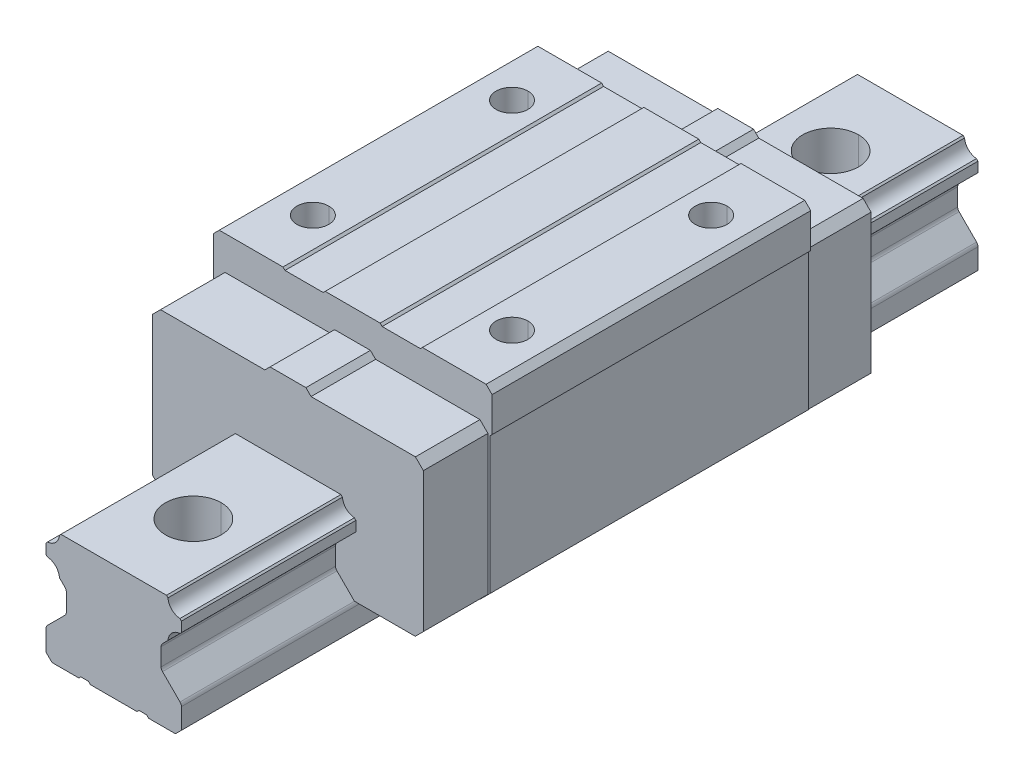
ISO-10303-21;
HEADER;
FILE_DESCRIPTION(('STEP AP214'),'2;1');
FILE_NAME('part.step','',(''),(''),'','','');
FILE_SCHEMA(('AUTOMOTIVE_DESIGN { 1 0 10303 214 1 1 1 1 }'));
ENDSEC;
DATA;
#1=APPLICATION_CONTEXT('core data for automotive mechanical design processes');
#2=APPLICATION_PROTOCOL_DEFINITION('international standard','automotive_design',2000,#1);
#3=PRODUCT_CONTEXT('',#1,'mechanical');
#4=PRODUCT('Part','Part','',(#3));
#5=PRODUCT_RELATED_PRODUCT_CATEGORY('part','',(#4));
#6=PRODUCT_DEFINITION_FORMATION('','',#4);
#7=PRODUCT_DEFINITION_CONTEXT('part definition',#1,'design');
#8=PRODUCT_DEFINITION('design','',#6,#7);
#9=PRODUCT_DEFINITION_SHAPE('','',#8);
#10=(LENGTH_UNIT() NAMED_UNIT(*) SI_UNIT(.MILLI.,.METRE.));
#11=(NAMED_UNIT(*) PLANE_ANGLE_UNIT() SI_UNIT($,.RADIAN.));
#12=(NAMED_UNIT(*) SI_UNIT($,.STERADIAN.) SOLID_ANGLE_UNIT());
#13=UNCERTAINTY_MEASURE_WITH_UNIT(LENGTH_MEASURE(1.E-05),#10,'distance_accuracy_value','');
#14=(GEOMETRIC_REPRESENTATION_CONTEXT(3) GLOBAL_UNCERTAINTY_ASSIGNED_CONTEXT((#13)) GLOBAL_UNIT_ASSIGNED_CONTEXT((#10,
#11,#12)) REPRESENTATION_CONTEXT('',''));
#15=CARTESIAN_POINT('',(0.,0.,0.));
#16=DIRECTION('',(0.,0.,1.));
#17=DIRECTION('',(1.,0.,0.));
#18=AXIS2_PLACEMENT_3D('',#15,#16,#17);
#19=CARTESIAN_POINT('',(0.,0.,-80.));
#20=DIRECTION('',(0.,1.,0.));
#21=DIRECTION('',(0.,0.,1.));
#22=AXIS2_PLACEMENT_3D('',#19,#20,#21);
#23=CYLINDRICAL_SURFACE('',#22,7.);
#24=CARTESIAN_POINT('',(0.,-12.,-80.));
#25=DIRECTION('',(0.,1.,0.));
#26=DIRECTION('',(0.,0.,1.));
#27=AXIS2_PLACEMENT_3D('',#24,#25,#26);
#28=CIRCLE('',#27,7.);
#29=CARTESIAN_POINT('',(0.,-12.,-87.));
#30=VERTEX_POINT('',#29);
#31=CARTESIAN_POINT('',(0.,-12.,-73.));
#32=VERTEX_POINT('',#31);
#33=EDGE_CURVE('P0_E476',#30,#32,#28,.T.);
#34=ORIENTED_EDGE('',*,*,#33,.F.);
#35=DIRECTION('',(0.,1.,0.));
#36=VECTOR('',#35,1.);
#37=CARTESIAN_POINT('',(0.,0.,-87.));
#38=LINE('',#37,#36);
#39=CARTESIAN_POINT('',(0.,0.,-87.));
#40=VERTEX_POINT('',#39);
#41=EDGE_CURVE('P0_E335',#30,#40,#38,.T.);
#42=ORIENTED_EDGE('',*,*,#41,.T.);
#43=CARTESIAN_POINT('',(0.,0.,-80.));
#44=DIRECTION('',(0.,-1.,0.));
#45=DIRECTION('',(0.,0.,1.));
#46=AXIS2_PLACEMENT_3D('',#43,#44,#45);
#47=CIRCLE('',#46,7.);
#48=CARTESIAN_POINT('',(0.,0.,-73.));
#49=VERTEX_POINT('',#48);
#50=EDGE_CURVE('P0_E10',#49,#40,#47,.T.);
#51=ORIENTED_EDGE('',*,*,#50,.F.);
#52=DIRECTION('',(0.,1.,0.));
#53=VECTOR('',#52,1.);
#54=CARTESIAN_POINT('',(0.,0.,-73.));
#55=LINE('',#54,#53);
#56=EDGE_CURVE('P0_E357',#32,#49,#55,.T.);
#57=ORIENTED_EDGE('',*,*,#56,.F.);
#58=EDGE_LOOP('',(#34,#42,#51,#57));
#59=FACE_BOUND('',#58,.T.);
#60=ADVANCED_FACE('P0_F16',(#59),#23,.F.);
#61=CARTESIAN_POINT('',(0.,0.,0.));
#62=DIRECTION('',(0.,1.,0.));
#63=DIRECTION('',(0.,0.,1.));
#64=AXIS2_PLACEMENT_3D('',#61,#62,#63);
#65=CYLINDRICAL_SURFACE('',#64,7.);
#66=CARTESIAN_POINT('',(0.,-12.,0.));
#67=DIRECTION('',(0.,1.,0.));
#68=DIRECTION('',(0.,0.,1.));
#69=AXIS2_PLACEMENT_3D('',#66,#67,#68);
#70=CIRCLE('',#69,7.);
#71=CARTESIAN_POINT('',(0.,-12.,-7.));
#72=VERTEX_POINT('',#71);
#73=CARTESIAN_POINT('',(0.,-12.,7.));
#74=VERTEX_POINT('',#73);
#75=EDGE_CURVE('P0_E339',#72,#74,#70,.T.);
#76=ORIENTED_EDGE('',*,*,#75,.F.);
#77=DIRECTION('',(0.,1.,0.));
#78=VECTOR('',#77,1.);
#79=CARTESIAN_POINT('',(0.,0.,-7.));
#80=LINE('',#79,#78);
#81=CARTESIAN_POINT('',(0.,0.,-7.));
#82=VERTEX_POINT('',#81);
#83=EDGE_CURVE('P0_E331',#72,#82,#80,.T.);
#84=ORIENTED_EDGE('',*,*,#83,.T.);
#85=CARTESIAN_POINT('',(0.,0.,0.));
#86=DIRECTION('',(0.,-1.,0.));
#87=DIRECTION('',(0.,0.,1.));
#88=AXIS2_PLACEMENT_3D('',#85,#86,#87);
#89=CIRCLE('',#88,7.);
#90=CARTESIAN_POINT('',(0.,0.,7.));
#91=VERTEX_POINT('',#90);
#92=EDGE_CURVE('P0_E24',#91,#82,#89,.T.);
#93=ORIENTED_EDGE('',*,*,#92,.F.);
#94=DIRECTION('',(0.,1.,0.));
#95=VECTOR('',#94,1.);
#96=CARTESIAN_POINT('',(0.,0.,7.));
#97=LINE('',#96,#95);
#98=EDGE_CURVE('P0_E333',#74,#91,#97,.T.);
#99=ORIENTED_EDGE('',*,*,#98,.F.);
#100=EDGE_LOOP('',(#76,#84,#93,#99));
#101=FACE_BOUND('',#100,.T.);
#102=ADVANCED_FACE('P0_F337',(#101),#65,.F.);
#103=CARTESIAN_POINT('',(0.,0.,80.));
#104=DIRECTION('',(0.,1.,0.));
#105=DIRECTION('',(0.,0.,1.));
#106=AXIS2_PLACEMENT_3D('',#103,#104,#105);
#107=CYLINDRICAL_SURFACE('',#106,7.);
#108=CARTESIAN_POINT('',(0.,-12.,80.));
#109=DIRECTION('',(0.,1.,0.));
#110=DIRECTION('',(0.,0.,1.));
#111=AXIS2_PLACEMENT_3D('',#108,#109,#110);
#112=CIRCLE('',#111,7.);
#113=CARTESIAN_POINT('',(0.,-12.,73.));
#114=VERTEX_POINT('',#113);
#115=CARTESIAN_POINT('',(0.,-12.,87.));
#116=VERTEX_POINT('',#115);
#117=EDGE_CURVE('P0_E379',#114,#116,#112,.T.);
#118=ORIENTED_EDGE('',*,*,#117,.F.);
#119=DIRECTION('',(0.,1.,0.));
#120=VECTOR('',#119,1.);
#121=CARTESIAN_POINT('',(0.,0.,73.));
#122=LINE('',#121,#120);
#123=CARTESIAN_POINT('',(0.,0.,73.));
#124=VERTEX_POINT('',#123);
#125=EDGE_CURVE('P0_E375',#114,#124,#122,.T.);
#126=ORIENTED_EDGE('',*,*,#125,.T.);
#127=CARTESIAN_POINT('',(0.,0.,80.));
#128=DIRECTION('',(0.,-1.,0.));
#129=DIRECTION('',(0.,0.,1.));
#130=AXIS2_PLACEMENT_3D('',#127,#128,#129);
#131=CIRCLE('',#130,7.);
#132=CARTESIAN_POINT('',(0.,0.,87.));
#133=VERTEX_POINT('',#132);
#134=EDGE_CURVE('P0_E326',#133,#124,#131,.T.);
#135=ORIENTED_EDGE('',*,*,#134,.F.);
#136=DIRECTION('',(0.,1.,0.));
#137=VECTOR('',#136,1.);
#138=CARTESIAN_POINT('',(0.,0.,87.));
#139=LINE('',#138,#137);
#140=EDGE_CURVE('P0_E351',#116,#133,#139,.T.);
#141=ORIENTED_EDGE('',*,*,#140,.F.);
#142=EDGE_LOOP('',(#118,#126,#135,#141));
#143=FACE_BOUND('',#142,.T.);
#144=ADVANCED_FACE('P0_F377',(#143),#107,.F.);
#145=CARTESIAN_POINT('',(0.,0.,-80.));
#146=DIRECTION('',(0.,1.,0.));
#147=DIRECTION('',(0.,0.,1.));
#148=AXIS2_PLACEMENT_3D('',#145,#146,#147);
#149=CYLINDRICAL_SURFACE('',#148,4.5);
#150=CARTESIAN_POINT('',(0.,-29.,-80.));
#151=DIRECTION('',(0.,1.,0.));
#152=DIRECTION('',(0.,0.,1.));
#153=AXIS2_PLACEMENT_3D('',#150,#151,#152);
#154=CIRCLE('',#153,4.5);
#155=CARTESIAN_POINT('',(0.,-29.,-84.5));
#156=VERTEX_POINT('',#155);
#157=CARTESIAN_POINT('',(0.,-29.,-75.5));
#158=VERTEX_POINT('',#157);
#159=EDGE_CURVE('P0_E461',#156,#158,#154,.T.);
#160=ORIENTED_EDGE('',*,*,#159,.F.);
#161=DIRECTION('',(0.,1.,0.));
#162=VECTOR('',#161,1.);
#163=CARTESIAN_POINT('',(0.,0.,-84.5));
#164=LINE('',#163,#162);
#165=CARTESIAN_POINT('',(0.,-12.,-84.5));
#166=VERTEX_POINT('',#165);
#167=EDGE_CURVE('P0_E582',#156,#166,#164,.T.);
#168=ORIENTED_EDGE('',*,*,#167,.T.);
#169=CARTESIAN_POINT('',(0.,-12.,-80.));
#170=DIRECTION('',(0.,-1.,0.));
#171=DIRECTION('',(0.,0.,1.));
#172=AXIS2_PLACEMENT_3D('',#169,#170,#171);
#173=CIRCLE('',#172,4.5);
#174=CARTESIAN_POINT('',(0.,-12.,-75.5));
#175=VERTEX_POINT('',#174);
#176=EDGE_CURVE('P0_E480',#175,#166,#173,.T.);
#177=ORIENTED_EDGE('',*,*,#176,.F.);
#178=DIRECTION('',(0.,1.,0.));
#179=VECTOR('',#178,1.);
#180=CARTESIAN_POINT('',(0.,0.,-75.5));
#181=LINE('',#180,#179);
#182=EDGE_CURVE('P0_E577',#158,#175,#181,.T.);
#183=ORIENTED_EDGE('',*,*,#182,.F.);
#184=EDGE_LOOP('',(#160,#168,#177,#183));
#185=FACE_BOUND('',#184,.T.);
#186=ADVANCED_FACE('P0_F1524',(#185),#149,.F.);
#187=CARTESIAN_POINT('',(0.,0.,0.));
#188=DIRECTION('',(0.,1.,0.));
#189=DIRECTION('',(0.,0.,1.));
#190=AXIS2_PLACEMENT_3D('',#187,#188,#189);
#191=CYLINDRICAL_SURFACE('',#190,4.5);
#192=CARTESIAN_POINT('',(0.,-29.,0.));
#193=DIRECTION('',(0.,1.,0.));
#194=DIRECTION('',(0.,0.,1.));
#195=AXIS2_PLACEMENT_3D('',#192,#193,#194);
#196=CIRCLE('',#195,4.5);
#197=CARTESIAN_POINT('',(0.,-29.,-4.5));
#198=VERTEX_POINT('',#197);
#199=CARTESIAN_POINT('',(0.,-29.,4.5));
#200=VERTEX_POINT('',#199);
#201=EDGE_CURVE('P0_E469',#198,#200,#196,.T.);
#202=ORIENTED_EDGE('',*,*,#201,.F.);
#203=DIRECTION('',(0.,1.,0.));
#204=VECTOR('',#203,1.);
#205=CARTESIAN_POINT('',(0.,0.,-4.5));
#206=LINE('',#205,#204);
#207=CARTESIAN_POINT('',(0.,-12.,-4.5));
#208=VERTEX_POINT('',#207);
#209=EDGE_CURVE('P0_E601',#198,#208,#206,.T.);
#210=ORIENTED_EDGE('',*,*,#209,.T.);
#211=CARTESIAN_POINT('',(0.,-12.,0.));
#212=DIRECTION('',(0.,-1.,0.));
#213=DIRECTION('',(0.,0.,1.));
#214=AXIS2_PLACEMENT_3D('',#211,#212,#213);
#215=CIRCLE('',#214,4.5);
#216=CARTESIAN_POINT('',(0.,-12.,4.5));
#217=VERTEX_POINT('',#216);
#218=EDGE_CURVE('P0_E412',#217,#208,#215,.T.);
#219=ORIENTED_EDGE('',*,*,#218,.F.);
#220=DIRECTION('',(0.,1.,0.));
#221=VECTOR('',#220,1.);
#222=CARTESIAN_POINT('',(0.,0.,4.5));
#223=LINE('',#222,#221);
#224=EDGE_CURVE('P0_E593',#200,#217,#223,.T.);
#225=ORIENTED_EDGE('',*,*,#224,.F.);
#226=EDGE_LOOP('',(#202,#210,#219,#225));
#227=FACE_BOUND('',#226,.T.);
#228=ADVANCED_FACE('P0_F1528',(#227),#191,.F.);
#229=CARTESIAN_POINT('',(0.,0.,80.));
#230=DIRECTION('',(0.,1.,0.));
#231=DIRECTION('',(0.,0.,1.));
#232=AXIS2_PLACEMENT_3D('',#229,#230,#231);
#233=CYLINDRICAL_SURFACE('',#232,4.5);
#234=CARTESIAN_POINT('',(0.,-29.,80.));
#235=DIRECTION('',(0.,1.,0.));
#236=DIRECTION('',(0.,0.,1.));
#237=AXIS2_PLACEMENT_3D('',#234,#235,#236);
#238=CIRCLE('',#237,4.5);
#239=CARTESIAN_POINT('',(0.,-29.,75.5));
#240=VERTEX_POINT('',#239);
#241=CARTESIAN_POINT('',(0.,-29.,84.5));
#242=VERTEX_POINT('',#241);
#243=EDGE_CURVE('P0_E466',#240,#242,#238,.T.);
#244=ORIENTED_EDGE('',*,*,#243,.F.);
#245=DIRECTION('',(0.,1.,0.));
#246=VECTOR('',#245,1.);
#247=CARTESIAN_POINT('',(0.,0.,75.5));
#248=LINE('',#247,#246);
#249=CARTESIAN_POINT('',(0.,-12.,75.5));
#250=VERTEX_POINT('',#249);
#251=EDGE_CURVE('P0_E616',#240,#250,#248,.T.);
#252=ORIENTED_EDGE('',*,*,#251,.T.);
#253=CARTESIAN_POINT('',(0.,-12.,80.));
#254=DIRECTION('',(0.,-1.,0.));
#255=DIRECTION('',(0.,0.,1.));
#256=AXIS2_PLACEMENT_3D('',#253,#254,#255);
#257=CIRCLE('',#256,4.5);
#258=CARTESIAN_POINT('',(0.,-12.,84.5));
#259=VERTEX_POINT('',#258);
#260=EDGE_CURVE('P0_E438',#259,#250,#257,.T.);
#261=ORIENTED_EDGE('',*,*,#260,.F.);
#262=DIRECTION('',(0.,1.,0.));
#263=VECTOR('',#262,1.);
#264=CARTESIAN_POINT('',(0.,0.,84.5));
#265=LINE('',#264,#263);
#266=EDGE_CURVE('P0_E615',#242,#259,#265,.T.);
#267=ORIENTED_EDGE('',*,*,#266,.F.);
#268=EDGE_LOOP('',(#244,#252,#261,#267));
#269=FACE_BOUND('',#268,.T.);
#270=ADVANCED_FACE('P0_F1536',(#269),#233,.F.);
#271=CARTESIAN_POINT('',(13.25142135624,0.,-100.));
#272=DIRECTION('',(0.,1.,0.));
#273=DIRECTION('',(1.,0.,0.));
#274=AXIS2_PLACEMENT_3D('',#271,#272,#273);
#275=PLANE('',#274);
#276=ORIENTED_EDGE('',*,*,#50,.T.);
#277=CARTESIAN_POINT('',(0.,0.,-80.));
#278=DIRECTION('',(0.,-1.,0.));
#279=DIRECTION('',(0.,0.,1.));
#280=AXIS2_PLACEMENT_3D('',#277,#278,#279);
#281=CIRCLE('',#280,7.);
#282=EDGE_CURVE('P0_E361',#40,#49,#281,.T.);
#283=ORIENTED_EDGE('',*,*,#282,.T.);
#284=EDGE_LOOP('',(#276,#283));
#285=FACE_BOUND('',#284,.T.);
#286=ORIENTED_EDGE('',*,*,#92,.T.);
#287=CARTESIAN_POINT('',(0.,0.,0.));
#288=DIRECTION('',(0.,-1.,0.));
#289=DIRECTION('',(0.,0.,1.));
#290=AXIS2_PLACEMENT_3D('',#287,#288,#289);
#291=CIRCLE('',#290,7.);
#292=EDGE_CURVE('P0_E321',#82,#91,#291,.T.);
#293=ORIENTED_EDGE('',*,*,#292,.T.);
#294=EDGE_LOOP('',(#286,#293));
#295=FACE_BOUND('',#294,.T.);
#296=ORIENTED_EDGE('',*,*,#134,.T.);
#297=CARTESIAN_POINT('',(0.,0.,80.));
#298=DIRECTION('',(0.,-1.,0.));
#299=DIRECTION('',(0.,0.,1.));
#300=AXIS2_PLACEMENT_3D('',#297,#298,#299);
#301=CIRCLE('',#300,7.);
#302=EDGE_CURVE('P0_E342',#124,#133,#301,.T.);
#303=ORIENTED_EDGE('',*,*,#302,.T.);
#304=EDGE_LOOP('',(#296,#303));
#305=FACE_BOUND('',#304,.T.);
#306=DIRECTION('',(0.,0.,-1.));
#307=VECTOR('',#306,1.);
#308=CARTESIAN_POINT('',(13.2514213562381,0.,-100.));
#309=LINE('',#308,#307);
#310=CARTESIAN_POINT('',(13.2514213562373,-1.07327883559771E-12,100.));
#311=VERTEX_POINT('',#310);
#312=CARTESIAN_POINT('',(13.251421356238,0.,-100.));
#313=VERTEX_POINT('',#312);
#314=EDGE_CURVE('P0_E388',#311,#313,#309,.T.);
#315=ORIENTED_EDGE('',*,*,#314,.T.);
#316=DIRECTION('',(-1.,0.,0.));
#317=VECTOR('',#316,1.);
#318=CARTESIAN_POINT('',(13.25142135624,0.,-100.));
#319=LINE('',#318,#317);
#320=CARTESIAN_POINT('',(-13.25142135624,0.,-100.));
#321=VERTEX_POINT('',#320);
#322=EDGE_CURVE('P0_E382',#313,#321,#319,.T.);
#323=ORIENTED_EDGE('',*,*,#322,.T.);
#324=DIRECTION('',(0.,0.,1.));
#325=VECTOR('',#324,1.);
#326=CARTESIAN_POINT('',(-13.25142135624,0.,-100.));
#327=LINE('',#326,#325);
#328=CARTESIAN_POINT('',(-13.2514213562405,-2.36717474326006E-13,100.));
#329=VERTEX_POINT('',#328);
#330=EDGE_CURVE('P0_E411',#321,#329,#327,.T.);
#331=ORIENTED_EDGE('',*,*,#330,.T.);
#332=DIRECTION('',(1.,0.,0.));
#333=VECTOR('',#332,1.);
#334=CARTESIAN_POINT('',(13.25142135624,0.,100.));
#335=LINE('',#334,#333);
#336=EDGE_CURVE('P0_E398',#329,#311,#335,.T.);
#337=ORIENTED_EDGE('',*,*,#336,.T.);
#338=EDGE_LOOP('',(#315,#323,#331,#337));
#339=FACE_BOUND('',#338,.T.);
#340=ADVANCED_FACE('P0_F319',(#285,#295,#305,#339),#275,.T.);
#341=CARTESIAN_POINT('',(0.,0.,-80.));
#342=DIRECTION('',(0.,1.,0.));
#343=DIRECTION('',(0.,0.,1.));
#344=AXIS2_PLACEMENT_3D('',#341,#342,#343);
#345=CYLINDRICAL_SURFACE('',#344,7.);
#346=ORIENTED_EDGE('',*,*,#41,.F.);
#347=CARTESIAN_POINT('',(0.,-12.,-80.));
#348=DIRECTION('',(0.,1.,0.));
#349=DIRECTION('',(0.,0.,1.));
#350=AXIS2_PLACEMENT_3D('',#347,#348,#349);
#351=CIRCLE('',#350,7.);
#352=EDGE_CURVE('P0_E416',#32,#30,#351,.T.);
#353=ORIENTED_EDGE('',*,*,#352,.F.);
#354=ORIENTED_EDGE('',*,*,#56,.T.);
#355=ORIENTED_EDGE('',*,*,#282,.F.);
#356=EDGE_LOOP('',(#346,#353,#354,#355));
#357=FACE_BOUND('',#356,.T.);
#358=ADVANCED_FACE('P0_F1551',(#357),#345,.F.);
#359=CARTESIAN_POINT('',(0.,0.,0.));
#360=DIRECTION('',(0.,1.,0.));
#361=DIRECTION('',(0.,0.,1.));
#362=AXIS2_PLACEMENT_3D('',#359,#360,#361);
#363=CYLINDRICAL_SURFACE('',#362,7.);
#364=ORIENTED_EDGE('',*,*,#83,.F.);
#365=CARTESIAN_POINT('',(0.,-12.,0.));
#366=DIRECTION('',(0.,1.,0.));
#367=DIRECTION('',(0.,0.,1.));
#368=AXIS2_PLACEMENT_3D('',#365,#366,#367);
#369=CIRCLE('',#368,7.);
#370=EDGE_CURVE('P0_E419',#74,#72,#369,.T.);
#371=ORIENTED_EDGE('',*,*,#370,.F.);
#372=ORIENTED_EDGE('',*,*,#98,.T.);
#373=ORIENTED_EDGE('',*,*,#292,.F.);
#374=EDGE_LOOP('',(#364,#371,#372,#373));
#375=FACE_BOUND('',#374,.T.);
#376=ADVANCED_FACE('P0_F329',(#375),#363,.F.);
#377=CARTESIAN_POINT('',(0.,0.,80.));
#378=DIRECTION('',(0.,1.,0.));
#379=DIRECTION('',(0.,0.,1.));
#380=AXIS2_PLACEMENT_3D('',#377,#378,#379);
#381=CYLINDRICAL_SURFACE('',#380,7.);
#382=ORIENTED_EDGE('',*,*,#125,.F.);
#383=CARTESIAN_POINT('',(0.,-12.,80.));
#384=DIRECTION('',(0.,1.,0.));
#385=DIRECTION('',(0.,0.,1.));
#386=AXIS2_PLACEMENT_3D('',#383,#384,#385);
#387=CIRCLE('',#386,7.);
#388=EDGE_CURVE('P0_E602',#116,#114,#387,.T.);
#389=ORIENTED_EDGE('',*,*,#388,.F.);
#390=ORIENTED_EDGE('',*,*,#140,.T.);
#391=ORIENTED_EDGE('',*,*,#302,.F.);
#392=EDGE_LOOP('',(#382,#389,#390,#391));
#393=FACE_BOUND('',#392,.T.);
#394=ADVANCED_FACE('P0_F373',(#393),#381,.F.);
#395=CARTESIAN_POINT('',(0.,0.,-100.));
#396=DIRECTION('',(0.,0.,1.));
#397=DIRECTION('',(1.,0.,0.));
#398=AXIS2_PLACEMENT_3D('',#395,#396,#397);
#399=PLANE('',#398);
#400=DIRECTION('',(0.70710678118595,0.707106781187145,0.));
#401=VECTOR('',#400,1.);
#402=CARTESIAN_POINT('',(12.2514718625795,-11.0099494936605,-100.));
#403=LINE('',#402,#401);
#404=CARTESIAN_POINT('',(12.2514718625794,-11.0099494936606,-100.));
#405=VERTEX_POINT('',#404);
#406=CARTESIAN_POINT('',(13.6259433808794,-9.63547797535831,-100.));
#407=VERTEX_POINT('',#406);
#408=EDGE_CURVE('P0_E429',#405,#407,#403,.T.);
#409=ORIENTED_EDGE('',*,*,#408,.F.);
#410=CARTESIAN_POINT('',(13.1,-11.85847763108,-100.));
#411=DIRECTION('',(0.,0.,1.));
#412=DIRECTION('',(1.,0.,0.));
#413=AXIS2_PLACEMENT_3D('',#410,#411,#412);
#414=CIRCLE('',#413,1.2);
#415=CARTESIAN_POINT('',(11.8999999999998,-11.8584776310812,-100.));
#416=VERTEX_POINT('',#415);
#417=EDGE_CURVE('P0_E657',#405,#416,#414,.T.);
#418=ORIENTED_EDGE('',*,*,#417,.T.);
#419=DIRECTION('',(0.,1.,0.));
#420=VECTOR('',#419,1.);
#421=CARTESIAN_POINT('',(11.9,0.,-100.));
#422=LINE('',#421,#420);
#423=CARTESIAN_POINT('',(11.9,-16.26154209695,-100.));
#424=VERTEX_POINT('',#423);
#425=EDGE_CURVE('P0_E430',#424,#416,#422,.T.);
#426=ORIENTED_EDGE('',*,*,#425,.F.);
#427=CARTESIAN_POINT('',(13.1,-16.26154209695,-100.));
#428=DIRECTION('',(0.,0.,1.));
#429=DIRECTION('',(1.,0.,0.));
#430=AXIS2_PLACEMENT_3D('',#427,#428,#429);
#431=CIRCLE('',#430,1.2);
#432=CARTESIAN_POINT('',(12.2514718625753,-17.110070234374,-100.));
#433=VERTEX_POINT('',#432);
#434=EDGE_CURVE('P0_E679',#424,#433,#431,.T.);
#435=ORIENTED_EDGE('',*,*,#434,.T.);
#436=DIRECTION('',(-0.707106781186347,0.707106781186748,0.));
#437=VECTOR('',#436,1.);
#438=CARTESIAN_POINT('',(16.6485281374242,-21.5071265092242,-100.));
#439=LINE('',#438,#437);
#440=CARTESIAN_POINT('',(16.6485281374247,-21.5071265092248,-100.));
#441=VERTEX_POINT('',#440);
#442=EDGE_CURVE('P0_E465',#441,#433,#439,.T.);
#443=ORIENTED_EDGE('',*,*,#442,.F.);
#444=CARTESIAN_POINT('',(15.8,-22.35565464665,-100.));
#445=DIRECTION('',(0.,0.,1.));
#446=DIRECTION('',(1.,0.,0.));
#447=AXIS2_PLACEMENT_3D('',#444,#445,#446);
#448=CIRCLE('',#447,1.2);
#449=CARTESIAN_POINT('',(17.,-22.35565464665,-100.));
#450=VERTEX_POINT('',#449);
#451=EDGE_CURVE('P0_E684',#450,#441,#448,.T.);
#452=ORIENTED_EDGE('',*,*,#451,.F.);
#453=DIRECTION('',(0.,1.,0.));
#454=VECTOR('',#453,1.);
#455=CARTESIAN_POINT('',(17.,0.,-100.));
#456=LINE('',#455,#454);
#457=CARTESIAN_POINT('',(17.,-27.5,-100.));
#458=VERTEX_POINT('',#457);
#459=EDGE_CURVE('P0_E443',#458,#450,#456,.T.);
#460=ORIENTED_EDGE('',*,*,#459,.F.);
#461=DIRECTION('',(0.707106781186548,0.707106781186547,0.));
#462=VECTOR('',#461,1.);
#463=CARTESIAN_POINT('',(15.5,-29.,-100.));
#464=LINE('',#463,#462);
#465=CARTESIAN_POINT('',(15.5,-29.,-100.));
#466=VERTEX_POINT('',#465);
#467=EDGE_CURVE('P0_E448',#466,#458,#464,.T.);
#468=ORIENTED_EDGE('',*,*,#467,.F.);
#469=DIRECTION('',(1.,0.,0.));
#470=VECTOR('',#469,1.);
#471=CARTESIAN_POINT('',(0.,-29.,-100.));
#472=LINE('',#471,#470);
#473=CARTESIAN_POINT('',(8.75,-29.,-100.));
#474=VERTEX_POINT('',#473);
#475=EDGE_CURVE('P0_E457',#474,#466,#472,.T.);
#476=ORIENTED_EDGE('',*,*,#475,.F.);
#477=DIRECTION('',(0.707106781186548,-0.707106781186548,0.));
#478=VECTOR('',#477,1.);
#479=CARTESIAN_POINT('',(8.25,-28.5,-100.));
#480=LINE('',#479,#478);
#481=CARTESIAN_POINT('',(8.25,-28.5,-100.));
#482=VERTEX_POINT('',#481);
#483=EDGE_CURVE('P0_E696',#482,#474,#480,.T.);
#484=ORIENTED_EDGE('',*,*,#483,.F.);
#485=DIRECTION('',(1.,0.,0.));
#486=VECTOR('',#485,1.);
#487=CARTESIAN_POINT('',(0.,-28.5,-100.));
#488=LINE('',#487,#486);
#489=CARTESIAN_POINT('',(6.35,-28.5,-100.));
#490=VERTEX_POINT('',#489);
#491=EDGE_CURVE('P0_E458',#490,#482,#488,.T.);
#492=ORIENTED_EDGE('',*,*,#491,.F.);
#493=DIRECTION('',(0.707106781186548,0.707106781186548,0.));
#494=VECTOR('',#493,1.);
#495=CARTESIAN_POINT('',(5.85,-29.,-100.));
#496=LINE('',#495,#494);
#497=CARTESIAN_POINT('',(5.85,-29.,-100.));
#498=VERTEX_POINT('',#497);
#499=EDGE_CURVE('P0_E713',#498,#490,#496,.T.);
#500=ORIENTED_EDGE('',*,*,#499,.F.);
#501=DIRECTION('',(1.,0.,0.));
#502=VECTOR('',#501,1.);
#503=CARTESIAN_POINT('',(0.,-29.,-100.));
#504=LINE('',#503,#502);
#505=CARTESIAN_POINT('',(-5.85,-29.,-100.));
#506=VERTEX_POINT('',#505);
#507=EDGE_CURVE('P0_E470',#506,#498,#504,.T.);
#508=ORIENTED_EDGE('',*,*,#507,.F.);
#509=DIRECTION('',(0.707106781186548,-0.707106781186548,0.));
#510=VECTOR('',#509,1.);
#511=CARTESIAN_POINT('',(-6.35,-28.5,-100.));
#512=LINE('',#511,#510);
#513=CARTESIAN_POINT('',(-6.35,-28.5,-100.));
#514=VERTEX_POINT('',#513);
#515=EDGE_CURVE('P0_E735',#514,#506,#512,.T.);
#516=ORIENTED_EDGE('',*,*,#515,.F.);
#517=DIRECTION('',(1.,0.,0.));
#518=VECTOR('',#517,1.);
#519=CARTESIAN_POINT('',(0.,-28.5,-100.));
#520=LINE('',#519,#518);
#521=CARTESIAN_POINT('',(-8.25,-28.5,-100.));
#522=VERTEX_POINT('',#521);
#523=EDGE_CURVE('P0_E503',#522,#514,#520,.T.);
#524=ORIENTED_EDGE('',*,*,#523,.F.);
#525=DIRECTION('',(0.707106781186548,0.707106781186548,0.));
#526=VECTOR('',#525,1.);
#527=CARTESIAN_POINT('',(-8.75,-29.,-100.));
#528=LINE('',#527,#526);
#529=CARTESIAN_POINT('',(-8.75,-29.,-100.));
#530=VERTEX_POINT('',#529);
#531=EDGE_CURVE('P0_E750',#530,#522,#528,.T.);
#532=ORIENTED_EDGE('',*,*,#531,.F.);
#533=DIRECTION('',(1.,0.,0.));
#534=VECTOR('',#533,1.);
#535=CARTESIAN_POINT('',(0.,-29.,-100.));
#536=LINE('',#535,#534);
#537=CARTESIAN_POINT('',(-15.5,-29.,-100.));
#538=VERTEX_POINT('',#537);
#539=EDGE_CURVE('P0_E485',#538,#530,#536,.T.);
#540=ORIENTED_EDGE('',*,*,#539,.F.);
#541=DIRECTION('',(0.707106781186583,-0.707106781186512,0.));
#542=VECTOR('',#541,1.);
#543=CARTESIAN_POINT('',(-17.,-27.5,-100.));
#544=LINE('',#543,#542);
#545=CARTESIAN_POINT('',(-17.,-27.5,-100.));
#546=VERTEX_POINT('',#545);
#547=EDGE_CURVE('P0_E491',#546,#538,#544,.T.);
#548=ORIENTED_EDGE('',*,*,#547,.F.);
#549=DIRECTION('',(0.,-1.,0.));
#550=VECTOR('',#549,1.);
#551=CARTESIAN_POINT('',(-17.,0.,-100.));
#552=LINE('',#551,#550);
#553=CARTESIAN_POINT('',(-17.,-22.35565464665,-100.));
#554=VERTEX_POINT('',#553);
#555=EDGE_CURVE('P0_E496',#554,#546,#552,.T.);
#556=ORIENTED_EDGE('',*,*,#555,.F.);
#557=CARTESIAN_POINT('',(-15.8,-22.35565464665,-100.));
#558=DIRECTION('',(0.,0.,1.));
#559=DIRECTION('',(1.,0.,0.));
#560=AXIS2_PLACEMENT_3D('',#557,#558,#559);
#561=CIRCLE('',#560,1.2);
#562=CARTESIAN_POINT('',(-16.648528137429,-21.5071265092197,-100.));
#563=VERTEX_POINT('',#562);
#564=EDGE_CURVE('P0_E772',#563,#554,#561,.T.);
#565=ORIENTED_EDGE('',*,*,#564,.F.);
#566=DIRECTION('',(-0.707106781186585,-0.70710678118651,0.));
#567=VECTOR('',#566,1.);
#568=CARTESIAN_POINT('',(-12.25147186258,-17.1100702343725,-100.));
#569=LINE('',#568,#567);
#570=CARTESIAN_POINT('',(-12.25147186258,-17.1100702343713,-100.));
#571=VERTEX_POINT('',#570);
#572=EDGE_CURVE('P0_E508',#571,#563,#569,.T.);
#573=ORIENTED_EDGE('',*,*,#572,.F.);
#574=CARTESIAN_POINT('',(-13.1,-16.26154209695,-100.));
#575=DIRECTION('',(0.,0.,1.));
#576=DIRECTION('',(1.,0.,0.));
#577=AXIS2_PLACEMENT_3D('',#574,#575,#576);
#578=CIRCLE('',#577,1.2);
#579=CARTESIAN_POINT('',(-11.8999999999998,-16.26154209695,-100.));
#580=VERTEX_POINT('',#579);
#581=EDGE_CURVE('P0_E801',#571,#580,#578,.T.);
#582=ORIENTED_EDGE('',*,*,#581,.T.);
#583=DIRECTION('',(0.,-1.,0.));
#584=VECTOR('',#583,1.);
#585=CARTESIAN_POINT('',(-11.9,0.,-100.));
#586=LINE('',#585,#584);
#587=CARTESIAN_POINT('',(-11.9,-11.8584776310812,-100.));
#588=VERTEX_POINT('',#587);
#589=EDGE_CURVE('P0_E567',#588,#580,#586,.T.);
#590=ORIENTED_EDGE('',*,*,#589,.F.);
#591=CARTESIAN_POINT('',(-13.1,-11.85847763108,-100.));
#592=DIRECTION('',(0.,0.,1.));
#593=DIRECTION('',(1.,0.,0.));
#594=AXIS2_PLACEMENT_3D('',#591,#592,#593);
#595=CIRCLE('',#594,1.2);
#596=CARTESIAN_POINT('',(-12.2514718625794,-11.0099494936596,-100.));
#597=VERTEX_POINT('',#596);
#598=EDGE_CURVE('P0_E816',#588,#597,#595,.T.);
#599=ORIENTED_EDGE('',*,*,#598,.T.);
#600=DIRECTION('',(0.707106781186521,-0.707106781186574,0.));
#601=VECTOR('',#600,1.);
#602=CARTESIAN_POINT('',(-13.6259433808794,-9.63547797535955,-100.));
#603=LINE('',#602,#601);
#604=CARTESIAN_POINT('',(-13.6259433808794,-9.63547797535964,-100.));
#605=VERTEX_POINT('',#604);
#606=EDGE_CURVE('P0_E519',#605,#597,#603,.T.);
#607=ORIENTED_EDGE('',*,*,#606,.F.);
#608=CARTESIAN_POINT('',(-16.86757359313,-9.868573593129,-100.));
#609=DIRECTION('',(0.,0.,-1.));
#610=DIRECTION('',(1.,0.,0.));
#611=AXIS2_PLACEMENT_3D('',#608,#609,#610);
#612=CIRCLE('',#611,3.25);
#613=CARTESIAN_POINT('',(-16.6344779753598,-6.62694338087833,-100.));
#614=VERTEX_POINT('',#613);
#615=EDGE_CURVE('P0_E532',#614,#605,#612,.T.);
#616=ORIENTED_EDGE('',*,*,#615,.F.);
#617=DIRECTION('',(0.707106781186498,-0.707106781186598,0.));
#618=VECTOR('',#617,1.);
#619=CARTESIAN_POINT('',(-17.,-6.261421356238,-100.));
#620=LINE('',#619,#618);
#621=CARTESIAN_POINT('',(-17.,-6.26142135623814,-100.));
#622=VERTEX_POINT('',#621);
#623=EDGE_CURVE('P0_E834',#622,#614,#620,.T.);
#624=ORIENTED_EDGE('',*,*,#623,.F.);
#625=DIRECTION('',(0.,-1.,0.));
#626=VECTOR('',#625,1.);
#627=CARTESIAN_POINT('',(-16.9999999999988,0.,-100.));
#628=LINE('',#627,#626);
#629=CARTESIAN_POINT('',(-16.9999999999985,-3.74857864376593,-100.));
#630=VERTEX_POINT('',#629);
#631=EDGE_CURVE('P0_E542',#630,#622,#628,.T.);
#632=ORIENTED_EDGE('',*,*,#631,.F.);
#633=DIRECTION('',(-0.707106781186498,-0.707106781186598,0.));
#634=VECTOR('',#633,1.);
#635=CARTESIAN_POINT('',(-16.62260214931,-3.371180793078,-100.));
#636=LINE('',#635,#634);
#637=CARTESIAN_POINT('',(-16.6226021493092,-3.37118079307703,-100.));
#638=VERTEX_POINT('',#637);
#639=EDGE_CURVE('P0_E855',#638,#630,#636,.T.);
#640=ORIENTED_EDGE('',*,*,#639,.F.);
#641=CARTESIAN_POINT('',(-16.86757359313,-0.1304264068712,-100.));
#642=DIRECTION('',(0.,0.,-1.));
#643=DIRECTION('',(1.,0.,0.));
#644=AXIS2_PLACEMENT_3D('',#641,#642,#643);
#645=CIRCLE('',#644,3.25);
#646=CARTESIAN_POINT('',(-13.6268192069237,-0.375397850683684,-100.));
#647=VERTEX_POINT('',#646);
#648=EDGE_CURVE('P0_E551',#647,#638,#645,.T.);
#649=ORIENTED_EDGE('',*,*,#648,.F.);
#650=DIRECTION('',(-0.707106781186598,-0.707106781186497,0.));
#651=VECTOR('',#650,1.);
#652=CARTESIAN_POINT('',(-13.25142135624,0.,-100.));
#653=LINE('',#652,#651);
#654=EDGE_CURVE('P0_E408',#321,#647,#653,.T.);
#655=ORIENTED_EDGE('',*,*,#654,.F.);
#656=ORIENTED_EDGE('',*,*,#322,.F.);
#657=DIRECTION('',(-0.70710678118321,0.707106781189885,0.));
#658=VECTOR('',#657,1.);
#659=CARTESIAN_POINT('',(13.6268192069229,-0.375397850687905,-100.));
#660=LINE('',#659,#658);
#661=CARTESIAN_POINT('',(13.6268192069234,-0.375397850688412,-100.));
#662=VERTEX_POINT('',#661);
#663=EDGE_CURVE('P0_E394',#662,#313,#660,.T.);
#664=ORIENTED_EDGE('',*,*,#663,.F.);
#665=CARTESIAN_POINT('',(16.86757359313,-0.1304264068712,-100.));
#666=DIRECTION('',(0.,0.,-1.));
#667=DIRECTION('',(1.,0.,0.));
#668=AXIS2_PLACEMENT_3D('',#665,#666,#667);
#669=CIRCLE('',#668,3.25);
#670=CARTESIAN_POINT('',(16.622602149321,-3.37118079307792,-100.));
#671=VERTEX_POINT('',#670);
#672=EDGE_CURVE('P0_E557',#671,#662,#669,.T.);
#673=ORIENTED_EDGE('',*,*,#672,.F.);
#674=DIRECTION('',(-0.707106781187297,0.707106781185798,0.));
#675=VECTOR('',#674,1.);
#676=CARTESIAN_POINT('',(17.,-3.748578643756,-100.));
#677=LINE('',#676,#675);
#678=CARTESIAN_POINT('',(17.,-3.74857864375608,-100.));
#679=VERTEX_POINT('',#678);
#680=EDGE_CURVE('P0_E876',#679,#671,#677,.T.);
#681=ORIENTED_EDGE('',*,*,#680,.F.);
#682=DIRECTION('',(0.,1.,0.));
#683=VECTOR('',#682,1.);
#684=CARTESIAN_POINT('',(17.0000000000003,0.,-100.));
#685=LINE('',#684,#683);
#686=CARTESIAN_POINT('',(17.0000000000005,-6.26142135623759,-100.));
#687=VERTEX_POINT('',#686);
#688=EDGE_CURVE('P0_E566',#687,#679,#685,.T.);
#689=ORIENTED_EDGE('',*,*,#688,.F.);
#690=DIRECTION('',(0.707106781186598,0.707106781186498,0.));
#691=VECTOR('',#690,1.);
#692=CARTESIAN_POINT('',(16.63447797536,-6.626943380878,-100.));
#693=LINE('',#692,#691);
#694=CARTESIAN_POINT('',(16.6344779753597,-6.62694338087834,-100.));
#695=VERTEX_POINT('',#694);
#696=EDGE_CURVE('P0_E633',#695,#687,#693,.T.);
#697=ORIENTED_EDGE('',*,*,#696,.F.);
#698=CARTESIAN_POINT('',(16.86757359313,-9.868573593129,-100.));
#699=DIRECTION('',(0.,0.,-1.));
#700=DIRECTION('',(1.,0.,0.));
#701=AXIS2_PLACEMENT_3D('',#698,#699,#700);
#702=CIRCLE('',#701,3.25);
#703=EDGE_CURVE('P0_E420',#407,#695,#702,.T.);
#704=ORIENTED_EDGE('',*,*,#703,.F.);
#705=EDGE_LOOP('',(#409,#418,#426,#435,#443,#452,#460,#468,#476,#484,#492,#500,#508,#516,#524,
#532,#540,#548,#556,#565,#573,#582,#590,#599,#607,#616,#624,#632,#640,#649,#655,#656,#664,#673,
#681,#689,#697,#704));
#706=FACE_BOUND('',#705,.T.);
#707=ADVANCED_FACE('P0_F983',(#706),#399,.F.);
#708=CARTESIAN_POINT('',(13.62681920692,-0.375397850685,-100.));
#709=DIRECTION('',(0.707106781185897,0.707106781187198,0.));
#710=DIRECTION('',(0.,0.,-1.));
#711=AXIS2_PLACEMENT_3D('',#708,#709,#710);
#712=PLANE('',#711);
#713=DIRECTION('',(0.,0.,-1.));
#714=VECTOR('',#713,1.);
#715=CARTESIAN_POINT('',(13.6268192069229,-0.375397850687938,-100.));
#716=LINE('',#715,#714);
#717=CARTESIAN_POINT('',(13.6268192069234,-0.375397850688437,100.));
#718=VERTEX_POINT('',#717);
#719=EDGE_CURVE('P0_E561',#718,#662,#716,.T.);
#720=ORIENTED_EDGE('',*,*,#719,.T.);
#721=ORIENTED_EDGE('',*,*,#663,.T.);
#722=ORIENTED_EDGE('',*,*,#314,.F.);
#723=DIRECTION('',(0.707106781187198,-0.707106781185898,0.));
#724=VECTOR('',#723,1.);
#725=CARTESIAN_POINT('',(13.62681920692,-0.375397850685,100.));
#726=LINE('',#725,#724);
#727=EDGE_CURVE('P0_E402',#311,#718,#726,.T.);
#728=ORIENTED_EDGE('',*,*,#727,.T.);
#729=EDGE_LOOP('',(#720,#721,#722,#728));
#730=FACE_BOUND('',#729,.T.);
#731=ADVANCED_FACE('P0_F1579',(#730),#712,.T.);
#732=CARTESIAN_POINT('',(0.,0.,100.));
#733=DIRECTION('',(0.,0.,1.));
#734=DIRECTION('',(1.,0.,0.));
#735=AXIS2_PLACEMENT_3D('',#732,#733,#734);
#736=PLANE('',#735);
#737=CARTESIAN_POINT('',(13.1,-11.85847763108,100.));
#738=DIRECTION('',(0.,0.,-1.));
#739=DIRECTION('',(1.,0.,0.));
#740=AXIS2_PLACEMENT_3D('',#737,#738,#739);
#741=CIRCLE('',#740,1.2);
#742=CARTESIAN_POINT('',(11.8999999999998,-11.8584776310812,100.));
#743=VERTEX_POINT('',#742);
#744=CARTESIAN_POINT('',(12.2514718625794,-11.0099494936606,100.));
#745=VERTEX_POINT('',#744);
#746=EDGE_CURVE('P0_E648',#743,#745,#741,.T.);
#747=ORIENTED_EDGE('',*,*,#746,.T.);
#748=DIRECTION('',(0.70710678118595,0.707106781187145,0.));
#749=VECTOR('',#748,1.);
#750=CARTESIAN_POINT('',(12.2514718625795,-11.0099494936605,100.));
#751=LINE('',#750,#749);
#752=CARTESIAN_POINT('',(13.6259433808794,-9.63547797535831,100.));
#753=VERTEX_POINT('',#752);
#754=EDGE_CURVE('P0_E424',#745,#753,#751,.T.);
#755=ORIENTED_EDGE('',*,*,#754,.T.);
#756=CARTESIAN_POINT('',(16.86757359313,-9.868573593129,100.));
#757=DIRECTION('',(0.,0.,-1.));
#758=DIRECTION('',(1.,0.,0.));
#759=AXIS2_PLACEMENT_3D('',#756,#757,#758);
#760=CIRCLE('',#759,3.25);
#761=CARTESIAN_POINT('',(16.6344779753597,-6.62694338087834,100.));
#762=VERTEX_POINT('',#761);
#763=EDGE_CURVE('P0_E423',#753,#762,#760,.T.);
#764=ORIENTED_EDGE('',*,*,#763,.T.);
#765=DIRECTION('',(-0.707106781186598,-0.707106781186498,0.));
#766=VECTOR('',#765,1.);
#767=CARTESIAN_POINT('',(16.63447797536,-6.626943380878,100.));
#768=LINE('',#767,#766);
#769=CARTESIAN_POINT('',(17.0000000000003,-6.26142135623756,100.));
#770=VERTEX_POINT('',#769);
#771=EDGE_CURVE('P0_E623',#770,#762,#768,.T.);
#772=ORIENTED_EDGE('',*,*,#771,.F.);
#773=DIRECTION('',(0.,1.,0.));
#774=VECTOR('',#773,1.);
#775=CARTESIAN_POINT('',(17.0000000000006,0.,100.));
#776=LINE('',#775,#774);
#777=CARTESIAN_POINT('',(17.,-3.74857864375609,100.));
#778=VERTEX_POINT('',#777);
#779=EDGE_CURVE('P0_E562',#770,#778,#776,.T.);
#780=ORIENTED_EDGE('',*,*,#779,.T.);
#781=DIRECTION('',(0.707106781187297,-0.707106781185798,0.));
#782=VECTOR('',#781,1.);
#783=CARTESIAN_POINT('',(17.,-3.748578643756,100.));
#784=LINE('',#783,#782);
#785=CARTESIAN_POINT('',(16.622602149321,-3.37118079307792,100.));
#786=VERTEX_POINT('',#785);
#787=EDGE_CURVE('P0_E860',#786,#778,#784,.T.);
#788=ORIENTED_EDGE('',*,*,#787,.F.);
#789=CARTESIAN_POINT('',(16.86757359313,-0.1304264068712,100.));
#790=DIRECTION('',(0.,0.,-1.));
#791=DIRECTION('',(1.,0.,0.));
#792=AXIS2_PLACEMENT_3D('',#789,#790,#791);
#793=CIRCLE('',#792,3.25);
#794=EDGE_CURVE('P0_E641',#786,#718,#793,.T.);
#795=ORIENTED_EDGE('',*,*,#794,.T.);
#796=ORIENTED_EDGE('',*,*,#727,.F.);
#797=ORIENTED_EDGE('',*,*,#336,.F.);
#798=DIRECTION('',(-0.707106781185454,-0.707106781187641,0.));
#799=VECTOR('',#798,1.);
#800=CARTESIAN_POINT('',(-13.2514213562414,-1.42170753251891E-12,100.));
#801=LINE('',#800,#799);
#802=CARTESIAN_POINT('',(-13.6268192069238,-0.375397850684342,100.));
#803=VERTEX_POINT('',#802);
#804=EDGE_CURVE('P0_E405',#329,#803,#801,.T.);
#805=ORIENTED_EDGE('',*,*,#804,.T.);
#806=CARTESIAN_POINT('',(-16.86757359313,-0.1304264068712,100.));
#807=DIRECTION('',(0.,0.,-1.));
#808=DIRECTION('',(1.,0.,0.));
#809=AXIS2_PLACEMENT_3D('',#806,#807,#808);
#810=CIRCLE('',#809,3.25);
#811=CARTESIAN_POINT('',(-16.6226021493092,-3.37118079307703,100.));
#812=VERTEX_POINT('',#811);
#813=EDGE_CURVE('P0_E547',#803,#812,#810,.T.);
#814=ORIENTED_EDGE('',*,*,#813,.T.);
#815=DIRECTION('',(0.707106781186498,0.707106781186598,0.));
#816=VECTOR('',#815,1.);
#817=CARTESIAN_POINT('',(-16.62260214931,-3.371180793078,100.));
#818=LINE('',#817,#816);
#819=CARTESIAN_POINT('',(-16.9999999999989,-3.74857864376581,100.));
#820=VERTEX_POINT('',#819);
#821=EDGE_CURVE('P0_E841',#820,#812,#818,.T.);
#822=ORIENTED_EDGE('',*,*,#821,.F.);
#823=DIRECTION('',(0.,-1.,0.));
#824=VECTOR('',#823,1.);
#825=CARTESIAN_POINT('',(-16.9999999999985,0.,100.));
#826=LINE('',#825,#824);
#827=CARTESIAN_POINT('',(-16.9999999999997,-6.26142135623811,100.));
#828=VERTEX_POINT('',#827);
#829=EDGE_CURVE('P0_E538',#820,#828,#826,.T.);
#830=ORIENTED_EDGE('',*,*,#829,.T.);
#831=DIRECTION('',(-0.707106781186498,0.707106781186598,0.));
#832=VECTOR('',#831,1.);
#833=CARTESIAN_POINT('',(-17.,-6.261421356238,100.));
#834=LINE('',#833,#832);
#835=CARTESIAN_POINT('',(-16.6344779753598,-6.62694338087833,100.));
#836=VERTEX_POINT('',#835);
#837=EDGE_CURVE('P0_E821',#836,#828,#834,.T.);
#838=ORIENTED_EDGE('',*,*,#837,.F.);
#839=CARTESIAN_POINT('',(-16.86757359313,-9.868573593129,100.));
#840=DIRECTION('',(0.,0.,-1.));
#841=DIRECTION('',(1.,0.,0.));
#842=AXIS2_PLACEMENT_3D('',#839,#840,#841);
#843=CIRCLE('',#842,3.25);
#844=CARTESIAN_POINT('',(-13.6259433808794,-9.63547797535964,100.));
#845=VERTEX_POINT('',#844);
#846=EDGE_CURVE('P0_E524',#836,#845,#843,.T.);
#847=ORIENTED_EDGE('',*,*,#846,.T.);
#848=DIRECTION('',(0.707106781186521,-0.707106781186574,0.));
#849=VECTOR('',#848,1.);
#850=CARTESIAN_POINT('',(-13.6259433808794,-9.63547797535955,100.));
#851=LINE('',#850,#849);
#852=CARTESIAN_POINT('',(-12.2514718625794,-11.0099494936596,100.));
#853=VERTEX_POINT('',#852);
#854=EDGE_CURVE('P0_E523',#845,#853,#851,.T.);
#855=ORIENTED_EDGE('',*,*,#854,.T.);
#856=CARTESIAN_POINT('',(-13.1,-11.85847763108,100.));
#857=DIRECTION('',(0.,0.,-1.));
#858=DIRECTION('',(1.,7.28728420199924E-12,0.));
#859=AXIS2_PLACEMENT_3D('',#856,#857,#858);
#860=CIRCLE('',#859,1.2);
#861=CARTESIAN_POINT('',(-11.9,-11.8584776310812,100.));
#862=VERTEX_POINT('',#861);
#863=EDGE_CURVE('P0_E811',#853,#862,#860,.T.);
#864=ORIENTED_EDGE('',*,*,#863,.T.);
#865=DIRECTION('',(0.,-1.,0.));
#866=VECTOR('',#865,1.);
#867=CARTESIAN_POINT('',(-11.9,0.,100.));
#868=LINE('',#867,#866);
#869=CARTESIAN_POINT('',(-11.8999999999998,-16.26154209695,100.));
#870=VERTEX_POINT('',#869);
#871=EDGE_CURVE('P0_E512',#862,#870,#868,.T.);
#872=ORIENTED_EDGE('',*,*,#871,.T.);
#873=CARTESIAN_POINT('',(-13.1,-16.26154209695,100.));
#874=DIRECTION('',(0.,0.,-1.));
#875=DIRECTION('',(1.,0.,0.));
#876=AXIS2_PLACEMENT_3D('',#873,#874,#875);
#877=CIRCLE('',#876,1.2);
#878=CARTESIAN_POINT('',(-12.25147186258,-17.1100702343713,100.));
#879=VERTEX_POINT('',#878);
#880=EDGE_CURVE('P0_E787',#870,#879,#877,.T.);
#881=ORIENTED_EDGE('',*,*,#880,.T.);
#882=DIRECTION('',(-0.707106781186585,-0.70710678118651,0.));
#883=VECTOR('',#882,1.);
#884=CARTESIAN_POINT('',(-12.25147186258,-17.1100702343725,100.));
#885=LINE('',#884,#883);
#886=CARTESIAN_POINT('',(-16.648528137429,-21.5071265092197,100.));
#887=VERTEX_POINT('',#886);
#888=EDGE_CURVE('P0_E504',#879,#887,#885,.T.);
#889=ORIENTED_EDGE('',*,*,#888,.T.);
#890=CARTESIAN_POINT('',(-15.8,-22.35565464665,100.));
#891=DIRECTION('',(0.,0.,-1.));
#892=DIRECTION('',(1.,0.,0.));
#893=AXIS2_PLACEMENT_3D('',#890,#891,#892);
#894=CIRCLE('',#893,1.2);
#895=CARTESIAN_POINT('',(-17.,-22.35565464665,100.));
#896=VERTEX_POINT('',#895);
#897=EDGE_CURVE('P0_E761',#896,#887,#894,.T.);
#898=ORIENTED_EDGE('',*,*,#897,.F.);
#899=DIRECTION('',(0.,-1.,0.));
#900=VECTOR('',#899,1.);
#901=CARTESIAN_POINT('',(-17.,0.,100.));
#902=LINE('',#901,#900);
#903=CARTESIAN_POINT('',(-17.,-27.5,100.));
#904=VERTEX_POINT('',#903);
#905=EDGE_CURVE('P0_E487',#896,#904,#902,.T.);
#906=ORIENTED_EDGE('',*,*,#905,.T.);
#907=DIRECTION('',(0.707106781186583,-0.707106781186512,0.));
#908=VECTOR('',#907,1.);
#909=CARTESIAN_POINT('',(-17.,-27.5,100.));
#910=LINE('',#909,#908);
#911=CARTESIAN_POINT('',(-15.5,-29.,100.));
#912=VERTEX_POINT('',#911);
#913=EDGE_CURVE('P0_E481',#904,#912,#910,.T.);
#914=ORIENTED_EDGE('',*,*,#913,.T.);
#915=DIRECTION('',(1.,0.,0.));
#916=VECTOR('',#915,1.);
#917=CARTESIAN_POINT('',(0.,-29.,100.));
#918=LINE('',#917,#916);
#919=CARTESIAN_POINT('',(-8.75,-29.,100.));
#920=VERTEX_POINT('',#919);
#921=EDGE_CURVE('P0_E500',#912,#920,#918,.T.);
#922=ORIENTED_EDGE('',*,*,#921,.T.);
#923=DIRECTION('',(-0.707106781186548,-0.707106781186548,0.));
#924=VECTOR('',#923,1.);
#925=CARTESIAN_POINT('',(-8.75,-29.,100.));
#926=LINE('',#925,#924);
#927=CARTESIAN_POINT('',(-8.25,-28.5,100.));
#928=VERTEX_POINT('',#927);
#929=EDGE_CURVE('P0_E743',#928,#920,#926,.T.);
#930=ORIENTED_EDGE('',*,*,#929,.F.);
#931=DIRECTION('',(1.,0.,0.));
#932=VECTOR('',#931,1.);
#933=CARTESIAN_POINT('',(0.,-28.5,100.));
#934=LINE('',#933,#932);
#935=CARTESIAN_POINT('',(-6.35,-28.5,100.));
#936=VERTEX_POINT('',#935);
#937=EDGE_CURVE('P0_E475',#928,#936,#934,.T.);
#938=ORIENTED_EDGE('',*,*,#937,.T.);
#939=DIRECTION('',(-0.707106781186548,0.707106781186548,0.));
#940=VECTOR('',#939,1.);
#941=CARTESIAN_POINT('',(-6.35,-28.5,100.));
#942=LINE('',#941,#940);
#943=CARTESIAN_POINT('',(-5.85,-29.,100.));
#944=VERTEX_POINT('',#943);
#945=EDGE_CURVE('P0_E721',#944,#936,#942,.T.);
#946=ORIENTED_EDGE('',*,*,#945,.F.);
#947=DIRECTION('',(1.,0.,0.));
#948=VECTOR('',#947,1.);
#949=CARTESIAN_POINT('',(0.,-29.,100.));
#950=LINE('',#949,#948);
#951=CARTESIAN_POINT('',(5.85,-29.,100.));
#952=VERTEX_POINT('',#951);
#953=EDGE_CURVE('P0_E474',#944,#952,#950,.T.);
#954=ORIENTED_EDGE('',*,*,#953,.T.);
#955=DIRECTION('',(-0.707106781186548,-0.707106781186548,0.));
#956=VECTOR('',#955,1.);
#957=CARTESIAN_POINT('',(5.85,-29.,100.));
#958=LINE('',#957,#956);
#959=CARTESIAN_POINT('',(6.35,-28.5,100.));
#960=VERTEX_POINT('',#959);
#961=EDGE_CURVE('P0_E705',#960,#952,#958,.T.);
#962=ORIENTED_EDGE('',*,*,#961,.F.);
#963=DIRECTION('',(1.,0.,0.));
#964=VECTOR('',#963,1.);
#965=CARTESIAN_POINT('',(0.,-28.5,100.));
#966=LINE('',#965,#964);
#967=CARTESIAN_POINT('',(8.25,-28.5,100.));
#968=VERTEX_POINT('',#967);
#969=EDGE_CURVE('P0_E454',#960,#968,#966,.T.);
#970=ORIENTED_EDGE('',*,*,#969,.T.);
#971=DIRECTION('',(-0.707106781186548,0.707106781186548,0.));
#972=VECTOR('',#971,1.);
#973=CARTESIAN_POINT('',(8.25,-28.5,100.));
#974=LINE('',#973,#972);
#975=CARTESIAN_POINT('',(8.75,-29.,100.));
#976=VERTEX_POINT('',#975);
#977=EDGE_CURVE('P0_E692',#976,#968,#974,.T.);
#978=ORIENTED_EDGE('',*,*,#977,.F.);
#979=DIRECTION('',(1.,0.,0.));
#980=VECTOR('',#979,1.);
#981=CARTESIAN_POINT('',(0.,-29.,100.));
#982=LINE('',#981,#980);
#983=CARTESIAN_POINT('',(15.5,-29.,100.));
#984=VERTEX_POINT('',#983);
#985=EDGE_CURVE('P0_E449',#976,#984,#982,.T.);
#986=ORIENTED_EDGE('',*,*,#985,.T.);
#987=DIRECTION('',(0.707106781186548,0.707106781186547,0.));
#988=VECTOR('',#987,1.);
#989=CARTESIAN_POINT('',(15.5,-29.,100.));
#990=LINE('',#989,#988);
#991=CARTESIAN_POINT('',(17.,-27.5,100.));
#992=VERTEX_POINT('',#991);
#993=EDGE_CURVE('P0_E439',#984,#992,#990,.T.);
#994=ORIENTED_EDGE('',*,*,#993,.T.);
#995=DIRECTION('',(0.,1.,0.));
#996=VECTOR('',#995,1.);
#997=CARTESIAN_POINT('',(17.,0.,100.));
#998=LINE('',#997,#996);
#999=CARTESIAN_POINT('',(17.,-22.35565464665,100.));
#1000=VERTEX_POINT('',#999);
#1001=EDGE_CURVE('P0_E462',#992,#1000,#998,.T.);
#1002=ORIENTED_EDGE('',*,*,#1001,.T.);
#1003=CARTESIAN_POINT('',(15.8,-22.35565464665,100.));
#1004=DIRECTION('',(0.,0.,-1.));
#1005=DIRECTION('',(1.,0.,0.));
#1006=AXIS2_PLACEMENT_3D('',#1003,#1004,#1005);
#1007=CIRCLE('',#1006,1.2);
#1008=CARTESIAN_POINT('',(16.6485281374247,-21.5071265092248,100.));
#1009=VERTEX_POINT('',#1008);
#1010=EDGE_CURVE('P0_E675',#1009,#1000,#1007,.T.);
#1011=ORIENTED_EDGE('',*,*,#1010,.F.);
#1012=DIRECTION('',(-0.707106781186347,0.707106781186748,0.));
#1013=VECTOR('',#1012,1.);
#1014=CARTESIAN_POINT('',(16.6485281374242,-21.5071265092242,100.));
#1015=LINE('',#1014,#1013);
#1016=CARTESIAN_POINT('',(12.2514718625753,-17.110070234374,100.));
#1017=VERTEX_POINT('',#1016);
#1018=EDGE_CURVE('P0_E435',#1009,#1017,#1015,.T.);
#1019=ORIENTED_EDGE('',*,*,#1018,.T.);
#1020=CARTESIAN_POINT('',(13.1,-16.26154209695,100.));
#1021=DIRECTION('',(0.,0.,-1.));
#1022=DIRECTION('',(1.,0.,0.));
#1023=AXIS2_PLACEMENT_3D('',#1020,#1021,#1022);
#1024=CIRCLE('',#1023,1.2);
#1025=CARTESIAN_POINT('',(11.9,-16.26154209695,100.));
#1026=VERTEX_POINT('',#1025);
#1027=EDGE_CURVE('P0_E670',#1017,#1026,#1024,.T.);
#1028=ORIENTED_EDGE('',*,*,#1027,.T.);
#1029=DIRECTION('',(0.,1.,0.));
#1030=VECTOR('',#1029,1.);
#1031=CARTESIAN_POINT('',(11.9,0.,100.));
#1032=LINE('',#1031,#1030);
#1033=EDGE_CURVE('P0_E434',#1026,#743,#1032,.T.);
#1034=ORIENTED_EDGE('',*,*,#1033,.T.);
#1035=EDGE_LOOP('',(#747,#755,#764,#772,#780,#788,#795,#796,#797,#805,#814,#822,#830,#838,#847,
#855,#864,#872,#881,#889,#898,#906,#914,#922,#930,#938,#946,#954,#962,#970,#978,#986,#994,#1002,
#1011,#1019,#1028,#1034));
#1036=FACE_BOUND('',#1035,.T.);
#1037=ADVANCED_FACE('P0_F1090',(#1036),#736,.T.);
#1038=CARTESIAN_POINT('',(-13.25142135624,0.,-100.));
#1039=DIRECTION('',(-0.707106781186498,0.707106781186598,0.));
#1040=DIRECTION('',(0.,0.,1.));
#1041=AXIS2_PLACEMENT_3D('',#1038,#1039,#1040);
#1042=PLANE('',#1041);
#1043=ORIENTED_EDGE('',*,*,#330,.F.);
#1044=ORIENTED_EDGE('',*,*,#654,.T.);
#1045=DIRECTION('',(0.,0.,1.));
#1046=VECTOR('',#1045,1.);
#1047=CARTESIAN_POINT('',(-13.626819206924,-0.3753978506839,-100.));
#1048=LINE('',#1047,#1046);
#1049=EDGE_CURVE('P0_E546',#647,#803,#1048,.T.);
#1050=ORIENTED_EDGE('',*,*,#1049,.T.);
#1051=ORIENTED_EDGE('',*,*,#804,.F.);
#1052=EDGE_LOOP('',(#1043,#1044,#1050,#1051));
#1053=FACE_BOUND('',#1052,.T.);
#1054=ADVANCED_FACE('P0_F1591',(#1053),#1042,.T.);
#1055=CARTESIAN_POINT('',(0.,-12.,0.));
#1056=DIRECTION('',(0.,1.,0.));
#1057=DIRECTION('',(1.,0.,0.));
#1058=AXIS2_PLACEMENT_3D('',#1055,#1056,#1057);
#1059=PLANE('',#1058);
#1060=ORIENTED_EDGE('',*,*,#176,.T.);
#1061=CARTESIAN_POINT('',(0.,-12.,-80.));
#1062=DIRECTION('',(0.,-1.,0.));
#1063=DIRECTION('',(0.,0.,1.));
#1064=AXIS2_PLACEMENT_3D('',#1061,#1062,#1063);
#1065=CIRCLE('',#1064,4.5);
#1066=EDGE_CURVE('P0_E573',#166,#175,#1065,.T.);
#1067=ORIENTED_EDGE('',*,*,#1066,.T.);
#1068=EDGE_LOOP('',(#1060,#1067));
#1069=FACE_BOUND('',#1068,.T.);
#1070=ORIENTED_EDGE('',*,*,#352,.T.);
#1071=ORIENTED_EDGE('',*,*,#33,.T.);
#1072=EDGE_LOOP('',(#1070,#1071));
#1073=FACE_BOUND('',#1072,.T.);
#1074=ADVANCED_FACE('P0_F1595',(#1069,#1073),#1059,.T.);
#1075=CARTESIAN_POINT('',(0.,-12.,0.));
#1076=DIRECTION('',(0.,1.,0.));
#1077=DIRECTION('',(1.,0.,0.));
#1078=AXIS2_PLACEMENT_3D('',#1075,#1076,#1077);
#1079=PLANE('',#1078);
#1080=ORIENTED_EDGE('',*,*,#218,.T.);
#1081=CARTESIAN_POINT('',(0.,-12.,0.));
#1082=DIRECTION('',(0.,-1.,0.));
#1083=DIRECTION('',(0.,0.,1.));
#1084=AXIS2_PLACEMENT_3D('',#1081,#1082,#1083);
#1085=CIRCLE('',#1084,4.5);
#1086=EDGE_CURVE('P0_E589',#208,#217,#1085,.T.);
#1087=ORIENTED_EDGE('',*,*,#1086,.T.);
#1088=EDGE_LOOP('',(#1080,#1087));
#1089=FACE_BOUND('',#1088,.T.);
#1090=ORIENTED_EDGE('',*,*,#370,.T.);
#1091=ORIENTED_EDGE('',*,*,#75,.T.);
#1092=EDGE_LOOP('',(#1090,#1091));
#1093=FACE_BOUND('',#1092,.T.);
#1094=ADVANCED_FACE('P0_F1607',(#1089,#1093),#1079,.T.);
#1095=CARTESIAN_POINT('',(0.,-12.,0.));
#1096=DIRECTION('',(0.,1.,0.));
#1097=DIRECTION('',(1.,0.,0.));
#1098=AXIS2_PLACEMENT_3D('',#1095,#1096,#1097);
#1099=PLANE('',#1098);
#1100=ORIENTED_EDGE('',*,*,#260,.T.);
#1101=CARTESIAN_POINT('',(0.,-12.,80.));
#1102=DIRECTION('',(0.,-1.,0.));
#1103=DIRECTION('',(0.,0.,1.));
#1104=AXIS2_PLACEMENT_3D('',#1101,#1102,#1103);
#1105=CIRCLE('',#1104,4.5);
#1106=EDGE_CURVE('P0_E608',#250,#259,#1105,.T.);
#1107=ORIENTED_EDGE('',*,*,#1106,.T.);
#1108=EDGE_LOOP('',(#1100,#1107));
#1109=FACE_BOUND('',#1108,.T.);
#1110=ORIENTED_EDGE('',*,*,#388,.T.);
#1111=ORIENTED_EDGE('',*,*,#117,.T.);
#1112=EDGE_LOOP('',(#1110,#1111));
#1113=FACE_BOUND('',#1112,.T.);
#1114=ADVANCED_FACE('P0_F1616',(#1109,#1113),#1099,.T.);
#1115=CARTESIAN_POINT('',(16.86757359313,-9.868573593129,-100.));
#1116=DIRECTION('',(0.,0.,1.));
#1117=DIRECTION('',(1.,0.,0.));
#1118=AXIS2_PLACEMENT_3D('',#1115,#1116,#1117);
#1119=CYLINDRICAL_SURFACE('',#1118,3.25);
#1120=ORIENTED_EDGE('',*,*,#703,.T.);
#1121=DIRECTION('',(0.,0.,-1.));
#1122=VECTOR('',#1121,1.);
#1123=CARTESIAN_POINT('',(16.6344779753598,-6.62694338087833,-100.));
#1124=LINE('',#1123,#1122);
#1125=EDGE_CURVE('P0_E640',#762,#695,#1124,.T.);
#1126=ORIENTED_EDGE('',*,*,#1125,.F.);
#1127=ORIENTED_EDGE('',*,*,#763,.F.);
#1128=DIRECTION('',(0.,0.,1.));
#1129=VECTOR('',#1128,1.);
#1130=CARTESIAN_POINT('',(13.6259433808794,-9.63547797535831,-100.));
#1131=LINE('',#1130,#1129);
#1132=EDGE_CURVE('P0_E425',#407,#753,#1131,.T.);
#1133=ORIENTED_EDGE('',*,*,#1132,.F.);
#1134=EDGE_LOOP('',(#1120,#1126,#1127,#1133));
#1135=FACE_BOUND('',#1134,.T.);
#1136=ADVANCED_FACE('P0_F1099',(#1135),#1119,.F.);
#1137=CARTESIAN_POINT('',(12.25147186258,-11.00994949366,-100.));
#1138=DIRECTION('',(0.707106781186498,-0.707106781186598,0.));
#1139=DIRECTION('',(0.,0.,-1.));
#1140=AXIS2_PLACEMENT_3D('',#1137,#1138,#1139);
#1141=PLANE('',#1140);
#1142=DIRECTION('',(0.,0.,-1.));
#1143=VECTOR('',#1142,1.);
#1144=CARTESIAN_POINT('',(12.2514718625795,-11.0099494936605,-100.));
#1145=LINE('',#1144,#1143);
#1146=EDGE_CURVE('P0_E653',#745,#405,#1145,.T.);
#1147=ORIENTED_EDGE('',*,*,#1146,.T.);
#1148=ORIENTED_EDGE('',*,*,#408,.T.);
#1149=ORIENTED_EDGE('',*,*,#1132,.T.);
#1150=ORIENTED_EDGE('',*,*,#754,.F.);
#1151=EDGE_LOOP('',(#1147,#1148,#1149,#1150));
#1152=FACE_BOUND('',#1151,.T.);
#1153=ADVANCED_FACE('P0_F1101',(#1152),#1141,.T.);
#1154=CARTESIAN_POINT('',(11.9,-16.26154209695,-100.));
#1155=DIRECTION('',(1.,1.024728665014E-13,0.));
#1156=DIRECTION('',(-1.024728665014E-13,1.,0.));
#1157=AXIS2_PLACEMENT_3D('',#1154,#1155,#1156);
#1158=PLANE('',#1157);
#1159=DIRECTION('',(0.,0.,-1.));
#1160=VECTOR('',#1159,1.);
#1161=CARTESIAN_POINT('',(11.9,-16.26154209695,-100.));
#1162=LINE('',#1161,#1160);
#1163=EDGE_CURVE('P0_E674',#1026,#424,#1162,.T.);
#1164=ORIENTED_EDGE('',*,*,#1163,.T.);
#1165=ORIENTED_EDGE('',*,*,#425,.T.);
#1166=DIRECTION('',(0.,0.,1.));
#1167=VECTOR('',#1166,1.);
#1168=CARTESIAN_POINT('',(11.8999999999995,-11.8584776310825,-100.));
#1169=LINE('',#1168,#1167);
#1170=EDGE_CURVE('P0_E652',#416,#743,#1169,.T.);
#1171=ORIENTED_EDGE('',*,*,#1170,.T.);
#1172=ORIENTED_EDGE('',*,*,#1033,.F.);
#1173=EDGE_LOOP('',(#1164,#1165,#1171,#1172));
#1174=FACE_BOUND('',#1173,.T.);
#1175=ADVANCED_FACE('P0_F1111',(#1174),#1158,.T.);
#1176=CARTESIAN_POINT('',(16.64852813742,-21.50712650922,-100.));
#1177=DIRECTION('',(0.707106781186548,0.707106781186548,0.));
#1178=DIRECTION('',(0.,0.,-1.));
#1179=AXIS2_PLACEMENT_3D('',#1176,#1177,#1178);
#1180=PLANE('',#1179);
#1181=DIRECTION('',(0.,0.,-1.));
#1182=VECTOR('',#1181,1.);
#1183=CARTESIAN_POINT('',(16.6485281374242,-21.5071265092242,-100.));
#1184=LINE('',#1183,#1182);
#1185=EDGE_CURVE('P0_E680',#1009,#441,#1184,.T.);
#1186=ORIENTED_EDGE('',*,*,#1185,.T.);
#1187=ORIENTED_EDGE('',*,*,#442,.T.);
#1188=DIRECTION('',(0.,0.,1.));
#1189=VECTOR('',#1188,1.);
#1190=CARTESIAN_POINT('',(12.2514718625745,-17.1100702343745,-100.));
#1191=LINE('',#1190,#1189);
#1192=EDGE_CURVE('P0_E663',#433,#1017,#1191,.T.);
#1193=ORIENTED_EDGE('',*,*,#1192,.T.);
#1194=ORIENTED_EDGE('',*,*,#1018,.F.);
#1195=EDGE_LOOP('',(#1186,#1187,#1193,#1194));
#1196=FACE_BOUND('',#1195,.T.);
#1197=ADVANCED_FACE('P0_F1122',(#1196),#1180,.T.);
#1198=CARTESIAN_POINT('',(17.,-27.5,-100.));
#1199=DIRECTION('',(1.,0.,0.));
#1200=DIRECTION('',(0.,1.,0.));
#1201=AXIS2_PLACEMENT_3D('',#1198,#1199,#1200);
#1202=PLANE('',#1201);
#1203=DIRECTION('',(0.,0.,-1.));
#1204=VECTOR('',#1203,1.);
#1205=CARTESIAN_POINT('',(17.,-27.5,-100.));
#1206=LINE('',#1205,#1204);
#1207=EDGE_CURVE('P0_E444',#992,#458,#1206,.T.);
#1208=ORIENTED_EDGE('',*,*,#1207,.T.);
#1209=ORIENTED_EDGE('',*,*,#459,.T.);
#1210=DIRECTION('',(0.,0.,1.));
#1211=VECTOR('',#1210,1.);
#1212=CARTESIAN_POINT('',(17.,-22.35565464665,-100.));
#1213=LINE('',#1212,#1211);
#1214=EDGE_CURVE('P0_E688',#450,#1000,#1213,.T.);
#1215=ORIENTED_EDGE('',*,*,#1214,.T.);
#1216=ORIENTED_EDGE('',*,*,#1001,.F.);
#1217=EDGE_LOOP('',(#1208,#1209,#1215,#1216));
#1218=FACE_BOUND('',#1217,.T.);
#1219=ADVANCED_FACE('P0_F1128',(#1218),#1202,.T.);
#1220=CARTESIAN_POINT('',(15.5,-29.,-100.));
#1221=DIRECTION('',(0.707106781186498,-0.707106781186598,0.));
#1222=DIRECTION('',(0.,0.,-1.));
#1223=AXIS2_PLACEMENT_3D('',#1220,#1221,#1222);
#1224=PLANE('',#1223);
#1225=DIRECTION('',(0.,0.,-1.));
#1226=VECTOR('',#1225,1.);
#1227=CARTESIAN_POINT('',(15.5,-29.,-100.));
#1228=LINE('',#1227,#1226);
#1229=EDGE_CURVE('P0_E453',#984,#466,#1228,.T.);
#1230=ORIENTED_EDGE('',*,*,#1229,.T.);
#1231=ORIENTED_EDGE('',*,*,#467,.T.);
#1232=ORIENTED_EDGE('',*,*,#1207,.F.);
#1233=ORIENTED_EDGE('',*,*,#993,.F.);
#1234=EDGE_LOOP('',(#1230,#1231,#1232,#1233));
#1235=FACE_BOUND('',#1234,.T.);
#1236=ADVANCED_FACE('P0_F1133',(#1235),#1224,.T.);
#1237=CARTESIAN_POINT('',(8.75,-29.,-100.));
#1238=DIRECTION('',(0.,-1.,0.));
#1239=DIRECTION('',(0.,0.,-1.));
#1240=AXIS2_PLACEMENT_3D('',#1237,#1238,#1239);
#1241=PLANE('',#1240);
#1242=DIRECTION('',(0.,0.,-1.));
#1243=VECTOR('',#1242,1.);
#1244=CARTESIAN_POINT('',(8.75,-29.,-100.));
#1245=LINE('',#1244,#1243);
#1246=EDGE_CURVE('P0_E700',#976,#474,#1245,.T.);
#1247=ORIENTED_EDGE('',*,*,#1246,.T.);
#1248=ORIENTED_EDGE('',*,*,#475,.T.);
#1249=ORIENTED_EDGE('',*,*,#1229,.F.);
#1250=ORIENTED_EDGE('',*,*,#985,.F.);
#1251=EDGE_LOOP('',(#1247,#1248,#1249,#1250));
#1252=FACE_BOUND('',#1251,.T.);
#1253=ADVANCED_FACE('P0_F1135',(#1252),#1241,.T.);
#1254=CARTESIAN_POINT('',(6.35,-28.5,-100.));
#1255=DIRECTION('',(0.,-1.,0.));
#1256=DIRECTION('',(0.,0.,-1.));
#1257=AXIS2_PLACEMENT_3D('',#1254,#1255,#1256);
#1258=PLANE('',#1257);
#1259=DIRECTION('',(0.,0.,-1.));
#1260=VECTOR('',#1259,1.);
#1261=CARTESIAN_POINT('',(6.35,-28.5,-100.));
#1262=LINE('',#1261,#1260);
#1263=EDGE_CURVE('P0_E709',#960,#490,#1262,.T.);
#1264=ORIENTED_EDGE('',*,*,#1263,.T.);
#1265=ORIENTED_EDGE('',*,*,#491,.T.);
#1266=DIRECTION('',(0.,0.,1.));
#1267=VECTOR('',#1266,1.);
#1268=CARTESIAN_POINT('',(8.25,-28.5,-100.));
#1269=LINE('',#1268,#1267);
#1270=EDGE_CURVE('P0_E701',#482,#968,#1269,.T.);
#1271=ORIENTED_EDGE('',*,*,#1270,.T.);
#1272=ORIENTED_EDGE('',*,*,#969,.F.);
#1273=EDGE_LOOP('',(#1264,#1265,#1271,#1272));
#1274=FACE_BOUND('',#1273,.T.);
#1275=ADVANCED_FACE('P0_F1145',(#1274),#1258,.T.);
#1276=CARTESIAN_POINT('',(-5.85,-29.,-100.));
#1277=DIRECTION('',(0.,-1.,0.));
#1278=DIRECTION('',(0.,0.,-1.));
#1279=AXIS2_PLACEMENT_3D('',#1276,#1277,#1278);
#1280=PLANE('',#1279);
#1281=CARTESIAN_POINT('',(0.,-29.,-80.));
#1282=DIRECTION('',(0.,1.,0.));
#1283=DIRECTION('',(0.,0.,1.));
#1284=AXIS2_PLACEMENT_3D('',#1281,#1282,#1283);
#1285=CIRCLE('',#1284,4.5);
#1286=EDGE_CURVE('P0_E578',#158,#156,#1285,.T.);
#1287=ORIENTED_EDGE('',*,*,#1286,.T.);
#1288=ORIENTED_EDGE('',*,*,#159,.T.);
#1289=EDGE_LOOP('',(#1287,#1288));
#1290=FACE_BOUND('',#1289,.T.);
#1291=CARTESIAN_POINT('',(0.,-29.,80.));
#1292=DIRECTION('',(0.,1.,0.));
#1293=DIRECTION('',(0.,0.,1.));
#1294=AXIS2_PLACEMENT_3D('',#1291,#1292,#1293);
#1295=CIRCLE('',#1294,4.5);
#1296=EDGE_CURVE('P0_E611',#242,#240,#1295,.T.);
#1297=ORIENTED_EDGE('',*,*,#1296,.T.);
#1298=ORIENTED_EDGE('',*,*,#243,.T.);
#1299=EDGE_LOOP('',(#1297,#1298));
#1300=FACE_BOUND('',#1299,.T.);
#1301=CARTESIAN_POINT('',(0.,-29.,0.));
#1302=DIRECTION('',(0.,1.,0.));
#1303=DIRECTION('',(0.,0.,1.));
#1304=AXIS2_PLACEMENT_3D('',#1301,#1302,#1303);
#1305=CIRCLE('',#1304,4.5);
#1306=EDGE_CURVE('P0_E597',#200,#198,#1305,.T.);
#1307=ORIENTED_EDGE('',*,*,#1306,.T.);
#1308=ORIENTED_EDGE('',*,*,#201,.T.);
#1309=EDGE_LOOP('',(#1307,#1308));
#1310=FACE_BOUND('',#1309,.T.);
#1311=DIRECTION('',(0.,0.,-1.));
#1312=VECTOR('',#1311,1.);
#1313=CARTESIAN_POINT('',(-5.85,-29.,-100.));
#1314=LINE('',#1313,#1312);
#1315=EDGE_CURVE('P0_E731',#944,#506,#1314,.T.);
#1316=ORIENTED_EDGE('',*,*,#1315,.T.);
#1317=ORIENTED_EDGE('',*,*,#507,.T.);
#1318=DIRECTION('',(0.,0.,1.));
#1319=VECTOR('',#1318,1.);
#1320=CARTESIAN_POINT('',(5.85,-29.,-100.));
#1321=LINE('',#1320,#1319);
#1322=EDGE_CURVE('P0_E717',#498,#952,#1321,.T.);
#1323=ORIENTED_EDGE('',*,*,#1322,.T.);
#1324=ORIENTED_EDGE('',*,*,#953,.F.);
#1325=EDGE_LOOP('',(#1316,#1317,#1323,#1324));
#1326=FACE_BOUND('',#1325,.T.);
#1327=ADVANCED_FACE('P0_F1150',(#1290,#1300,#1310,#1326),#1280,.T.);
#1328=CARTESIAN_POINT('',(-8.25,-28.5,-100.));
#1329=DIRECTION('',(0.,-1.,0.));
#1330=DIRECTION('',(0.,0.,-1.));
#1331=AXIS2_PLACEMENT_3D('',#1328,#1329,#1330);
#1332=PLANE('',#1331);
#1333=DIRECTION('',(0.,0.,-1.));
#1334=VECTOR('',#1333,1.);
#1335=CARTESIAN_POINT('',(-8.25,-28.5,-100.));
#1336=LINE('',#1335,#1334);
#1337=EDGE_CURVE('P0_E749',#928,#522,#1336,.T.);
#1338=ORIENTED_EDGE('',*,*,#1337,.T.);
#1339=ORIENTED_EDGE('',*,*,#523,.T.);
#1340=DIRECTION('',(0.,0.,1.));
#1341=VECTOR('',#1340,1.);
#1342=CARTESIAN_POINT('',(-6.35,-28.5,-100.));
#1343=LINE('',#1342,#1341);
#1344=EDGE_CURVE('P0_E739',#514,#936,#1343,.T.);
#1345=ORIENTED_EDGE('',*,*,#1344,.T.);
#1346=ORIENTED_EDGE('',*,*,#937,.F.);
#1347=EDGE_LOOP('',(#1338,#1339,#1345,#1346));
#1348=FACE_BOUND('',#1347,.T.);
#1349=ADVANCED_FACE('P0_F1159',(#1348),#1332,.T.);
#1350=CARTESIAN_POINT('',(-15.5,-29.,-100.));
#1351=DIRECTION('',(0.,-1.,0.));
#1352=DIRECTION('',(0.,0.,-1.));
#1353=AXIS2_PLACEMENT_3D('',#1350,#1351,#1352);
#1354=PLANE('',#1353);
#1355=DIRECTION('',(0.,0.,-1.));
#1356=VECTOR('',#1355,1.);
#1357=CARTESIAN_POINT('',(-15.5,-29.,-100.));
#1358=LINE('',#1357,#1356);
#1359=EDGE_CURVE('P0_E486',#912,#538,#1358,.T.);
#1360=ORIENTED_EDGE('',*,*,#1359,.T.);
#1361=ORIENTED_EDGE('',*,*,#539,.T.);
#1362=DIRECTION('',(0.,0.,1.));
#1363=VECTOR('',#1362,1.);
#1364=CARTESIAN_POINT('',(-8.75,-29.,-100.));
#1365=LINE('',#1364,#1363);
#1366=EDGE_CURVE('P0_E754',#530,#920,#1365,.T.);
#1367=ORIENTED_EDGE('',*,*,#1366,.T.);
#1368=ORIENTED_EDGE('',*,*,#921,.F.);
#1369=EDGE_LOOP('',(#1360,#1361,#1367,#1368));
#1370=FACE_BOUND('',#1369,.T.);
#1371=ADVANCED_FACE('P0_F1167',(#1370),#1354,.T.);
#1372=CARTESIAN_POINT('',(-17.,-27.5,-100.));
#1373=DIRECTION('',(-0.707106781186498,-0.707106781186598,0.));
#1374=DIRECTION('',(-0.707106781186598,0.707106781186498,0.));
#1375=AXIS2_PLACEMENT_3D('',#1372,#1373,#1374);
#1376=PLANE('',#1375);
#1377=DIRECTION('',(0.,0.,-1.));
#1378=VECTOR('',#1377,1.);
#1379=CARTESIAN_POINT('',(-17.,-27.5,-100.));
#1380=LINE('',#1379,#1378);
#1381=EDGE_CURVE('P0_E492',#904,#546,#1380,.T.);
#1382=ORIENTED_EDGE('',*,*,#1381,.T.);
#1383=ORIENTED_EDGE('',*,*,#547,.T.);
#1384=ORIENTED_EDGE('',*,*,#1359,.F.);
#1385=ORIENTED_EDGE('',*,*,#913,.F.);
#1386=EDGE_LOOP('',(#1382,#1383,#1384,#1385));
#1387=FACE_BOUND('',#1386,.T.);
#1388=ADVANCED_FACE('P0_F1169',(#1387),#1376,.T.);
#1389=CARTESIAN_POINT('',(-17.,-22.35565464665,-100.));
#1390=DIRECTION('',(-1.,0.,0.));
#1391=DIRECTION('',(0.,0.,1.));
#1392=AXIS2_PLACEMENT_3D('',#1389,#1390,#1391);
#1393=PLANE('',#1392);
#1394=DIRECTION('',(0.,0.,-1.));
#1395=VECTOR('',#1394,1.);
#1396=CARTESIAN_POINT('',(-17.,-22.35565464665,-100.));
#1397=LINE('',#1396,#1395);
#1398=EDGE_CURVE('P0_E768',#896,#554,#1397,.T.);
#1399=ORIENTED_EDGE('',*,*,#1398,.T.);
#1400=ORIENTED_EDGE('',*,*,#555,.T.);
#1401=ORIENTED_EDGE('',*,*,#1381,.F.);
#1402=ORIENTED_EDGE('',*,*,#905,.F.);
#1403=EDGE_LOOP('',(#1399,#1400,#1401,#1402));
#1404=FACE_BOUND('',#1403,.T.);
#1405=ADVANCED_FACE('P0_F988',(#1404),#1393,.T.);
#1406=CARTESIAN_POINT('',(-12.25147186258,-17.11007023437,-100.));
#1407=DIRECTION('',(-0.707106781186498,0.707106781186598,0.));
#1408=DIRECTION('',(0.,0.,1.));
#1409=AXIS2_PLACEMENT_3D('',#1406,#1407,#1408);
#1410=PLANE('',#1409);
#1411=DIRECTION('',(0.,0.,-1.));
#1412=VECTOR('',#1411,1.);
#1413=CARTESIAN_POINT('',(-12.2514718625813,-17.1100702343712,-100.));
#1414=LINE('',#1413,#1412);
#1415=EDGE_CURVE('P0_E794',#879,#571,#1414,.T.);
#1416=ORIENTED_EDGE('',*,*,#1415,.T.);
#1417=ORIENTED_EDGE('',*,*,#572,.T.);
#1418=DIRECTION('',(0.,0.,1.));
#1419=VECTOR('',#1418,1.);
#1420=CARTESIAN_POINT('',(-16.6485281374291,-21.5071265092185,-100.));
#1421=LINE('',#1420,#1419);
#1422=EDGE_CURVE('P0_E779',#563,#887,#1421,.T.);
#1423=ORIENTED_EDGE('',*,*,#1422,.T.);
#1424=ORIENTED_EDGE('',*,*,#888,.F.);
#1425=EDGE_LOOP('',(#1416,#1417,#1423,#1424));
#1426=FACE_BOUND('',#1425,.T.);
#1427=ADVANCED_FACE('P0_F992',(#1426),#1410,.T.);
#1428=CARTESIAN_POINT('',(-11.9,-11.85847763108,-100.));
#1429=DIRECTION('',(-1.,-1.040866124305E-13,0.));
#1430=DIRECTION('',(-1.040866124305E-13,1.,0.));
#1431=AXIS2_PLACEMENT_3D('',#1428,#1429,#1430);
#1432=PLANE('',#1431);
#1433=DIRECTION('',(0.,0.,-1.));
#1434=VECTOR('',#1433,1.);
#1435=CARTESIAN_POINT('',(-11.9,-11.8584776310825,-100.));
#1436=LINE('',#1435,#1434);
#1437=EDGE_CURVE('P0_E820',#862,#588,#1436,.T.);
#1438=ORIENTED_EDGE('',*,*,#1437,.T.);
#1439=ORIENTED_EDGE('',*,*,#589,.T.);
#1440=DIRECTION('',(0.,0.,1.));
#1441=VECTOR('',#1440,1.);
#1442=CARTESIAN_POINT('',(-11.8999999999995,-16.26154209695,-100.));
#1443=LINE('',#1442,#1441);
#1444=EDGE_CURVE('P0_E783',#580,#870,#1443,.T.);
#1445=ORIENTED_EDGE('',*,*,#1444,.T.);
#1446=ORIENTED_EDGE('',*,*,#871,.F.);
#1447=EDGE_LOOP('',(#1438,#1439,#1445,#1446));
#1448=FACE_BOUND('',#1447,.T.);
#1449=ADVANCED_FACE('P0_F1001',(#1448),#1432,.T.);
#1450=CARTESIAN_POINT('',(-13.62594338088,-9.635477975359,-100.));
#1451=DIRECTION('',(-0.707106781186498,-0.707106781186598,0.));
#1452=DIRECTION('',(-0.707106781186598,0.707106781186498,0.));
#1453=AXIS2_PLACEMENT_3D('',#1450,#1451,#1452);
#1454=PLANE('',#1453);
#1455=DIRECTION('',(0.,0.,-1.));
#1456=VECTOR('',#1455,1.);
#1457=CARTESIAN_POINT('',(-13.6259433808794,-9.63547797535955,-100.));
#1458=LINE('',#1457,#1456);
#1459=EDGE_CURVE('P0_E528',#845,#605,#1458,.T.);
#1460=ORIENTED_EDGE('',*,*,#1459,.T.);
#1461=ORIENTED_EDGE('',*,*,#606,.T.);
#1462=DIRECTION('',(0.,0.,1.));
#1463=VECTOR('',#1462,1.);
#1464=CARTESIAN_POINT('',(-12.2514718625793,-11.0099494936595,-100.));
#1465=LINE('',#1464,#1463);
#1466=EDGE_CURVE('P0_E807',#597,#853,#1465,.T.);
#1467=ORIENTED_EDGE('',*,*,#1466,.T.);
#1468=ORIENTED_EDGE('',*,*,#854,.F.);
#1469=EDGE_LOOP('',(#1460,#1461,#1467,#1468));
#1470=FACE_BOUND('',#1469,.T.);
#1471=ADVANCED_FACE('P0_F1010',(#1470),#1454,.T.);
#1472=CARTESIAN_POINT('',(-16.86757359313,-9.868573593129,-100.));
#1473=DIRECTION('',(0.,0.,1.));
#1474=DIRECTION('',(1.,0.,0.));
#1475=AXIS2_PLACEMENT_3D('',#1472,#1473,#1474);
#1476=CYLINDRICAL_SURFACE('',#1475,3.25);
#1477=ORIENTED_EDGE('',*,*,#615,.T.);
#1478=ORIENTED_EDGE('',*,*,#1459,.F.);
#1479=ORIENTED_EDGE('',*,*,#846,.F.);
#1480=DIRECTION('',(0.,0.,1.));
#1481=VECTOR('',#1480,1.);
#1482=CARTESIAN_POINT('',(-16.6344779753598,-6.62694338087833,-100.));
#1483=LINE('',#1482,#1481);
#1484=EDGE_CURVE('P0_E828',#614,#836,#1483,.T.);
#1485=ORIENTED_EDGE('',*,*,#1484,.F.);
#1486=EDGE_LOOP('',(#1477,#1478,#1479,#1485));
#1487=FACE_BOUND('',#1486,.T.);
#1488=ADVANCED_FACE('P0_F925',(#1487),#1476,.F.);
#1489=CARTESIAN_POINT('',(-17.,-3.748578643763,-100.));
#1490=DIRECTION('',(-1.,-2.191424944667E-13,0.));
#1491=DIRECTION('',(-2.191424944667E-13,1.,0.));
#1492=AXIS2_PLACEMENT_3D('',#1489,#1490,#1491);
#1493=PLANE('',#1492);
#1494=DIRECTION('',(0.,0.,-1.));
#1495=VECTOR('',#1494,1.);
#1496=CARTESIAN_POINT('',(-17.,-3.74857864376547,-100.));
#1497=LINE('',#1496,#1495);
#1498=EDGE_CURVE('P0_E845',#820,#630,#1497,.T.);
#1499=ORIENTED_EDGE('',*,*,#1498,.T.);
#1500=ORIENTED_EDGE('',*,*,#631,.T.);
#1501=DIRECTION('',(0.,0.,1.));
#1502=VECTOR('',#1501,1.);
#1503=CARTESIAN_POINT('',(-16.9999999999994,-6.26142135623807,-100.));
#1504=LINE('',#1503,#1502);
#1505=EDGE_CURVE('P0_E838',#622,#828,#1504,.T.);
#1506=ORIENTED_EDGE('',*,*,#1505,.T.);
#1507=ORIENTED_EDGE('',*,*,#829,.F.);
#1508=EDGE_LOOP('',(#1499,#1500,#1506,#1507));
#1509=FACE_BOUND('',#1508,.T.);
#1510=ADVANCED_FACE('P0_F1044',(#1509),#1493,.T.);
#1511=CARTESIAN_POINT('',(-16.86757359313,-0.1304264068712,-100.));
#1512=DIRECTION('',(0.,0.,1.));
#1513=DIRECTION('',(1.,0.,0.));
#1514=AXIS2_PLACEMENT_3D('',#1511,#1512,#1513);
#1515=CYLINDRICAL_SURFACE('',#1514,3.25);
#1516=ORIENTED_EDGE('',*,*,#648,.T.);
#1517=DIRECTION('',(0.,0.,-1.));
#1518=VECTOR('',#1517,1.);
#1519=CARTESIAN_POINT('',(-16.6226021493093,-3.37118079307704,-100.));
#1520=LINE('',#1519,#1518);
#1521=EDGE_CURVE('P0_E859',#812,#638,#1520,.T.);
#1522=ORIENTED_EDGE('',*,*,#1521,.F.);
#1523=ORIENTED_EDGE('',*,*,#813,.F.);
#1524=ORIENTED_EDGE('',*,*,#1049,.F.);
#1525=EDGE_LOOP('',(#1516,#1522,#1523,#1524));
#1526=FACE_BOUND('',#1525,.T.);
#1527=ADVANCED_FACE('P0_F1055',(#1526),#1515,.F.);
#1528=CARTESIAN_POINT('',(16.86757359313,-0.1304264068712,-100.));
#1529=DIRECTION('',(0.,0.,1.));
#1530=DIRECTION('',(1.,0.,0.));
#1531=AXIS2_PLACEMENT_3D('',#1528,#1529,#1530);
#1532=CYLINDRICAL_SURFACE('',#1531,3.25);
#1533=ORIENTED_EDGE('',*,*,#672,.T.);
#1534=ORIENTED_EDGE('',*,*,#719,.F.);
#1535=ORIENTED_EDGE('',*,*,#794,.F.);
#1536=DIRECTION('',(0.,0.,1.));
#1537=VECTOR('',#1536,1.);
#1538=CARTESIAN_POINT('',(16.6226021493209,-3.37118079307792,-100.));
#1539=LINE('',#1538,#1537);
#1540=EDGE_CURVE('P0_E864',#671,#786,#1539,.T.);
#1541=ORIENTED_EDGE('',*,*,#1540,.F.);
#1542=EDGE_LOOP('',(#1533,#1534,#1535,#1541));
#1543=FACE_BOUND('',#1542,.T.);
#1544=ADVANCED_FACE('P0_F1822',(#1543),#1532,.F.);
#1545=CARTESIAN_POINT('',(17.,-6.261421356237,-100.));
#1546=DIRECTION('',(1.,0.,0.));
#1547=DIRECTION('',(0.,1.,0.));
#1548=AXIS2_PLACEMENT_3D('',#1545,#1546,#1547);
#1549=PLANE('',#1548);
#1550=DIRECTION('',(0.,0.,-1.));
#1551=VECTOR('',#1550,1.);
#1552=CARTESIAN_POINT('',(17.,-6.26142135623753,-100.));
#1553=LINE('',#1552,#1551);
#1554=EDGE_CURVE('P0_E627',#770,#687,#1553,.T.);
#1555=ORIENTED_EDGE('',*,*,#1554,.T.);
#1556=ORIENTED_EDGE('',*,*,#688,.T.);
#1557=DIRECTION('',(0.,0.,1.));
#1558=VECTOR('',#1557,1.);
#1559=CARTESIAN_POINT('',(17.,-3.74857864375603,-100.));
#1560=LINE('',#1559,#1558);
#1561=EDGE_CURVE('P0_E893',#679,#778,#1560,.T.);
#1562=ORIENTED_EDGE('',*,*,#1561,.T.);
#1563=ORIENTED_EDGE('',*,*,#779,.F.);
#1564=EDGE_LOOP('',(#1555,#1556,#1562,#1563));
#1565=FACE_BOUND('',#1564,.T.);
#1566=ADVANCED_FACE('P0_F1082',(#1565),#1549,.T.);
#1567=CARTESIAN_POINT('',(0.,0.,-80.));
#1568=DIRECTION('',(0.,1.,0.));
#1569=DIRECTION('',(0.,0.,1.));
#1570=AXIS2_PLACEMENT_3D('',#1567,#1568,#1569);
#1571=CYLINDRICAL_SURFACE('',#1570,4.5);
#1572=ORIENTED_EDGE('',*,*,#167,.F.);
#1573=ORIENTED_EDGE('',*,*,#1286,.F.);
#1574=ORIENTED_EDGE('',*,*,#182,.T.);
#1575=ORIENTED_EDGE('',*,*,#1066,.F.);
#1576=EDGE_LOOP('',(#1572,#1573,#1574,#1575));
#1577=FACE_BOUND('',#1576,.T.);
#1578=ADVANCED_FACE('P0_F1844',(#1577),#1571,.F.);
#1579=CARTESIAN_POINT('',(0.,0.,0.));
#1580=DIRECTION('',(0.,1.,0.));
#1581=DIRECTION('',(0.,0.,1.));
#1582=AXIS2_PLACEMENT_3D('',#1579,#1580,#1581);
#1583=CYLINDRICAL_SURFACE('',#1582,4.5);
#1584=ORIENTED_EDGE('',*,*,#209,.F.);
#1585=ORIENTED_EDGE('',*,*,#1306,.F.);
#1586=ORIENTED_EDGE('',*,*,#224,.T.);
#1587=ORIENTED_EDGE('',*,*,#1086,.F.);
#1588=EDGE_LOOP('',(#1584,#1585,#1586,#1587));
#1589=FACE_BOUND('',#1588,.T.);
#1590=ADVANCED_FACE('P0_F1855',(#1589),#1583,.F.);
#1591=CARTESIAN_POINT('',(0.,0.,80.));
#1592=DIRECTION('',(0.,1.,0.));
#1593=DIRECTION('',(0.,0.,1.));
#1594=AXIS2_PLACEMENT_3D('',#1591,#1592,#1593);
#1595=CYLINDRICAL_SURFACE('',#1594,4.5);
#1596=ORIENTED_EDGE('',*,*,#251,.F.);
#1597=ORIENTED_EDGE('',*,*,#1296,.F.);
#1598=ORIENTED_EDGE('',*,*,#266,.T.);
#1599=ORIENTED_EDGE('',*,*,#1106,.F.);
#1600=EDGE_LOOP('',(#1596,#1597,#1598,#1599));
#1601=FACE_BOUND('',#1600,.T.);
#1602=ADVANCED_FACE('P0_F1877',(#1601),#1595,.F.);
#1603=CARTESIAN_POINT('',(16.63447797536,-6.626943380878,-100.));
#1604=DIRECTION('',(0.707106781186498,-0.707106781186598,0.));
#1605=DIRECTION('',(0.,0.,-1.));
#1606=AXIS2_PLACEMENT_3D('',#1603,#1604,#1605);
#1607=PLANE('',#1606);
#1608=ORIENTED_EDGE('',*,*,#1125,.T.);
#1609=ORIENTED_EDGE('',*,*,#696,.T.);
#1610=ORIENTED_EDGE('',*,*,#1554,.F.);
#1611=ORIENTED_EDGE('',*,*,#771,.T.);
#1612=EDGE_LOOP('',(#1608,#1609,#1610,#1611));
#1613=FACE_BOUND('',#1612,.T.);
#1614=ADVANCED_FACE('P0_F1096',(#1613),#1607,.T.);
#1615=CARTESIAN_POINT('',(13.1,-11.85847763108,-100.));
#1616=DIRECTION('',(0.,0.,1.));
#1617=DIRECTION('',(1.,0.,0.));
#1618=AXIS2_PLACEMENT_3D('',#1615,#1616,#1617);
#1619=CYLINDRICAL_SURFACE('',#1618,1.2);
#1620=ORIENTED_EDGE('',*,*,#417,.F.);
#1621=ORIENTED_EDGE('',*,*,#1146,.F.);
#1622=ORIENTED_EDGE('',*,*,#746,.F.);
#1623=ORIENTED_EDGE('',*,*,#1170,.F.);
#1624=EDGE_LOOP('',(#1620,#1621,#1622,#1623));
#1625=FACE_BOUND('',#1624,.T.);
#1626=ADVANCED_FACE('P0_F1107',(#1625),#1619,.F.);
#1627=CARTESIAN_POINT('',(13.1,-16.26154209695,-100.));
#1628=DIRECTION('',(0.,0.,1.));
#1629=DIRECTION('',(1.,0.,0.));
#1630=AXIS2_PLACEMENT_3D('',#1627,#1628,#1629);
#1631=CYLINDRICAL_SURFACE('',#1630,1.2);
#1632=ORIENTED_EDGE('',*,*,#434,.F.);
#1633=ORIENTED_EDGE('',*,*,#1163,.F.);
#1634=ORIENTED_EDGE('',*,*,#1027,.F.);
#1635=ORIENTED_EDGE('',*,*,#1192,.F.);
#1636=EDGE_LOOP('',(#1632,#1633,#1634,#1635));
#1637=FACE_BOUND('',#1636,.T.);
#1638=ADVANCED_FACE('P0_F1117',(#1637),#1631,.F.);
#1639=CARTESIAN_POINT('',(15.8,-22.35565464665,-100.));
#1640=DIRECTION('',(0.,0.,1.));
#1641=DIRECTION('',(1.,0.,0.));
#1642=AXIS2_PLACEMENT_3D('',#1639,#1640,#1641);
#1643=CYLINDRICAL_SURFACE('',#1642,1.2);
#1644=ORIENTED_EDGE('',*,*,#1214,.F.);
#1645=ORIENTED_EDGE('',*,*,#451,.T.);
#1646=ORIENTED_EDGE('',*,*,#1185,.F.);
#1647=ORIENTED_EDGE('',*,*,#1010,.T.);
#1648=EDGE_LOOP('',(#1644,#1645,#1646,#1647));
#1649=FACE_BOUND('',#1648,.T.);
#1650=ADVANCED_FACE('P0_F1125',(#1649),#1643,.T.);
#1651=CARTESIAN_POINT('',(8.25,-28.5,-100.));
#1652=DIRECTION('',(-0.707106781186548,-0.707106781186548,0.));
#1653=DIRECTION('',(-0.707106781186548,0.707106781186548,0.));
#1654=AXIS2_PLACEMENT_3D('',#1651,#1652,#1653);
#1655=PLANE('',#1654);
#1656=ORIENTED_EDGE('',*,*,#1270,.F.);
#1657=ORIENTED_EDGE('',*,*,#483,.T.);
#1658=ORIENTED_EDGE('',*,*,#1246,.F.);
#1659=ORIENTED_EDGE('',*,*,#977,.T.);
#1660=EDGE_LOOP('',(#1656,#1657,#1658,#1659));
#1661=FACE_BOUND('',#1660,.T.);
#1662=ADVANCED_FACE('P0_F1140',(#1661),#1655,.T.);
#1663=CARTESIAN_POINT('',(5.85,-29.,-100.));
#1664=DIRECTION('',(0.707106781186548,-0.707106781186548,0.));
#1665=DIRECTION('',(0.,0.,-1.));
#1666=AXIS2_PLACEMENT_3D('',#1663,#1664,#1665);
#1667=PLANE('',#1666);
#1668=ORIENTED_EDGE('',*,*,#1322,.F.);
#1669=ORIENTED_EDGE('',*,*,#499,.T.);
#1670=ORIENTED_EDGE('',*,*,#1263,.F.);
#1671=ORIENTED_EDGE('',*,*,#961,.T.);
#1672=EDGE_LOOP('',(#1668,#1669,#1670,#1671));
#1673=FACE_BOUND('',#1672,.T.);
#1674=ADVANCED_FACE('P0_F1148',(#1673),#1667,.T.);
#1675=CARTESIAN_POINT('',(-6.35,-28.5,-100.));
#1676=DIRECTION('',(-0.707106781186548,-0.707106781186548,0.));
#1677=DIRECTION('',(-0.707106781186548,0.707106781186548,0.));
#1678=AXIS2_PLACEMENT_3D('',#1675,#1676,#1677);
#1679=PLANE('',#1678);
#1680=ORIENTED_EDGE('',*,*,#1344,.F.);
#1681=ORIENTED_EDGE('',*,*,#515,.T.);
#1682=ORIENTED_EDGE('',*,*,#1315,.F.);
#1683=ORIENTED_EDGE('',*,*,#945,.T.);
#1684=EDGE_LOOP('',(#1680,#1681,#1682,#1683));
#1685=FACE_BOUND('',#1684,.T.);
#1686=ADVANCED_FACE('P0_F1157',(#1685),#1679,.T.);
#1687=CARTESIAN_POINT('',(-8.75,-29.,-100.));
#1688=DIRECTION('',(0.707106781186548,-0.707106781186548,0.));
#1689=DIRECTION('',(0.,0.,-1.));
#1690=AXIS2_PLACEMENT_3D('',#1687,#1688,#1689);
#1691=PLANE('',#1690);
#1692=ORIENTED_EDGE('',*,*,#1366,.F.);
#1693=ORIENTED_EDGE('',*,*,#531,.T.);
#1694=ORIENTED_EDGE('',*,*,#1337,.F.);
#1695=ORIENTED_EDGE('',*,*,#929,.T.);
#1696=EDGE_LOOP('',(#1692,#1693,#1694,#1695));
#1697=FACE_BOUND('',#1696,.T.);
#1698=ADVANCED_FACE('P0_F1164',(#1697),#1691,.T.);
#1699=CARTESIAN_POINT('',(-15.8,-22.35565464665,-100.));
#1700=DIRECTION('',(0.,0.,1.));
#1701=DIRECTION('',(1.,0.,0.));
#1702=AXIS2_PLACEMENT_3D('',#1699,#1700,#1701);
#1703=CYLINDRICAL_SURFACE('',#1702,1.2);
#1704=ORIENTED_EDGE('',*,*,#1422,.F.);
#1705=ORIENTED_EDGE('',*,*,#564,.T.);
#1706=ORIENTED_EDGE('',*,*,#1398,.F.);
#1707=ORIENTED_EDGE('',*,*,#897,.T.);
#1708=EDGE_LOOP('',(#1704,#1705,#1706,#1707));
#1709=FACE_BOUND('',#1708,.T.);
#1710=ADVANCED_FACE('P0_F990',(#1709),#1703,.T.);
#1711=CARTESIAN_POINT('',(-13.1,-16.26154209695,-100.));
#1712=DIRECTION('',(0.,0.,1.));
#1713=DIRECTION('',(1.,0.,0.));
#1714=AXIS2_PLACEMENT_3D('',#1711,#1712,#1713);
#1715=CYLINDRICAL_SURFACE('',#1714,1.2);
#1716=ORIENTED_EDGE('',*,*,#581,.F.);
#1717=ORIENTED_EDGE('',*,*,#1415,.F.);
#1718=ORIENTED_EDGE('',*,*,#880,.F.);
#1719=ORIENTED_EDGE('',*,*,#1444,.F.);
#1720=EDGE_LOOP('',(#1716,#1717,#1718,#1719));
#1721=FACE_BOUND('',#1720,.T.);
#1722=ADVANCED_FACE('P0_F997',(#1721),#1715,.F.);
#1723=CARTESIAN_POINT('',(-13.1,-11.85847763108,-100.));
#1724=DIRECTION('',(0.,0.,1.));
#1725=DIRECTION('',(1.,0.,0.));
#1726=AXIS2_PLACEMENT_3D('',#1723,#1724,#1725);
#1727=CYLINDRICAL_SURFACE('',#1726,1.2);
#1728=ORIENTED_EDGE('',*,*,#598,.F.);
#1729=ORIENTED_EDGE('',*,*,#1437,.F.);
#1730=ORIENTED_EDGE('',*,*,#863,.F.);
#1731=ORIENTED_EDGE('',*,*,#1466,.F.);
#1732=EDGE_LOOP('',(#1728,#1729,#1730,#1731));
#1733=FACE_BOUND('',#1732,.T.);
#1734=ADVANCED_FACE('P0_F1007',(#1733),#1727,.F.);
#1735=CARTESIAN_POINT('',(-17.,-6.261421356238,-100.));
#1736=DIRECTION('',(-0.707106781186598,-0.707106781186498,0.));
#1737=DIRECTION('',(-0.707106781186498,0.707106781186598,0.));
#1738=AXIS2_PLACEMENT_3D('',#1735,#1736,#1737);
#1739=PLANE('',#1738);
#1740=ORIENTED_EDGE('',*,*,#1505,.F.);
#1741=ORIENTED_EDGE('',*,*,#623,.T.);
#1742=ORIENTED_EDGE('',*,*,#1484,.T.);
#1743=ORIENTED_EDGE('',*,*,#837,.T.);
#1744=EDGE_LOOP('',(#1740,#1741,#1742,#1743));
#1745=FACE_BOUND('',#1744,.T.);
#1746=ADVANCED_FACE('P0_F915',(#1745),#1739,.T.);
#1747=CARTESIAN_POINT('',(-16.62260214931,-3.371180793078,-100.));
#1748=DIRECTION('',(-0.707106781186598,0.707106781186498,0.));
#1749=DIRECTION('',(0.,0.,1.));
#1750=AXIS2_PLACEMENT_3D('',#1747,#1748,#1749);
#1751=PLANE('',#1750);
#1752=ORIENTED_EDGE('',*,*,#1521,.T.);
#1753=ORIENTED_EDGE('',*,*,#639,.T.);
#1754=ORIENTED_EDGE('',*,*,#1498,.F.);
#1755=ORIENTED_EDGE('',*,*,#821,.T.);
#1756=EDGE_LOOP('',(#1752,#1753,#1754,#1755));
#1757=FACE_BOUND('',#1756,.T.);
#1758=ADVANCED_FACE('P0_F1051',(#1757),#1751,.T.);
#1759=CARTESIAN_POINT('',(17.,-3.748578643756,-100.));
#1760=DIRECTION('',(0.707106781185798,0.707106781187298,0.));
#1761=DIRECTION('',(0.,0.,-1.));
#1762=AXIS2_PLACEMENT_3D('',#1759,#1760,#1761);
#1763=PLANE('',#1762);
#1764=ORIENTED_EDGE('',*,*,#1561,.F.);
#1765=ORIENTED_EDGE('',*,*,#680,.T.);
#1766=ORIENTED_EDGE('',*,*,#1540,.T.);
#1767=ORIENTED_EDGE('',*,*,#787,.T.);
#1768=EDGE_LOOP('',(#1764,#1765,#1766,#1767));
#1769=FACE_BOUND('',#1768,.T.);
#1770=ADVANCED_FACE('P0_F1088',(#1769),#1763,.T.);
#1771=CLOSED_SHELL('',(#60,#102,#144,#186,#228,#270,#340,#358,#376,#394,#707,#731,#1037,#1054,
#1074,#1094,#1114,#1136,#1153,#1175,#1197,#1219,#1236,#1253,#1275,#1327,#1349,#1371,#1388,#1405,
#1427,#1449,#1471,#1488,#1510,#1527,#1544,#1566,#1578,#1590,#1602,#1614,#1626,#1638,#1650,#1662,
#1674,#1686,#1698,#1710,#1722,#1734,#1746,#1758,#1770));
#1772=MANIFOLD_SOLID_BREP('P0_B1',#1771);
#1773=CARTESIAN_POINT('',(-25.,26.,-25.));
#1774=DIRECTION('',(0.,1.,0.));
#1775=DIRECTION('',(0.,0.,1.));
#1776=AXIS2_PLACEMENT_3D('',#1773,#1774,#1775);
#1777=CYLINDRICAL_SURFACE('',#1776,4.);
#1778=CARTESIAN_POINT('',(-25.,14.,-25.));
#1779=DIRECTION('',(0.,1.,0.));
#1780=DIRECTION('',(0.,0.,1.));
#1781=AXIS2_PLACEMENT_3D('',#1778,#1779,#1780);
#1782=CIRCLE('',#1781,4.);
#1783=CARTESIAN_POINT('',(-25.,14.,-29.));
#1784=VERTEX_POINT('',#1783);
#1785=CARTESIAN_POINT('',(-25.,14.,-21.));
#1786=VERTEX_POINT('',#1785);
#1787=EDGE_CURVE('P1_E668',#1784,#1786,#1782,.T.);
#1788=ORIENTED_EDGE('',*,*,#1787,.F.);
#1789=DIRECTION('',(0.,1.,0.));
#1790=VECTOR('',#1789,1.);
#1791=CARTESIAN_POINT('',(-25.,26.,-29.));
#1792=LINE('',#1791,#1790);
#1793=CARTESIAN_POINT('',(-25.,26.,-29.));
#1794=VERTEX_POINT('',#1793);
#1795=EDGE_CURVE('P1_E815',#1784,#1794,#1792,.T.);
#1796=ORIENTED_EDGE('',*,*,#1795,.T.);
#1797=CARTESIAN_POINT('',(-25.,26.,-25.));
#1798=DIRECTION('',(0.,-1.,0.));
#1799=DIRECTION('',(0.,0.,1.));
#1800=AXIS2_PLACEMENT_3D('',#1797,#1798,#1799);
#1801=CIRCLE('',#1800,4.);
#1802=CARTESIAN_POINT('',(-25.,26.,-21.));
#1803=VERTEX_POINT('',#1802);
#1804=EDGE_CURVE('P1_E1070',#1803,#1794,#1801,.T.);
#1805=ORIENTED_EDGE('',*,*,#1804,.F.);
#1806=DIRECTION('',(0.,1.,0.));
#1807=VECTOR('',#1806,1.);
#1808=CARTESIAN_POINT('',(-25.,26.,-21.));
#1809=LINE('',#1808,#1807);
#1810=EDGE_CURVE('P1_E819',#1786,#1803,#1809,.T.);
#1811=ORIENTED_EDGE('',*,*,#1810,.F.);
#1812=EDGE_LOOP('',(#1788,#1796,#1805,#1811));
#1813=FACE_BOUND('',#1812,.T.);
#1814=ADVANCED_FACE('P1_F17',(#1813),#1777,.F.);
#1815=CARTESIAN_POINT('',(-25.,26.,25.));
#1816=DIRECTION('',(0.,1.,0.));
#1817=DIRECTION('',(0.,0.,1.));
#1818=AXIS2_PLACEMENT_3D('',#1815,#1816,#1817);
#1819=CYLINDRICAL_SURFACE('',#1818,4.);
#1820=CARTESIAN_POINT('',(-25.,14.,25.));
#1821=DIRECTION('',(0.,1.,0.));
#1822=DIRECTION('',(0.,0.,1.));
#1823=AXIS2_PLACEMENT_3D('',#1820,#1821,#1822);
#1824=CIRCLE('',#1823,4.);
#1825=CARTESIAN_POINT('',(-25.,14.,21.));
#1826=VERTEX_POINT('',#1825);
#1827=CARTESIAN_POINT('',(-25.,14.,29.));
#1828=VERTEX_POINT('',#1827);
#1829=EDGE_CURVE('P1_E699',#1826,#1828,#1824,.T.);
#1830=ORIENTED_EDGE('',*,*,#1829,.F.);
#1831=DIRECTION('',(0.,1.,0.));
#1832=VECTOR('',#1831,1.);
#1833=CARTESIAN_POINT('',(-25.,26.,21.));
#1834=LINE('',#1833,#1832);
#1835=CARTESIAN_POINT('',(-25.,26.,21.));
#1836=VERTEX_POINT('',#1835);
#1837=EDGE_CURVE('P1_E920',#1826,#1836,#1834,.T.);
#1838=ORIENTED_EDGE('',*,*,#1837,.T.);
#1839=CARTESIAN_POINT('',(-25.,26.,25.));
#1840=DIRECTION('',(0.,-1.,0.));
#1841=DIRECTION('',(0.,0.,1.));
#1842=AXIS2_PLACEMENT_3D('',#1839,#1840,#1841);
#1843=CIRCLE('',#1842,4.);
#1844=CARTESIAN_POINT('',(-25.,26.,29.));
#1845=VERTEX_POINT('',#1844);
#1846=EDGE_CURVE('P1_E716',#1845,#1836,#1843,.T.);
#1847=ORIENTED_EDGE('',*,*,#1846,.F.);
#1848=DIRECTION('',(0.,1.,0.));
#1849=VECTOR('',#1848,1.);
#1850=CARTESIAN_POINT('',(-25.,26.,29.));
#1851=LINE('',#1850,#1849);
#1852=EDGE_CURVE('P1_E924',#1828,#1845,#1851,.T.);
#1853=ORIENTED_EDGE('',*,*,#1852,.F.);
#1854=EDGE_LOOP('',(#1830,#1838,#1847,#1853));
#1855=FACE_BOUND('',#1854,.T.);
#1856=ADVANCED_FACE('P1_F1728',(#1855),#1819,.F.);
#1857=CARTESIAN_POINT('',(25.,26.,-25.));
#1858=DIRECTION('',(0.,1.,0.));
#1859=DIRECTION('',(0.,0.,1.));
#1860=AXIS2_PLACEMENT_3D('',#1857,#1858,#1859);
#1861=CYLINDRICAL_SURFACE('',#1860,4.);
#1862=CARTESIAN_POINT('',(25.,14.,-25.));
#1863=DIRECTION('',(0.,1.,0.));
#1864=DIRECTION('',(0.,0.,1.));
#1865=AXIS2_PLACEMENT_3D('',#1862,#1863,#1864);
#1866=CIRCLE('',#1865,4.);
#1867=CARTESIAN_POINT('',(25.,14.,-29.));
#1868=VERTEX_POINT('',#1867);
#1869=CARTESIAN_POINT('',(25.,14.,-21.));
#1870=VERTEX_POINT('',#1869);
#1871=EDGE_CURVE('P1_E662',#1868,#1870,#1866,.T.);
#1872=ORIENTED_EDGE('',*,*,#1871,.F.);
#1873=DIRECTION('',(0.,1.,0.));
#1874=VECTOR('',#1873,1.);
#1875=CARTESIAN_POINT('',(25.,26.,-29.));
#1876=LINE('',#1875,#1874);
#1877=CARTESIAN_POINT('',(25.,26.,-29.));
#1878=VERTEX_POINT('',#1877);
#1879=EDGE_CURVE('P1_E690',#1868,#1878,#1876,.T.);
#1880=ORIENTED_EDGE('',*,*,#1879,.T.);
#1881=CARTESIAN_POINT('',(25.,26.,-25.));
#1882=DIRECTION('',(0.,-1.,0.));
#1883=DIRECTION('',(0.,0.,1.));
#1884=AXIS2_PLACEMENT_3D('',#1881,#1882,#1883);
#1885=CIRCLE('',#1884,4.);
#1886=CARTESIAN_POINT('',(25.,26.,-21.));
#1887=VERTEX_POINT('',#1886);
#1888=EDGE_CURVE('P1_E1018',#1887,#1878,#1885,.T.);
#1889=ORIENTED_EDGE('',*,*,#1888,.F.);
#1890=DIRECTION('',(0.,1.,0.));
#1891=VECTOR('',#1890,1.);
#1892=CARTESIAN_POINT('',(25.,26.,-21.));
#1893=LINE('',#1892,#1891);
#1894=EDGE_CURVE('P1_E762',#1870,#1887,#1893,.T.);
#1895=ORIENTED_EDGE('',*,*,#1894,.F.);
#1896=EDGE_LOOP('',(#1872,#1880,#1889,#1895));
#1897=FACE_BOUND('',#1896,.T.);
#1898=ADVANCED_FACE('P1_F1733',(#1897),#1861,.F.);
#1899=CARTESIAN_POINT('',(25.,26.,25.));
#1900=DIRECTION('',(0.,1.,0.));
#1901=DIRECTION('',(0.,0.,1.));
#1902=AXIS2_PLACEMENT_3D('',#1899,#1900,#1901);
#1903=CYLINDRICAL_SURFACE('',#1902,4.);
#1904=CARTESIAN_POINT('',(25.,14.,25.));
#1905=DIRECTION('',(0.,1.,0.));
#1906=DIRECTION('',(0.,0.,1.));
#1907=AXIS2_PLACEMENT_3D('',#1904,#1905,#1906);
#1908=CIRCLE('',#1907,4.);
#1909=CARTESIAN_POINT('',(25.,14.,21.));
#1910=VERTEX_POINT('',#1909);
#1911=CARTESIAN_POINT('',(25.,14.,29.));
#1912=VERTEX_POINT('',#1911);
#1913=EDGE_CURVE('P1_E636',#1910,#1912,#1908,.T.);
#1914=ORIENTED_EDGE('',*,*,#1913,.F.);
#1915=DIRECTION('',(0.,1.,0.));
#1916=VECTOR('',#1915,1.);
#1917=CARTESIAN_POINT('',(25.,26.,21.));
#1918=LINE('',#1917,#1916);
#1919=CARTESIAN_POINT('',(25.,26.,21.));
#1920=VERTEX_POINT('',#1919);
#1921=EDGE_CURVE('P1_E645',#1910,#1920,#1918,.T.);
#1922=ORIENTED_EDGE('',*,*,#1921,.T.);
#1923=CARTESIAN_POINT('',(25.,26.,25.));
#1924=DIRECTION('',(0.,-1.,0.));
#1925=DIRECTION('',(0.,0.,1.));
#1926=AXIS2_PLACEMENT_3D('',#1923,#1924,#1925);
#1927=CIRCLE('',#1926,4.);
#1928=CARTESIAN_POINT('',(25.,26.,29.));
#1929=VERTEX_POINT('',#1928);
#1930=EDGE_CURVE('P1_E638',#1929,#1920,#1927,.T.);
#1931=ORIENTED_EDGE('',*,*,#1930,.F.);
#1932=DIRECTION('',(0.,1.,0.));
#1933=VECTOR('',#1932,1.);
#1934=CARTESIAN_POINT('',(25.,26.,29.));
#1935=LINE('',#1934,#1933);
#1936=EDGE_CURVE('P1_E632',#1912,#1929,#1935,.T.);
#1937=ORIENTED_EDGE('',*,*,#1936,.F.);
#1938=EDGE_LOOP('',(#1914,#1922,#1931,#1937));
#1939=FACE_BOUND('',#1938,.T.);
#1940=ADVANCED_FACE('P1_F634',(#1939),#1903,.F.);
#1941=CARTESIAN_POINT('',(0.,0.,56.2));
#1942=DIRECTION('',(0.,0.,1.));
#1943=DIRECTION('',(1.,0.,0.));
#1944=AXIS2_PLACEMENT_3D('',#1941,#1942,#1943);
#1945=PLANE('',#1944);
#1946=CARTESIAN_POINT('',(13.1,-11.85847763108,56.2));
#1947=DIRECTION('',(0.,0.,-1.));
#1948=DIRECTION('',(1.,0.,0.));
#1949=AXIS2_PLACEMENT_3D('',#1946,#1947,#1948);
#1950=CIRCLE('',#1949,1.2);
#1951=CARTESIAN_POINT('',(11.9,-11.8584776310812,56.2));
#1952=VERTEX_POINT('',#1951);
#1953=CARTESIAN_POINT('',(12.2514718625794,-11.0099494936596,56.2));
#1954=VERTEX_POINT('',#1953);
#1955=EDGE_CURVE('P1_E805',#1952,#1954,#1950,.T.);
#1956=ORIENTED_EDGE('',*,*,#1955,.F.);
#1957=DIRECTION('',(0.,-1.,0.));
#1958=VECTOR('',#1957,1.);
#1959=CARTESIAN_POINT('',(11.9,0.,56.2));
#1960=LINE('',#1959,#1958);
#1961=CARTESIAN_POINT('',(11.9000000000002,-16.26154209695,56.2));
#1962=VERTEX_POINT('',#1961);
#1963=EDGE_CURVE('P1_E694',#1952,#1962,#1960,.T.);
#1964=ORIENTED_EDGE('',*,*,#1963,.T.);
#1965=CARTESIAN_POINT('',(13.1,-16.26154209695,56.2));
#1966=DIRECTION('',(0.,0.,-1.));
#1967=DIRECTION('',(1.,0.,0.));
#1968=AXIS2_PLACEMENT_3D('',#1965,#1966,#1967);
#1969=CIRCLE('',#1968,1.2);
#1970=CARTESIAN_POINT('',(12.2514718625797,-17.110070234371,56.2));
#1971=VERTEX_POINT('',#1970);
#1972=EDGE_CURVE('P1_E989',#1971,#1962,#1969,.T.);
#1973=ORIENTED_EDGE('',*,*,#1972,.F.);
#1974=DIRECTION('',(0.707106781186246,-0.70710678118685,0.));
#1975=VECTOR('',#1974,1.);
#1976=CARTESIAN_POINT('',(12.2514718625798,-17.1100702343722,56.2));
#1977=LINE('',#1976,#1975);
#1978=CARTESIAN_POINT('',(16.6414016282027,-21.4999999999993,56.2));
#1979=VERTEX_POINT('',#1978);
#1980=EDGE_CURVE('P1_E1283',#1971,#1979,#1977,.T.);
#1981=ORIENTED_EDGE('',*,*,#1980,.T.);
#1982=DIRECTION('',(1.,0.,0.));
#1983=VECTOR('',#1982,1.);
#1984=CARTESIAN_POINT('',(0.,-21.4999999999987,56.2));
#1985=LINE('',#1984,#1983);
#1986=CARTESIAN_POINT('',(31.9077629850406,-21.4999999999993,56.2));
#1987=VERTEX_POINT('',#1986);
#1988=EDGE_CURVE('P1_E1287',#1979,#1987,#1985,.T.);
#1989=ORIENTED_EDGE('',*,*,#1988,.T.);
#1990=DIRECTION('',(0.707106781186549,0.707106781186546,0.));
#1991=VECTOR('',#1990,1.);
#1992=CARTESIAN_POINT('',(31.90776298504,-21.5,56.2));
#1993=LINE('',#1992,#1991);
#1994=CARTESIAN_POINT('',(33.95352013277,-19.45424285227,56.2));
#1995=VERTEX_POINT('',#1994);
#1996=EDGE_CURVE('P1_E1214',#1987,#1995,#1993,.T.);
#1997=ORIENTED_EDGE('',*,*,#1996,.T.);
#1998=DIRECTION('',(0.,1.,0.));
#1999=VECTOR('',#1998,1.);
#2000=CARTESIAN_POINT('',(33.95352013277,0.,56.2));
#2001=LINE('',#2000,#1999);
#2002=CARTESIAN_POINT('',(33.95352013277,15.54575714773,56.2));
#2003=VERTEX_POINT('',#2002);
#2004=EDGE_CURVE('P1_E1221',#1995,#2003,#2001,.T.);
#2005=ORIENTED_EDGE('',*,*,#2004,.T.);
#2006=DIRECTION('',(-0.707106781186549,0.707106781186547,0.));
#2007=VECTOR('',#2006,1.);
#2008=CARTESIAN_POINT('',(33.95352013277,15.54575714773,56.2));
#2009=LINE('',#2008,#2007);
#2010=CARTESIAN_POINT('',(31.95352013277,17.54575714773,56.2));
#2011=VERTEX_POINT('',#2010);
#2012=EDGE_CURVE('P1_E1228',#2003,#2011,#2009,.T.);
#2013=ORIENTED_EDGE('',*,*,#2012,.T.);
#2014=DIRECTION('',(-1.,0.,0.));
#2015=VECTOR('',#2014,1.);
#2016=CARTESIAN_POINT('',(0.,17.54575714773,56.2));
#2017=LINE('',#2016,#2015);
#2018=CARTESIAN_POINT('',(5.753520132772,17.54575714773,56.2));
#2019=VERTEX_POINT('',#2018);
#2020=EDGE_CURVE('P1_E1235',#2011,#2019,#2017,.T.);
#2021=ORIENTED_EDGE('',*,*,#2020,.T.);
#2022=DIRECTION('',(-0.707106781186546,0.707106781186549,0.));
#2023=VECTOR('',#2022,1.);
#2024=CARTESIAN_POINT('',(5.753520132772,17.54575714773,56.2));
#2025=LINE('',#2024,#2023);
#2026=CARTESIAN_POINT('',(4.453520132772,18.84575714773,56.2));
#2027=VERTEX_POINT('',#2026);
#2028=EDGE_CURVE('P1_E1242',#2019,#2027,#2025,.T.);
#2029=ORIENTED_EDGE('',*,*,#2028,.T.);
#2030=DIRECTION('',(-1.,0.,0.));
#2031=VECTOR('',#2030,1.);
#2032=CARTESIAN_POINT('',(0.,18.84575714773,56.2));
#2033=LINE('',#2032,#2031);
#2034=CARTESIAN_POINT('',(-4.546479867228,18.84575714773,56.2));
#2035=VERTEX_POINT('',#2034);
#2036=EDGE_CURVE('P1_E1249',#2027,#2035,#2033,.T.);
#2037=ORIENTED_EDGE('',*,*,#2036,.T.);
#2038=DIRECTION('',(-0.707106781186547,-0.707106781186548,0.));
#2039=VECTOR('',#2038,1.);
#2040=CARTESIAN_POINT('',(-4.546479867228,18.84575714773,56.2));
#2041=LINE('',#2040,#2039);
#2042=CARTESIAN_POINT('',(-5.846479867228,17.54575714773,56.2));
#2043=VERTEX_POINT('',#2042);
#2044=EDGE_CURVE('P1_E1106',#2035,#2043,#2041,.T.);
#2045=ORIENTED_EDGE('',*,*,#2044,.T.);
#2046=DIRECTION('',(-1.,0.,0.));
#2047=VECTOR('',#2046,1.);
#2048=CARTESIAN_POINT('',(0.,17.54575714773,56.2));
#2049=LINE('',#2048,#2047);
#2050=CARTESIAN_POINT('',(-32.04647986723,17.54575714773,56.2));
#2051=VERTEX_POINT('',#2050);
#2052=EDGE_CURVE('P1_E1257',#2043,#2051,#2049,.T.);
#2053=ORIENTED_EDGE('',*,*,#2052,.T.);
#2054=DIRECTION('',(-0.707106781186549,-0.707106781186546,0.));
#2055=VECTOR('',#2054,1.);
#2056=CARTESIAN_POINT('',(-32.04647986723,17.54575714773,56.2));
#2057=LINE('',#2056,#2055);
#2058=CARTESIAN_POINT('',(-34.04647986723,15.54575714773,56.2));
#2059=VERTEX_POINT('',#2058);
#2060=EDGE_CURVE('P1_E1264',#2051,#2059,#2057,.T.);
#2061=ORIENTED_EDGE('',*,*,#2060,.T.);
#2062=DIRECTION('',(0.,-1.,0.));
#2063=VECTOR('',#2062,1.);
#2064=CARTESIAN_POINT('',(-34.04647986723,0.,56.2));
#2065=LINE('',#2064,#2063);
#2066=CARTESIAN_POINT('',(-34.04647986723,-19.45352013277,56.2));
#2067=VERTEX_POINT('',#2066);
#2068=EDGE_CURVE('P1_E1271',#2059,#2067,#2065,.T.);
#2069=ORIENTED_EDGE('',*,*,#2068,.T.);
#2070=DIRECTION('',(0.707106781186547,-0.707106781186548,0.));
#2071=VECTOR('',#2070,1.);
#2072=CARTESIAN_POINT('',(-34.04647986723,-19.45352013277,56.2));
#2073=LINE('',#2072,#2071);
#2074=CARTESIAN_POINT('',(-32.,-21.5,56.2));
#2075=VERTEX_POINT('',#2074);
#2076=EDGE_CURVE('P1_E1121',#2067,#2075,#2073,.T.);
#2077=ORIENTED_EDGE('',*,*,#2076,.T.);
#2078=DIRECTION('',(1.,0.,0.));
#2079=VECTOR('',#2078,1.);
#2080=CARTESIAN_POINT('',(0.,-21.5,56.2));
#2081=LINE('',#2080,#2079);
#2082=CARTESIAN_POINT('',(-16.6414016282,-21.5,56.2));
#2083=VERTEX_POINT('',#2082);
#2084=EDGE_CURVE('P1_E790',#2075,#2083,#2081,.T.);
#2085=ORIENTED_EDGE('',*,*,#2084,.T.);
#2086=DIRECTION('',(0.707106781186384,0.707106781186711,0.));
#2087=VECTOR('',#2086,1.);
#2088=CARTESIAN_POINT('',(-16.6414016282,-21.5,56.2));
#2089=LINE('',#2088,#2087);
#2090=CARTESIAN_POINT('',(-12.251471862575,-17.1100702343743,56.2));
#2091=VERTEX_POINT('',#2090);
#2092=EDGE_CURVE('P1_E1364',#2083,#2091,#2089,.T.);
#2093=ORIENTED_EDGE('',*,*,#2092,.T.);
#2094=CARTESIAN_POINT('',(-13.1,-16.26154209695,56.2));
#2095=DIRECTION('',(0.,0.,-1.));
#2096=DIRECTION('',(1.,0.,0.));
#2097=AXIS2_PLACEMENT_3D('',#2094,#2095,#2096);
#2098=CIRCLE('',#2097,1.2);
#2099=CARTESIAN_POINT('',(-11.9,-16.26154209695,56.2));
#2100=VERTEX_POINT('',#2099);
#2101=EDGE_CURVE('P1_E906',#2100,#2091,#2098,.T.);
#2102=ORIENTED_EDGE('',*,*,#2101,.F.);
#2103=DIRECTION('',(0.,1.,0.));
#2104=VECTOR('',#2103,1.);
#2105=CARTESIAN_POINT('',(-11.9,0.,56.2));
#2106=LINE('',#2105,#2104);
#2107=CARTESIAN_POINT('',(-11.9000000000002,-11.8584776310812,56.2));
#2108=VERTEX_POINT('',#2107);
#2109=EDGE_CURVE('P1_E1370',#2100,#2108,#2106,.T.);
#2110=ORIENTED_EDGE('',*,*,#2109,.T.);
#2111=CARTESIAN_POINT('',(-13.1,-11.85847763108,56.2));
#2112=DIRECTION('',(0.,0.,-1.));
#2113=DIRECTION('',(1.,7.28872980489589E-12,0.));
#2114=AXIS2_PLACEMENT_3D('',#2111,#2112,#2113);
#2115=CIRCLE('',#2114,1.2);
#2116=CARTESIAN_POINT('',(-12.2514718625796,-11.0099494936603,56.2));
#2117=VERTEX_POINT('',#2116);
#2118=EDGE_CURVE('P1_E800',#2117,#2108,#2115,.T.);
#2119=ORIENTED_EDGE('',*,*,#2118,.F.);
#2120=DIRECTION('',(-0.707106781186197,0.707106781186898,0.));
#2121=VECTOR('',#2120,1.);
#2122=CARTESIAN_POINT('',(-12.2514718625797,-11.0099494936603,56.2));
#2123=LINE('',#2122,#2121);
#2124=CARTESIAN_POINT('',(-13.6259433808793,-9.63547797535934,56.2));
#2125=VERTEX_POINT('',#2124);
#2126=EDGE_CURVE('P1_E1381',#2117,#2125,#2123,.T.);
#2127=ORIENTED_EDGE('',*,*,#2126,.T.);
#2128=CARTESIAN_POINT('',(-16.86757359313,-9.868573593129,56.2));
#2129=DIRECTION('',(0.,0.,1.));
#2130=DIRECTION('',(1.,0.,0.));
#2131=AXIS2_PLACEMENT_3D('',#2128,#2129,#2130);
#2132=CIRCLE('',#2131,3.25);
#2133=CARTESIAN_POINT('',(-16.6344779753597,-6.62694338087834,56.2));
#2134=VERTEX_POINT('',#2133);
#2135=EDGE_CURVE('P1_E1388',#2125,#2134,#2132,.T.);
#2136=ORIENTED_EDGE('',*,*,#2135,.T.);
#2137=DIRECTION('',(0.707106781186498,-0.707106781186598,0.));
#2138=VECTOR('',#2137,1.);
#2139=CARTESIAN_POINT('',(-16.63447797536,-6.626943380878,56.2));
#2140=LINE('',#2139,#2138);
#2141=CARTESIAN_POINT('',(-17.,-6.26142135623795,56.2));
#2142=VERTEX_POINT('',#2141);
#2143=EDGE_CURVE('P1_E1059',#2142,#2134,#2140,.T.);
#2144=ORIENTED_EDGE('',*,*,#2143,.F.);
#2145=DIRECTION('',(0.,1.,0.));
#2146=VECTOR('',#2145,1.);
#2147=CARTESIAN_POINT('',(-17.,0.,56.2));
#2148=LINE('',#2147,#2146);
#2149=CARTESIAN_POINT('',(-17.,-3.74857864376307,56.2));
#2150=VERTEX_POINT('',#2149);
#2151=EDGE_CURVE('P1_E1394',#2142,#2150,#2148,.T.);
#2152=ORIENTED_EDGE('',*,*,#2151,.T.);
#2153=DIRECTION('',(-0.707106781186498,-0.707106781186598,0.));
#2154=VECTOR('',#2153,1.);
#2155=CARTESIAN_POINT('',(-17.,-3.748578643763,56.2));
#2156=LINE('',#2155,#2154);
#2157=CARTESIAN_POINT('',(-16.622602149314,-3.37118079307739,56.2));
#2158=VERTEX_POINT('',#2157);
#2159=EDGE_CURVE('P1_E677',#2158,#2150,#2156,.T.);
#2160=ORIENTED_EDGE('',*,*,#2159,.F.);
#2161=CARTESIAN_POINT('',(-16.86757359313,-0.1304264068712,56.2));
#2162=DIRECTION('',(0.,0.,1.));
#2163=DIRECTION('',(1.,0.,0.));
#2164=AXIS2_PLACEMENT_3D('',#2161,#2162,#2163);
#2165=CIRCLE('',#2164,3.25);
#2166=CARTESIAN_POINT('',(-13.6268192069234,-0.375397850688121,56.2));
#2167=VERTEX_POINT('',#2166);
#2168=EDGE_CURVE('P1_E1405',#2158,#2167,#2165,.T.);
#2169=ORIENTED_EDGE('',*,*,#2168,.T.);
#2170=DIRECTION('',(-0.707106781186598,-0.707106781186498,0.));
#2171=VECTOR('',#2170,1.);
#2172=CARTESIAN_POINT('',(-13.62681920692,-0.3753978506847,56.2));
#2173=LINE('',#2172,#2171);
#2174=CARTESIAN_POINT('',(-13.2514213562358,0.,56.2));
#2175=VERTEX_POINT('',#2174);
#2176=EDGE_CURVE('P1_E1436',#2175,#2167,#2173,.T.);
#2177=ORIENTED_EDGE('',*,*,#2176,.F.);
#2178=DIRECTION('',(-1.,0.,0.));
#2179=VECTOR('',#2178,1.);
#2180=CARTESIAN_POINT('',(-13.25142135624,0.,56.2));
#2181=LINE('',#2180,#2179);
#2182=CARTESIAN_POINT('',(13.25142135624,0.,56.2));
#2183=VERTEX_POINT('',#2182);
#2184=EDGE_CURVE('P1_E10',#2183,#2175,#2181,.T.);
#2185=ORIENTED_EDGE('',*,*,#2184,.F.);
#2186=DIRECTION('',(-0.707106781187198,0.707106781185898,0.));
#2187=VECTOR('',#2186,1.);
#2188=CARTESIAN_POINT('',(13.25142135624,0.,56.2));
#2189=LINE('',#2188,#2187);
#2190=CARTESIAN_POINT('',(13.6268192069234,-0.375397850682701,56.2));
#2191=VERTEX_POINT('',#2190);
#2192=EDGE_CURVE('P1_E1458',#2191,#2183,#2189,.T.);
#2193=ORIENTED_EDGE('',*,*,#2192,.F.);
#2194=CARTESIAN_POINT('',(16.86757359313,-0.1304264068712,56.2));
#2195=DIRECTION('',(0.,0.,1.));
#2196=DIRECTION('',(1.,0.,0.));
#2197=AXIS2_PLACEMENT_3D('',#2194,#2195,#2196);
#2198=CIRCLE('',#2197,3.25);
#2199=CARTESIAN_POINT('',(16.6226021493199,-3.37118079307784,56.2));
#2200=VERTEX_POINT('',#2199);
#2201=EDGE_CURVE('P1_E1440',#2191,#2200,#2198,.T.);
#2202=ORIENTED_EDGE('',*,*,#2201,.T.);
#2203=DIRECTION('',(-0.707106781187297,0.707106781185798,0.));
#2204=VECTOR('',#2203,1.);
#2205=CARTESIAN_POINT('',(16.62260214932,-3.371180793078,56.2));
#2206=LINE('',#2205,#2204);
#2207=CARTESIAN_POINT('',(17.,-3.74857864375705,56.2));
#2208=VERTEX_POINT('',#2207);
#2209=EDGE_CURVE('P1_E1199',#2208,#2200,#2206,.T.);
#2210=ORIENTED_EDGE('',*,*,#2209,.F.);
#2211=DIRECTION('',(0.,-1.,0.));
#2212=VECTOR('',#2211,1.);
#2213=CARTESIAN_POINT('',(17.,0.,56.2));
#2214=LINE('',#2213,#2212);
#2215=CARTESIAN_POINT('',(17.,-6.26142135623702,56.2));
#2216=VERTEX_POINT('',#2215);
#2217=EDGE_CURVE('P1_E1412',#2208,#2216,#2214,.T.);
#2218=ORIENTED_EDGE('',*,*,#2217,.T.);
#2219=DIRECTION('',(0.707106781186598,0.707106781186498,0.));
#2220=VECTOR('',#2219,1.);
#2221=CARTESIAN_POINT('',(17.,-6.261421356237,56.2));
#2222=LINE('',#2221,#2220);
#2223=CARTESIAN_POINT('',(16.6344779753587,-6.62694338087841,56.2));
#2224=VERTEX_POINT('',#2223);
#2225=EDGE_CURVE('P1_E726',#2224,#2216,#2222,.T.);
#2226=ORIENTED_EDGE('',*,*,#2225,.F.);
#2227=CARTESIAN_POINT('',(16.86757359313,-9.868573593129,56.2));
#2228=DIRECTION('',(0.,0.,1.));
#2229=DIRECTION('',(1.,0.,0.));
#2230=AXIS2_PLACEMENT_3D('',#2227,#2228,#2229);
#2231=CIRCLE('',#2230,3.25);
#2232=CARTESIAN_POINT('',(13.6259433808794,-9.63547797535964,56.2));
#2233=VERTEX_POINT('',#2232);
#2234=EDGE_CURVE('P1_E1423',#2224,#2233,#2231,.T.);
#2235=ORIENTED_EDGE('',*,*,#2234,.T.);
#2236=DIRECTION('',(-0.707106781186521,-0.707106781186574,0.));
#2237=VECTOR('',#2236,1.);
#2238=CARTESIAN_POINT('',(13.6259433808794,-9.63547797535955,56.2));
#2239=LINE('',#2238,#2237);
#2240=EDGE_CURVE('P1_E695',#2233,#1954,#2239,.T.);
#2241=ORIENTED_EDGE('',*,*,#2240,.T.);
#2242=EDGE_LOOP('',(#1956,#1964,#1973,#1981,#1989,#1997,#2005,#2013,#2021,#2029,#2037,#2045,
#2053,#2061,#2069,#2077,#2085,#2093,#2102,#2110,#2119,#2127,#2136,#2144,#2152,#2160,#2169,#2177,
#2185,#2193,#2202,#2210,#2218,#2226,#2235,#2241));
#2243=FACE_BOUND('',#2242,.T.);
#2244=ADVANCED_FACE('P1_F1469',(#2243),#1945,.T.);
#2245=CARTESIAN_POINT('',(-13.25142135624,0.,-40.));
#2246=DIRECTION('',(0.,-1.,0.));
#2247=DIRECTION('',(0.,0.,-1.));
#2248=AXIS2_PLACEMENT_3D('',#2245,#2246,#2247);
#2249=PLANE('',#2248);
#2250=DIRECTION('',(1.,0.,0.));
#2251=VECTOR('',#2250,1.);
#2252=CARTESIAN_POINT('',(-13.25142135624,0.,-56.2));
#2253=LINE('',#2252,#2251);
#2254=CARTESIAN_POINT('',(-13.2514213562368,-1.66729212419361E-13,-56.2));
#2255=VERTEX_POINT('',#2254);
#2256=CARTESIAN_POINT('',(13.2514213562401,-1.24460197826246E-13,-56.2));
#2257=VERTEX_POINT('',#2256);
#2258=EDGE_CURVE('P1_E1455',#2255,#2257,#2253,.T.);
#2259=ORIENTED_EDGE('',*,*,#2258,.T.);
#2260=DIRECTION('',(0.,0.,1.));
#2261=VECTOR('',#2260,1.);
#2262=CARTESIAN_POINT('',(13.25142135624,0.,-40.));
#2263=LINE('',#2262,#2261);
#2264=EDGE_CURVE('P1_E25',#2257,#2183,#2263,.T.);
#2265=ORIENTED_EDGE('',*,*,#2264,.T.);
#2266=ORIENTED_EDGE('',*,*,#2184,.T.);
#2267=DIRECTION('',(0.,0.,-1.));
#2268=VECTOR('',#2267,1.);
#2269=CARTESIAN_POINT('',(-13.2514213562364,0.,-40.));
#2270=LINE('',#2269,#2268);
#2271=EDGE_CURVE('P1_E1432',#2175,#2255,#2270,.T.);
#2272=ORIENTED_EDGE('',*,*,#2271,.T.);
#2273=EDGE_LOOP('',(#2259,#2265,#2266,#2272));
#2274=FACE_BOUND('',#2273,.T.);
#2275=ADVANCED_FACE('P1_F1463',(#2274),#2249,.T.);
#2276=CARTESIAN_POINT('',(13.25142135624,0.,-40.));
#2277=DIRECTION('',(-0.707106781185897,-0.707106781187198,0.));
#2278=DIRECTION('',(-0.707106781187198,0.707106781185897,0.));
#2279=AXIS2_PLACEMENT_3D('',#2276,#2277,#2278);
#2280=PLANE('',#2279);
#2281=DIRECTION('',(0.707106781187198,-0.707106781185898,0.));
#2282=VECTOR('',#2281,1.);
#2283=CARTESIAN_POINT('',(13.25142135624,0.,-56.2));
#2284=LINE('',#2283,#2282);
#2285=CARTESIAN_POINT('',(13.6268192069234,-0.375397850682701,-56.2));
#2286=VERTEX_POINT('',#2285);
#2287=EDGE_CURVE('P1_E1452',#2257,#2286,#2284,.T.);
#2288=ORIENTED_EDGE('',*,*,#2287,.T.);
#2289=DIRECTION('',(0.,0.,1.));
#2290=VECTOR('',#2289,1.);
#2291=CARTESIAN_POINT('',(13.6268192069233,-0.375397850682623,-40.));
#2292=LINE('',#2291,#2290);
#2293=EDGE_CURVE('P1_E1443',#2286,#2191,#2292,.T.);
#2294=ORIENTED_EDGE('',*,*,#2293,.T.);
#2295=ORIENTED_EDGE('',*,*,#2192,.T.);
#2296=ORIENTED_EDGE('',*,*,#2264,.F.);
#2297=EDGE_LOOP('',(#2288,#2294,#2295,#2296));
#2298=FACE_BOUND('',#2297,.T.);
#2299=ADVANCED_FACE('P1_F1465',(#2298),#2280,.T.);
#2300=CARTESIAN_POINT('',(0.,0.,-56.2));
#2301=DIRECTION('',(0.,0.,1.));
#2302=DIRECTION('',(1.,0.,0.));
#2303=AXIS2_PLACEMENT_3D('',#2300,#2301,#2302);
#2304=PLANE('',#2303);
#2305=DIRECTION('',(0.,-1.,0.));
#2306=VECTOR('',#2305,1.);
#2307=CARTESIAN_POINT('',(11.9,0.,-56.2));
#2308=LINE('',#2307,#2306);
#2309=CARTESIAN_POINT('',(11.9,-11.8584776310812,-56.2));
#2310=VERTEX_POINT('',#2309);
#2311=CARTESIAN_POINT('',(11.9000000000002,-16.26154209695,-56.2));
#2312=VERTEX_POINT('',#2311);
#2313=EDGE_CURVE('P1_E691',#2310,#2312,#2308,.T.);
#2314=ORIENTED_EDGE('',*,*,#2313,.F.);
#2315=CARTESIAN_POINT('',(13.1,-11.85847763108,-56.2));
#2316=DIRECTION('',(0.,0.,1.));
#2317=DIRECTION('',(1.,0.,0.));
#2318=AXIS2_PLACEMENT_3D('',#2315,#2316,#2317);
#2319=CIRCLE('',#2318,1.2);
#2320=CARTESIAN_POINT('',(12.2514718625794,-11.0099494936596,-56.2));
#2321=VERTEX_POINT('',#2320);
#2322=EDGE_CURVE('P1_E962',#2321,#2310,#2319,.T.);
#2323=ORIENTED_EDGE('',*,*,#2322,.F.);
#2324=DIRECTION('',(-0.707106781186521,-0.707106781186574,0.));
#2325=VECTOR('',#2324,1.);
#2326=CARTESIAN_POINT('',(13.6259433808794,-9.63547797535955,-56.2));
#2327=LINE('',#2326,#2325);
#2328=CARTESIAN_POINT('',(13.6259433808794,-9.63547797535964,-56.2));
#2329=VERTEX_POINT('',#2328);
#2330=EDGE_CURVE('P1_E1427',#2329,#2321,#2327,.T.);
#2331=ORIENTED_EDGE('',*,*,#2330,.F.);
#2332=CARTESIAN_POINT('',(16.86757359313,-9.868573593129,-56.2));
#2333=DIRECTION('',(0.,0.,1.));
#2334=DIRECTION('',(1.,0.,0.));
#2335=AXIS2_PLACEMENT_3D('',#2332,#2333,#2334);
#2336=CIRCLE('',#2335,3.25);
#2337=CARTESIAN_POINT('',(16.6344779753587,-6.62694338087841,-56.2));
#2338=VERTEX_POINT('',#2337);
#2339=EDGE_CURVE('P1_E1415',#2338,#2329,#2336,.T.);
#2340=ORIENTED_EDGE('',*,*,#2339,.F.);
#2341=DIRECTION('',(-0.707106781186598,-0.707106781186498,0.));
#2342=VECTOR('',#2341,1.);
#2343=CARTESIAN_POINT('',(17.,-6.261421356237,-56.2));
#2344=LINE('',#2343,#2342);
#2345=CARTESIAN_POINT('',(17.,-6.26142135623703,-56.2));
#2346=VERTEX_POINT('',#2345);
#2347=EDGE_CURVE('P1_E736',#2346,#2338,#2344,.T.);
#2348=ORIENTED_EDGE('',*,*,#2347,.F.);
#2349=DIRECTION('',(0.,-1.,0.));
#2350=VECTOR('',#2349,1.);
#2351=CARTESIAN_POINT('',(17.,0.,-56.2));
#2352=LINE('',#2351,#2350);
#2353=CARTESIAN_POINT('',(17.,-3.74857864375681,-56.2));
#2354=VERTEX_POINT('',#2353);
#2355=EDGE_CURVE('P1_E1409',#2354,#2346,#2352,.T.);
#2356=ORIENTED_EDGE('',*,*,#2355,.F.);
#2357=DIRECTION('',(0.707106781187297,-0.707106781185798,0.));
#2358=VECTOR('',#2357,1.);
#2359=CARTESIAN_POINT('',(16.62260214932,-3.371180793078,-56.2));
#2360=LINE('',#2359,#2358);
#2361=CARTESIAN_POINT('',(16.6226021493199,-3.37118079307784,-56.2));
#2362=VERTEX_POINT('',#2361);
#2363=EDGE_CURVE('P1_E1187',#2362,#2354,#2360,.T.);
#2364=ORIENTED_EDGE('',*,*,#2363,.F.);
#2365=CARTESIAN_POINT('',(16.86757359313,-0.1304264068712,-56.2));
#2366=DIRECTION('',(0.,0.,1.));
#2367=DIRECTION('',(1.,0.,0.));
#2368=AXIS2_PLACEMENT_3D('',#2365,#2366,#2367);
#2369=CIRCLE('',#2368,3.25);
#2370=EDGE_CURVE('P1_E1046',#2286,#2362,#2369,.T.);
#2371=ORIENTED_EDGE('',*,*,#2370,.F.);
#2372=ORIENTED_EDGE('',*,*,#2287,.F.);
#2373=ORIENTED_EDGE('',*,*,#2258,.F.);
#2374=DIRECTION('',(0.707106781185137,0.707106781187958,0.));
#2375=VECTOR('',#2374,1.);
#2376=CARTESIAN_POINT('',(-13.6268192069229,-0.375397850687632,-56.2));
#2377=LINE('',#2376,#2375);
#2378=CARTESIAN_POINT('',(-13.6268192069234,-0.375397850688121,-56.2));
#2379=VERTEX_POINT('',#2378);
#2380=EDGE_CURVE('P1_E1437',#2379,#2255,#2377,.T.);
#2381=ORIENTED_EDGE('',*,*,#2380,.F.);
#2382=CARTESIAN_POINT('',(-16.86757359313,-0.1304264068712,-56.2));
#2383=DIRECTION('',(0.,0.,1.));
#2384=DIRECTION('',(1.,0.,0.));
#2385=AXIS2_PLACEMENT_3D('',#2382,#2383,#2384);
#2386=CIRCLE('',#2385,3.25);
#2387=CARTESIAN_POINT('',(-16.622602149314,-3.37118079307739,-56.2));
#2388=VERTEX_POINT('',#2387);
#2389=EDGE_CURVE('P1_E1397',#2388,#2379,#2386,.T.);
#2390=ORIENTED_EDGE('',*,*,#2389,.F.);
#2391=DIRECTION('',(0.707106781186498,0.707106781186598,0.));
#2392=VECTOR('',#2391,1.);
#2393=CARTESIAN_POINT('',(-17.,-3.748578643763,-56.2));
#2394=LINE('',#2393,#2392);
#2395=CARTESIAN_POINT('',(-17.0000000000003,-3.74857864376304,-56.2));
#2396=VERTEX_POINT('',#2395);
#2397=EDGE_CURVE('P1_E678',#2396,#2388,#2394,.T.);
#2398=ORIENTED_EDGE('',*,*,#2397,.F.);
#2399=DIRECTION('',(0.,1.,0.));
#2400=VECTOR('',#2399,1.);
#2401=CARTESIAN_POINT('',(-17.,0.,-56.2));
#2402=LINE('',#2401,#2400);
#2403=CARTESIAN_POINT('',(-17.,-6.26142135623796,-56.2));
#2404=VERTEX_POINT('',#2403);
#2405=EDGE_CURVE('P1_E1391',#2404,#2396,#2402,.T.);
#2406=ORIENTED_EDGE('',*,*,#2405,.F.);
#2407=DIRECTION('',(-0.707106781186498,0.707106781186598,0.));
#2408=VECTOR('',#2407,1.);
#2409=CARTESIAN_POINT('',(-16.63447797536,-6.626943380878,-56.2));
#2410=LINE('',#2409,#2408);
#2411=CARTESIAN_POINT('',(-16.6344779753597,-6.62694338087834,-56.2));
#2412=VERTEX_POINT('',#2411);
#2413=EDGE_CURVE('P1_E1170',#2412,#2404,#2410,.T.);
#2414=ORIENTED_EDGE('',*,*,#2413,.F.);
#2415=CARTESIAN_POINT('',(-16.86757359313,-9.868573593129,-56.2));
#2416=DIRECTION('',(0.,0.,1.));
#2417=DIRECTION('',(1.,0.,0.));
#2418=AXIS2_PLACEMENT_3D('',#2415,#2416,#2417);
#2419=CIRCLE('',#2418,3.25);
#2420=CARTESIAN_POINT('',(-13.6259433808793,-9.63547797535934,-56.2));
#2421=VERTEX_POINT('',#2420);
#2422=EDGE_CURVE('P1_E1385',#2421,#2412,#2419,.T.);
#2423=ORIENTED_EDGE('',*,*,#2422,.F.);
#2424=DIRECTION('',(-0.707106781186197,0.707106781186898,0.));
#2425=VECTOR('',#2424,1.);
#2426=CARTESIAN_POINT('',(-12.2514718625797,-11.0099494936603,-56.2));
#2427=LINE('',#2426,#2425);
#2428=CARTESIAN_POINT('',(-12.2514718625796,-11.0099494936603,-56.2));
#2429=VERTEX_POINT('',#2428);
#2430=EDGE_CURVE('P1_E1373',#2429,#2421,#2427,.T.);
#2431=ORIENTED_EDGE('',*,*,#2430,.F.);
#2432=CARTESIAN_POINT('',(-13.1,-11.85847763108,-56.2));
#2433=DIRECTION('',(0.,0.,1.));
#2434=DIRECTION('',(1.,0.,0.));
#2435=AXIS2_PLACEMENT_3D('',#2432,#2433,#2434);
#2436=CIRCLE('',#2435,1.2);
#2437=CARTESIAN_POINT('',(-11.9000000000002,-11.8584776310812,-56.2));
#2438=VERTEX_POINT('',#2437);
#2439=EDGE_CURVE('P1_E801',#2438,#2429,#2436,.T.);
#2440=ORIENTED_EDGE('',*,*,#2439,.F.);
#2441=DIRECTION('',(0.,1.,0.));
#2442=VECTOR('',#2441,1.);
#2443=CARTESIAN_POINT('',(-11.9,0.,-56.2));
#2444=LINE('',#2443,#2442);
#2445=CARTESIAN_POINT('',(-11.9,-16.26154209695,-56.2));
#2446=VERTEX_POINT('',#2445);
#2447=EDGE_CURVE('P1_E1367',#2446,#2438,#2444,.T.);
#2448=ORIENTED_EDGE('',*,*,#2447,.F.);
#2449=CARTESIAN_POINT('',(-13.1,-16.26154209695,-56.2));
#2450=DIRECTION('',(0.,0.,1.));
#2451=DIRECTION('',(1.,0.,0.));
#2452=AXIS2_PLACEMENT_3D('',#2449,#2450,#2451);
#2453=CIRCLE('',#2452,1.2);
#2454=CARTESIAN_POINT('',(-12.251471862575,-17.1100702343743,-56.2));
#2455=VERTEX_POINT('',#2454);
#2456=EDGE_CURVE('P1_E835',#2455,#2446,#2453,.T.);
#2457=ORIENTED_EDGE('',*,*,#2456,.F.);
#2458=DIRECTION('',(0.707106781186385,0.70710678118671,0.));
#2459=VECTOR('',#2458,1.);
#2460=CARTESIAN_POINT('',(-16.6414016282,-21.5,-56.2));
#2461=LINE('',#2460,#2459);
#2462=CARTESIAN_POINT('',(-16.6414016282,-21.5,-56.2));
#2463=VERTEX_POINT('',#2462);
#2464=EDGE_CURVE('P1_E1361',#2463,#2455,#2461,.T.);
#2465=ORIENTED_EDGE('',*,*,#2464,.F.);
#2466=DIRECTION('',(1.,0.,0.));
#2467=VECTOR('',#2466,1.);
#2468=CARTESIAN_POINT('',(0.,-21.5,-56.2));
#2469=LINE('',#2468,#2467);
#2470=CARTESIAN_POINT('',(-32.,-21.5,-56.2));
#2471=VERTEX_POINT('',#2470);
#2472=EDGE_CURVE('P1_E791',#2471,#2463,#2469,.T.);
#2473=ORIENTED_EDGE('',*,*,#2472,.F.);
#2474=DIRECTION('',(0.707106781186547,-0.707106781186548,0.));
#2475=VECTOR('',#2474,1.);
#2476=CARTESIAN_POINT('',(-34.04647986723,-19.45352013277,-56.2));
#2477=LINE('',#2476,#2475);
#2478=CARTESIAN_POINT('',(-34.04647986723,-19.45352013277,-56.2));
#2479=VERTEX_POINT('',#2478);
#2480=EDGE_CURVE('P1_E1348',#2479,#2471,#2477,.T.);
#2481=ORIENTED_EDGE('',*,*,#2480,.F.);
#2482=DIRECTION('',(0.,-1.,0.));
#2483=VECTOR('',#2482,1.);
#2484=CARTESIAN_POINT('',(-34.04647986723,0.,-56.2));
#2485=LINE('',#2484,#2483);
#2486=CARTESIAN_POINT('',(-34.04647986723,15.54575714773,-56.2));
#2487=VERTEX_POINT('',#2486);
#2488=EDGE_CURVE('P1_E1340',#2487,#2479,#2485,.T.);
#2489=ORIENTED_EDGE('',*,*,#2488,.F.);
#2490=DIRECTION('',(-0.707106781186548,-0.707106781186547,0.));
#2491=VECTOR('',#2490,1.);
#2492=CARTESIAN_POINT('',(-32.04647986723,17.54575714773,-56.2));
#2493=LINE('',#2492,#2491);
#2494=CARTESIAN_POINT('',(-32.04647986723,17.54575714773,-56.2));
#2495=VERTEX_POINT('',#2494);
#2496=EDGE_CURVE('P1_E1333',#2495,#2487,#2493,.T.);
#2497=ORIENTED_EDGE('',*,*,#2496,.F.);
#2498=DIRECTION('',(-1.,0.,0.));
#2499=VECTOR('',#2498,1.);
#2500=CARTESIAN_POINT('',(0.,17.54575714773,-56.2));
#2501=LINE('',#2500,#2499);
#2502=CARTESIAN_POINT('',(-5.846479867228,17.54575714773,-56.2));
#2503=VERTEX_POINT('',#2502);
#2504=EDGE_CURVE('P1_E1326',#2503,#2495,#2501,.T.);
#2505=ORIENTED_EDGE('',*,*,#2504,.F.);
#2506=DIRECTION('',(-0.707106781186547,-0.707106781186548,0.));
#2507=VECTOR('',#2506,1.);
#2508=CARTESIAN_POINT('',(-4.546479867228,18.84575714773,-56.2));
#2509=LINE('',#2508,#2507);
#2510=CARTESIAN_POINT('',(-4.546479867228,18.84575714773,-56.2));
#2511=VERTEX_POINT('',#2510);
#2512=EDGE_CURVE('P1_E1319',#2511,#2503,#2509,.T.);
#2513=ORIENTED_EDGE('',*,*,#2512,.F.);
#2514=DIRECTION('',(-1.,0.,0.));
#2515=VECTOR('',#2514,1.);
#2516=CARTESIAN_POINT('',(0.,18.84575714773,-56.2));
#2517=LINE('',#2516,#2515);
#2518=CARTESIAN_POINT('',(4.453520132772,18.84575714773,-56.2));
#2519=VERTEX_POINT('',#2518);
#2520=EDGE_CURVE('P1_E809',#2519,#2511,#2517,.T.);
#2521=ORIENTED_EDGE('',*,*,#2520,.F.);
#2522=DIRECTION('',(-0.707106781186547,0.707106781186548,0.));
#2523=VECTOR('',#2522,1.);
#2524=CARTESIAN_POINT('',(5.753520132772,17.54575714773,-56.2));
#2525=LINE('',#2524,#2523);
#2526=CARTESIAN_POINT('',(5.753520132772,17.54575714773,-56.2));
#2527=VERTEX_POINT('',#2526);
#2528=EDGE_CURVE('P1_E1311',#2527,#2519,#2525,.T.);
#2529=ORIENTED_EDGE('',*,*,#2528,.F.);
#2530=DIRECTION('',(-1.,0.,0.));
#2531=VECTOR('',#2530,1.);
#2532=CARTESIAN_POINT('',(0.,17.54575714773,-56.2));
#2533=LINE('',#2532,#2531);
#2534=CARTESIAN_POINT('',(31.95352013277,17.54575714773,-56.2));
#2535=VERTEX_POINT('',#2534);
#2536=EDGE_CURVE('P1_E1001',#2535,#2527,#2533,.T.);
#2537=ORIENTED_EDGE('',*,*,#2536,.F.);
#2538=DIRECTION('',(-0.707106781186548,0.707106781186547,0.));
#2539=VECTOR('',#2538,1.);
#2540=CARTESIAN_POINT('',(33.95352013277,15.54575714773,-56.2));
#2541=LINE('',#2540,#2539);
#2542=CARTESIAN_POINT('',(33.95352013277,15.54575714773,-56.2));
#2543=VERTEX_POINT('',#2542);
#2544=EDGE_CURVE('P1_E1002',#2543,#2535,#2541,.T.);
#2545=ORIENTED_EDGE('',*,*,#2544,.F.);
#2546=DIRECTION('',(0.,1.,0.));
#2547=VECTOR('',#2546,1.);
#2548=CARTESIAN_POINT('',(33.95352013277,0.,-56.2));
#2549=LINE('',#2548,#2547);
#2550=CARTESIAN_POINT('',(33.95352013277,-19.45424285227,-56.2));
#2551=VERTEX_POINT('',#2550);
#2552=EDGE_CURVE('P1_E746',#2551,#2543,#2549,.T.);
#2553=ORIENTED_EDGE('',*,*,#2552,.F.);
#2554=DIRECTION('',(0.707106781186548,0.707106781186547,0.));
#2555=VECTOR('',#2554,1.);
#2556=CARTESIAN_POINT('',(31.90776298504,-21.5,-56.2));
#2557=LINE('',#2556,#2555);
#2558=CARTESIAN_POINT('',(31.9077629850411,-21.4999999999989,-56.2));
#2559=VERTEX_POINT('',#2558);
#2560=EDGE_CURVE('P1_E747',#2559,#2551,#2557,.T.);
#2561=ORIENTED_EDGE('',*,*,#2560,.F.);
#2562=DIRECTION('',(1.,0.,0.));
#2563=VECTOR('',#2562,1.);
#2564=CARTESIAN_POINT('',(0.,-21.4999999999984,-56.2));
#2565=LINE('',#2564,#2563);
#2566=CARTESIAN_POINT('',(16.6414016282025,-21.4999999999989,-56.2));
#2567=VERTEX_POINT('',#2566);
#2568=EDGE_CURVE('P1_E1191',#2567,#2559,#2565,.T.);
#2569=ORIENTED_EDGE('',*,*,#2568,.F.);
#2570=DIRECTION('',(0.707106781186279,-0.707106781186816,0.));
#2571=VECTOR('',#2570,1.);
#2572=CARTESIAN_POINT('',(12.2514718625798,-17.1100702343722,-56.2));
#2573=LINE('',#2572,#2571);
#2574=CARTESIAN_POINT('',(12.2514718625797,-17.110070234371,-56.2));
#2575=VERTEX_POINT('',#2574);
#2576=EDGE_CURVE('P1_E1275',#2575,#2567,#2573,.T.);
#2577=ORIENTED_EDGE('',*,*,#2576,.F.);
#2578=CARTESIAN_POINT('',(13.1,-16.26154209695,-56.2));
#2579=DIRECTION('',(0.,0.,1.));
#2580=DIRECTION('',(1.,0.,0.));
#2581=AXIS2_PLACEMENT_3D('',#2578,#2579,#2580);
#2582=CIRCLE('',#2581,1.2);
#2583=EDGE_CURVE('P1_E700',#2312,#2575,#2582,.T.);
#2584=ORIENTED_EDGE('',*,*,#2583,.F.);
#2585=EDGE_LOOP('',(#2314,#2323,#2331,#2340,#2348,#2356,#2364,#2371,#2372,#2373,#2381,#2390,
#2398,#2406,#2414,#2423,#2431,#2440,#2448,#2457,#2465,#2473,#2481,#2489,#2497,#2505,#2513,#2521,
#2529,#2537,#2545,#2553,#2561,#2569,#2577,#2584));
#2586=FACE_BOUND('',#2585,.T.);
#2587=ADVANCED_FACE('P1_F1604',(#2586),#2304,.F.);
#2588=CARTESIAN_POINT('',(-13.62681920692,-0.3753978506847,-40.));
#2589=DIRECTION('',(0.707106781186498,-0.707106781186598,0.));
#2590=DIRECTION('',(0.,0.,-1.));
#2591=AXIS2_PLACEMENT_3D('',#2588,#2589,#2590);
#2592=PLANE('',#2591);
#2593=ORIENTED_EDGE('',*,*,#2380,.T.);
#2594=ORIENTED_EDGE('',*,*,#2271,.F.);
#2595=ORIENTED_EDGE('',*,*,#2176,.T.);
#2596=DIRECTION('',(0.,0.,-1.));
#2597=VECTOR('',#2596,1.);
#2598=CARTESIAN_POINT('',(-13.6268192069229,-0.375397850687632,-40.));
#2599=LINE('',#2598,#2597);
#2600=EDGE_CURVE('P1_E1401',#2167,#2379,#2599,.T.);
#2601=ORIENTED_EDGE('',*,*,#2600,.T.);
#2602=EDGE_LOOP('',(#2593,#2594,#2595,#2601));
#2603=FACE_BOUND('',#2602,.T.);
#2604=ADVANCED_FACE('P1_F1601',(#2603),#2592,.T.);
#2605=CARTESIAN_POINT('',(16.86757359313,-0.1304264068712,-40.));
#2606=DIRECTION('',(0.,0.,1.));
#2607=DIRECTION('',(1.,0.,0.));
#2608=AXIS2_PLACEMENT_3D('',#2605,#2606,#2607);
#2609=CYLINDRICAL_SURFACE('',#2608,3.25);
#2610=ORIENTED_EDGE('',*,*,#2370,.T.);
#2611=DIRECTION('',(0.,0.,1.));
#2612=VECTOR('',#2611,1.);
#2613=CARTESIAN_POINT('',(16.6226021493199,-3.37118079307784,-40.));
#2614=LINE('',#2613,#2612);
#2615=EDGE_CURVE('P1_E1203',#2362,#2200,#2614,.T.);
#2616=ORIENTED_EDGE('',*,*,#2615,.T.);
#2617=ORIENTED_EDGE('',*,*,#2201,.F.);
#2618=ORIENTED_EDGE('',*,*,#2293,.F.);
#2619=EDGE_LOOP('',(#2610,#2616,#2617,#2618));
#2620=FACE_BOUND('',#2619,.T.);
#2621=ADVANCED_FACE('P1_F1474',(#2620),#2609,.T.);
#2622=CARTESIAN_POINT('',(11.9,-11.85847763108,-40.));
#2623=DIRECTION('',(-1.,-1.024728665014E-13,0.));
#2624=DIRECTION('',(-1.024728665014E-13,1.,0.));
#2625=AXIS2_PLACEMENT_3D('',#2622,#2623,#2624);
#2626=PLANE('',#2625);
#2627=ORIENTED_EDGE('',*,*,#2313,.T.);
#2628=DIRECTION('',(0.,0.,1.));
#2629=VECTOR('',#2628,1.);
#2630=CARTESIAN_POINT('',(11.9000000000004,-16.26154209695,-40.));
#2631=LINE('',#2630,#2629);
#2632=EDGE_CURVE('P1_E1183',#2312,#1962,#2631,.T.);
#2633=ORIENTED_EDGE('',*,*,#2632,.T.);
#2634=ORIENTED_EDGE('',*,*,#1963,.F.);
#2635=DIRECTION('',(0.,0.,-1.));
#2636=VECTOR('',#2635,1.);
#2637=CARTESIAN_POINT('',(11.9,-11.8584776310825,-40.));
#2638=LINE('',#2637,#2636);
#2639=EDGE_CURVE('P1_E966',#1952,#2310,#2638,.T.);
#2640=ORIENTED_EDGE('',*,*,#2639,.T.);
#2641=EDGE_LOOP('',(#2627,#2633,#2634,#2640));
#2642=FACE_BOUND('',#2641,.T.);
#2643=ADVANCED_FACE('P1_F1499',(#2642),#2626,.T.);
#2644=CARTESIAN_POINT('',(13.62594338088,-9.635477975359,-40.));
#2645=DIRECTION('',(-0.707106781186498,0.707106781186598,0.));
#2646=DIRECTION('',(0.,0.,1.));
#2647=AXIS2_PLACEMENT_3D('',#2644,#2645,#2646);
#2648=PLANE('',#2647);
#2649=ORIENTED_EDGE('',*,*,#2330,.T.);
#2650=DIRECTION('',(0.,0.,1.));
#2651=VECTOR('',#2650,1.);
#2652=CARTESIAN_POINT('',(12.2514718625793,-11.0099494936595,-40.));
#2653=LINE('',#2652,#2651);
#2654=EDGE_CURVE('P1_E705',#2321,#1954,#2653,.T.);
#2655=ORIENTED_EDGE('',*,*,#2654,.T.);
#2656=ORIENTED_EDGE('',*,*,#2240,.F.);
#2657=DIRECTION('',(0.,0.,-1.));
#2658=VECTOR('',#2657,1.);
#2659=CARTESIAN_POINT('',(13.6259433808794,-9.63547797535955,-40.));
#2660=LINE('',#2659,#2658);
#2661=EDGE_CURVE('P1_E1419',#2233,#2329,#2660,.T.);
#2662=ORIENTED_EDGE('',*,*,#2661,.T.);
#2663=EDGE_LOOP('',(#2649,#2655,#2656,#2662));
#2664=FACE_BOUND('',#2663,.T.);
#2665=ADVANCED_FACE('P1_F1491',(#2664),#2648,.T.);
#2666=CARTESIAN_POINT('',(16.86757359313,-9.868573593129,-40.));
#2667=DIRECTION('',(0.,0.,1.));
#2668=DIRECTION('',(1.,0.,0.));
#2669=AXIS2_PLACEMENT_3D('',#2666,#2667,#2668);
#2670=CYLINDRICAL_SURFACE('',#2669,3.25);
#2671=ORIENTED_EDGE('',*,*,#2339,.T.);
#2672=ORIENTED_EDGE('',*,*,#2661,.F.);
#2673=ORIENTED_EDGE('',*,*,#2234,.F.);
#2674=DIRECTION('',(0.,0.,-1.));
#2675=VECTOR('',#2674,1.);
#2676=CARTESIAN_POINT('',(16.6344779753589,-6.62694338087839,-40.));
#2677=LINE('',#2676,#2675);
#2678=EDGE_CURVE('P1_E731',#2224,#2338,#2677,.T.);
#2679=ORIENTED_EDGE('',*,*,#2678,.T.);
#2680=EDGE_LOOP('',(#2671,#2672,#2673,#2679));
#2681=FACE_BOUND('',#2680,.T.);
#2682=ADVANCED_FACE('P1_F1489',(#2681),#2670,.T.);
#2683=CARTESIAN_POINT('',(17.,-3.748578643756,-40.));
#2684=DIRECTION('',(-1.,0.,0.));
#2685=DIRECTION('',(0.,1.,0.));
#2686=AXIS2_PLACEMENT_3D('',#2683,#2684,#2685);
#2687=PLANE('',#2686);
#2688=ORIENTED_EDGE('',*,*,#2355,.T.);
#2689=DIRECTION('',(0.,0.,1.));
#2690=VECTOR('',#2689,1.);
#2691=CARTESIAN_POINT('',(17.,-6.26142135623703,-40.));
#2692=LINE('',#2691,#2690);
#2693=EDGE_CURVE('P1_E730',#2346,#2216,#2692,.T.);
#2694=ORIENTED_EDGE('',*,*,#2693,.T.);
#2695=ORIENTED_EDGE('',*,*,#2217,.F.);
#2696=DIRECTION('',(0.,0.,-1.));
#2697=VECTOR('',#2696,1.);
#2698=CARTESIAN_POINT('',(17.,-3.7485786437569,-40.));
#2699=LINE('',#2698,#2697);
#2700=EDGE_CURVE('P1_E1195',#2208,#2354,#2699,.T.);
#2701=ORIENTED_EDGE('',*,*,#2700,.T.);
#2702=EDGE_LOOP('',(#2688,#2694,#2695,#2701));
#2703=FACE_BOUND('',#2702,.T.);
#2704=ADVANCED_FACE('P1_F1480',(#2703),#2687,.T.);
#2705=CARTESIAN_POINT('',(-16.86757359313,-0.1304264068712,-40.));
#2706=DIRECTION('',(0.,0.,1.));
#2707=DIRECTION('',(1.,0.,0.));
#2708=AXIS2_PLACEMENT_3D('',#2705,#2706,#2707);
#2709=CYLINDRICAL_SURFACE('',#2708,3.25);
#2710=ORIENTED_EDGE('',*,*,#2389,.T.);
#2711=ORIENTED_EDGE('',*,*,#2600,.F.);
#2712=ORIENTED_EDGE('',*,*,#2168,.F.);
#2713=DIRECTION('',(0.,0.,-1.));
#2714=VECTOR('',#2713,1.);
#2715=CARTESIAN_POINT('',(-16.6226021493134,-3.37118079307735,-40.));
#2716=LINE('',#2715,#2714);
#2717=EDGE_CURVE('P1_E673',#2158,#2388,#2716,.T.);
#2718=ORIENTED_EDGE('',*,*,#2717,.T.);
#2719=EDGE_LOOP('',(#2710,#2711,#2712,#2718));
#2720=FACE_BOUND('',#2719,.T.);
#2721=ADVANCED_FACE('P1_F1599',(#2720),#2709,.T.);
#2722=CARTESIAN_POINT('',(-17.,-6.261421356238,-40.));
#2723=DIRECTION('',(1.,2.191424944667E-13,0.));
#2724=DIRECTION('',(-2.191424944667E-13,1.,0.));
#2725=AXIS2_PLACEMENT_3D('',#2722,#2723,#2724);
#2726=PLANE('',#2725);
#2727=ORIENTED_EDGE('',*,*,#2405,.T.);
#2728=DIRECTION('',(0.,0.,1.));
#2729=VECTOR('',#2728,1.);
#2730=CARTESIAN_POINT('',(-17.0000000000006,-3.74857864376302,-40.));
#2731=LINE('',#2730,#2729);
#2732=EDGE_CURVE('P1_E732',#2396,#2150,#2731,.T.);
#2733=ORIENTED_EDGE('',*,*,#2732,.T.);
#2734=ORIENTED_EDGE('',*,*,#2151,.F.);
#2735=DIRECTION('',(0.,0.,-1.));
#2736=VECTOR('',#2735,1.);
#2737=CARTESIAN_POINT('',(-17.,-6.26142135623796,-40.));
#2738=LINE('',#2737,#2736);
#2739=EDGE_CURVE('P1_E1063',#2142,#2404,#2738,.T.);
#2740=ORIENTED_EDGE('',*,*,#2739,.T.);
#2741=EDGE_LOOP('',(#2727,#2733,#2734,#2740));
#2742=FACE_BOUND('',#2741,.T.);
#2743=ADVANCED_FACE('P1_F1590',(#2742),#2726,.T.);
#2744=CARTESIAN_POINT('',(-16.86757359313,-9.868573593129,-40.));
#2745=DIRECTION('',(0.,0.,1.));
#2746=DIRECTION('',(1.,0.,0.));
#2747=AXIS2_PLACEMENT_3D('',#2744,#2745,#2746);
#2748=CYLINDRICAL_SURFACE('',#2747,3.25);
#2749=ORIENTED_EDGE('',*,*,#2422,.T.);
#2750=DIRECTION('',(0.,0.,1.));
#2751=VECTOR('',#2750,1.);
#2752=CARTESIAN_POINT('',(-16.6344779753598,-6.62694338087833,-40.));
#2753=LINE('',#2752,#2751);
#2754=EDGE_CURVE('P1_E772',#2412,#2134,#2753,.T.);
#2755=ORIENTED_EDGE('',*,*,#2754,.T.);
#2756=ORIENTED_EDGE('',*,*,#2135,.F.);
#2757=DIRECTION('',(0.,0.,-1.));
#2758=VECTOR('',#2757,1.);
#2759=CARTESIAN_POINT('',(-13.6259433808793,-9.63547797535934,-40.));
#2760=LINE('',#2759,#2758);
#2761=EDGE_CURVE('P1_E1377',#2125,#2421,#2760,.T.);
#2762=ORIENTED_EDGE('',*,*,#2761,.T.);
#2763=EDGE_LOOP('',(#2749,#2755,#2756,#2762));
#2764=FACE_BOUND('',#2763,.T.);
#2765=ADVANCED_FACE('P1_F1585',(#2764),#2748,.T.);
#2766=CARTESIAN_POINT('',(-12.25147186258,-11.00994949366,-40.));
#2767=DIRECTION('',(0.707106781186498,0.707106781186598,0.));
#2768=DIRECTION('',(0.,0.,-1.));
#2769=AXIS2_PLACEMENT_3D('',#2766,#2767,#2768);
#2770=PLANE('',#2769);
#2771=ORIENTED_EDGE('',*,*,#2430,.T.);
#2772=ORIENTED_EDGE('',*,*,#2761,.F.);
#2773=ORIENTED_EDGE('',*,*,#2126,.F.);
#2774=DIRECTION('',(0.,0.,-1.));
#2775=VECTOR('',#2774,1.);
#2776=CARTESIAN_POINT('',(-12.2514718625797,-11.0099494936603,-40.));
#2777=LINE('',#2776,#2775);
#2778=EDGE_CURVE('P1_E796',#2117,#2429,#2777,.T.);
#2779=ORIENTED_EDGE('',*,*,#2778,.T.);
#2780=EDGE_LOOP('',(#2771,#2772,#2773,#2779));
#2781=FACE_BOUND('',#2780,.T.);
#2782=ADVANCED_FACE('P1_F1579',(#2781),#2770,.T.);
#2783=CARTESIAN_POINT('',(-11.9,-16.26154209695,-40.));
#2784=DIRECTION('',(1.,1.040866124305E-13,0.));
#2785=DIRECTION('',(-1.040866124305E-13,1.,0.));
#2786=AXIS2_PLACEMENT_3D('',#2783,#2784,#2785);
#2787=PLANE('',#2786);
#2788=ORIENTED_EDGE('',*,*,#2447,.T.);
#2789=DIRECTION('',(0.,0.,1.));
#2790=VECTOR('',#2789,1.);
#2791=CARTESIAN_POINT('',(-11.9000000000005,-11.8584776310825,-40.));
#2792=LINE('',#2791,#2790);
#2793=EDGE_CURVE('P1_E1033',#2438,#2108,#2792,.T.);
#2794=ORIENTED_EDGE('',*,*,#2793,.T.);
#2795=ORIENTED_EDGE('',*,*,#2109,.F.);
#2796=DIRECTION('',(0.,0.,-1.));
#2797=VECTOR('',#2796,1.);
#2798=CARTESIAN_POINT('',(-11.9,-16.26154209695,-40.));
#2799=LINE('',#2798,#2797);
#2800=EDGE_CURVE('P1_E839',#2100,#2446,#2799,.T.);
#2801=ORIENTED_EDGE('',*,*,#2800,.T.);
#2802=EDGE_LOOP('',(#2788,#2794,#2795,#2801));
#2803=FACE_BOUND('',#2802,.T.);
#2804=ADVANCED_FACE('P1_F1574',(#2803),#2787,.T.);
#2805=CARTESIAN_POINT('',(-16.6414016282,-21.5,-40.));
#2806=DIRECTION('',(0.707106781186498,-0.707106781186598,0.));
#2807=DIRECTION('',(0.,0.,-1.));
#2808=AXIS2_PLACEMENT_3D('',#2805,#2806,#2807);
#2809=PLANE('',#2808);
#2810=ORIENTED_EDGE('',*,*,#2464,.T.);
#2811=DIRECTION('',(0.,0.,1.));
#2812=VECTOR('',#2811,1.);
#2813=CARTESIAN_POINT('',(-12.2514718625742,-17.1100702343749,-40.));
#2814=LINE('',#2813,#2812);
#2815=EDGE_CURVE('P1_E1039',#2455,#2091,#2814,.T.);
#2816=ORIENTED_EDGE('',*,*,#2815,.T.);
#2817=ORIENTED_EDGE('',*,*,#2092,.F.);
#2818=DIRECTION('',(0.,0.,-1.));
#2819=VECTOR('',#2818,1.);
#2820=CARTESIAN_POINT('',(-16.6414016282,-21.5,-40.));
#2821=LINE('',#2820,#2819);
#2822=EDGE_CURVE('P1_E786',#2083,#2463,#2821,.T.);
#2823=ORIENTED_EDGE('',*,*,#2822,.T.);
#2824=EDGE_LOOP('',(#2810,#2816,#2817,#2823));
#2825=FACE_BOUND('',#2824,.T.);
#2826=ADVANCED_FACE('P1_F1564',(#2825),#2809,.T.);
#2827=CARTESIAN_POINT('',(-32.,-21.5,-40.));
#2828=DIRECTION('',(0.,-1.,0.));
#2829=DIRECTION('',(0.,0.,-1.));
#2830=AXIS2_PLACEMENT_3D('',#2827,#2828,#2829);
#2831=PLANE('',#2830);
#2832=ORIENTED_EDGE('',*,*,#2472,.T.);
#2833=ORIENTED_EDGE('',*,*,#2822,.F.);
#2834=ORIENTED_EDGE('',*,*,#2084,.F.);
#2835=DIRECTION('',(0.,0.,-1.));
#2836=VECTOR('',#2835,1.);
#2837=CARTESIAN_POINT('',(-32.,-21.5,-40.));
#2838=LINE('',#2837,#2836);
#2839=EDGE_CURVE('P1_E1125',#2075,#2471,#2838,.T.);
#2840=ORIENTED_EDGE('',*,*,#2839,.T.);
#2841=EDGE_LOOP('',(#2832,#2833,#2834,#2840));
#2842=FACE_BOUND('',#2841,.T.);
#2843=ADVANCED_FACE('P1_F1562',(#2842),#2831,.T.);
#2844=CARTESIAN_POINT('',(-34.5,-19.,-40.));
#2845=DIRECTION('',(-0.707106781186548,-0.707106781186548,0.));
#2846=DIRECTION('',(-0.707106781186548,0.707106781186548,0.));
#2847=AXIS2_PLACEMENT_3D('',#2844,#2845,#2846);
#2848=PLANE('',#2847);
#2849=DIRECTION('',(0.707106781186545,-0.70710678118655,0.));
#2850=VECTOR('',#2849,1.);
#2851=CARTESIAN_POINT('',(-34.5,-19.,40.));
#2852=LINE('',#2851,#2850);
#2853=CARTESIAN_POINT('',(-34.5,-19.,40.));
#2854=VERTEX_POINT('',#2853);
#2855=CARTESIAN_POINT('',(-34.04647986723,-19.45352013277,40.));
#2856=VERTEX_POINT('',#2855);
#2857=EDGE_CURVE('P1_E954',#2854,#2856,#2852,.T.);
#2858=ORIENTED_EDGE('',*,*,#2857,.F.);
#2859=DIRECTION('',(0.,0.,-1.));
#2860=VECTOR('',#2859,1.);
#2861=CARTESIAN_POINT('',(-34.5,-19.,-40.));
#2862=LINE('',#2861,#2860);
#2863=CARTESIAN_POINT('',(-34.5,-19.,-40.));
#2864=VERTEX_POINT('',#2863);
#2865=EDGE_CURVE('P1_E840',#2854,#2864,#2862,.T.);
#2866=ORIENTED_EDGE('',*,*,#2865,.T.);
#2867=DIRECTION('',(0.707106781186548,-0.707106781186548,0.));
#2868=VECTOR('',#2867,1.);
#2869=CARTESIAN_POINT('',(-34.5,-19.,-40.));
#2870=LINE('',#2869,#2868);
#2871=CARTESIAN_POINT('',(-34.04647986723,-19.45352013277,-40.));
#2872=VERTEX_POINT('',#2871);
#2873=EDGE_CURVE('P1_E1151',#2864,#2872,#2870,.T.);
#2874=ORIENTED_EDGE('',*,*,#2873,.T.);
#2875=DIRECTION('',(0.,0.,-1.));
#2876=VECTOR('',#2875,1.);
#2877=CARTESIAN_POINT('',(-34.04647986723,-19.45352013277,-40.));
#2878=LINE('',#2877,#2876);
#2879=EDGE_CURVE('P1_E1344',#2872,#2479,#2878,.T.);
#2880=ORIENTED_EDGE('',*,*,#2879,.T.);
#2881=ORIENTED_EDGE('',*,*,#2480,.T.);
#2882=ORIENTED_EDGE('',*,*,#2839,.F.);
#2883=ORIENTED_EDGE('',*,*,#2076,.F.);
#2884=DIRECTION('',(0.,0.,-1.));
#2885=VECTOR('',#2884,1.);
#2886=CARTESIAN_POINT('',(-34.04647986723,-19.45352013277,-40.));
#2887=LINE('',#2886,#2885);
#2888=EDGE_CURVE('P1_E1268',#2067,#2856,#2887,.T.);
#2889=ORIENTED_EDGE('',*,*,#2888,.T.);
#2890=EDGE_LOOP('',(#2858,#2866,#2874,#2880,#2881,#2882,#2883,#2889));
#2891=FACE_BOUND('',#2890,.T.);
#2892=ADVANCED_FACE('P1_F1556',(#2891),#2848,.T.);
#2893=CARTESIAN_POINT('',(-34.04647986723,15.54575714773,-40.));
#2894=DIRECTION('',(1.,0.,0.));
#2895=DIRECTION('',(0.,1.,0.));
#2896=AXIS2_PLACEMENT_3D('',#2893,#2894,#2895);
#2897=PLANE('',#2896);
#2898=DIRECTION('',(0.,-1.,0.));
#2899=VECTOR('',#2898,1.);
#2900=CARTESIAN_POINT('',(-34.04647986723,15.54575714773,-40.));
#2901=LINE('',#2900,#2899);
#2902=CARTESIAN_POINT('',(-34.04647986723,15.54575714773,-40.));
#2903=VERTEX_POINT('',#2902);
#2904=EDGE_CURVE('P1_E853',#2903,#2872,#2901,.T.);
#2905=ORIENTED_EDGE('',*,*,#2904,.F.);
#2906=DIRECTION('',(0.,0.,1.));
#2907=VECTOR('',#2906,1.);
#2908=CARTESIAN_POINT('',(-34.04647986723,15.54575714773,-40.));
#2909=LINE('',#2908,#2907);
#2910=EDGE_CURVE('P1_E1337',#2487,#2903,#2909,.T.);
#2911=ORIENTED_EDGE('',*,*,#2910,.F.);
#2912=ORIENTED_EDGE('',*,*,#2488,.T.);
#2913=ORIENTED_EDGE('',*,*,#2879,.F.);
#2914=EDGE_LOOP('',(#2905,#2911,#2912,#2913));
#2915=FACE_BOUND('',#2914,.T.);
#2916=ADVANCED_FACE('P1_F1685',(#2915),#2897,.F.);
#2917=CARTESIAN_POINT('',(-32.04647986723,17.54575714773,-40.));
#2918=DIRECTION('',(0.707106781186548,-0.707106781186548,0.));
#2919=DIRECTION('',(0.,0.,-1.));
#2920=AXIS2_PLACEMENT_3D('',#2917,#2918,#2919);
#2921=PLANE('',#2920);
#2922=DIRECTION('',(-0.707106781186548,-0.707106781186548,0.));
#2923=VECTOR('',#2922,1.);
#2924=CARTESIAN_POINT('',(-32.04647986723,17.54575714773,-40.));
#2925=LINE('',#2924,#2923);
#2926=CARTESIAN_POINT('',(-32.04647986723,17.54575714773,-40.));
#2927=VERTEX_POINT('',#2926);
#2928=EDGE_CURVE('P1_E849',#2927,#2903,#2925,.T.);
#2929=ORIENTED_EDGE('',*,*,#2928,.F.);
#2930=DIRECTION('',(0.,0.,1.));
#2931=VECTOR('',#2930,1.);
#2932=CARTESIAN_POINT('',(-32.04647986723,17.54575714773,-40.));
#2933=LINE('',#2932,#2931);
#2934=EDGE_CURVE('P1_E1330',#2495,#2927,#2933,.T.);
#2935=ORIENTED_EDGE('',*,*,#2934,.F.);
#2936=ORIENTED_EDGE('',*,*,#2496,.T.);
#2937=ORIENTED_EDGE('',*,*,#2910,.T.);
#2938=EDGE_LOOP('',(#2929,#2935,#2936,#2937));
#2939=FACE_BOUND('',#2938,.T.);
#2940=ADVANCED_FACE('P1_F1689',(#2939),#2921,.F.);
#2941=CARTESIAN_POINT('',(-5.846479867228,17.54575714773,-40.));
#2942=DIRECTION('',(0.,-1.,0.));
#2943=DIRECTION('',(0.,0.,-1.));
#2944=AXIS2_PLACEMENT_3D('',#2941,#2942,#2943);
#2945=PLANE('',#2944);
#2946=DIRECTION('',(-1.,0.,0.));
#2947=VECTOR('',#2946,1.);
#2948=CARTESIAN_POINT('',(-5.846479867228,17.54575714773,-40.));
#2949=LINE('',#2948,#2947);
#2950=CARTESIAN_POINT('',(-5.84647986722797,17.5457571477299,-40.));
#2951=VERTEX_POINT('',#2950);
#2952=EDGE_CURVE('P1_E854',#2951,#2927,#2949,.T.);
#2953=ORIENTED_EDGE('',*,*,#2952,.F.);
#2954=DIRECTION('',(0.,0.,1.));
#2955=VECTOR('',#2954,1.);
#2956=CARTESIAN_POINT('',(-5.846479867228,17.54575714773,-40.));
#2957=LINE('',#2956,#2955);
#2958=EDGE_CURVE('P1_E1323',#2503,#2951,#2957,.T.);
#2959=ORIENTED_EDGE('',*,*,#2958,.F.);
#2960=ORIENTED_EDGE('',*,*,#2504,.T.);
#2961=ORIENTED_EDGE('',*,*,#2934,.T.);
#2962=EDGE_LOOP('',(#2953,#2959,#2960,#2961));
#2963=FACE_BOUND('',#2962,.T.);
#2964=ADVANCED_FACE('P1_F1692',(#2963),#2945,.F.);
#2965=CARTESIAN_POINT('',(-4.546479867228,18.84575714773,-40.));
#2966=DIRECTION('',(0.707106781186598,-0.707106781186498,0.));
#2967=DIRECTION('',(0.,0.,-1.));
#2968=AXIS2_PLACEMENT_3D('',#2965,#2966,#2967);
#2969=PLANE('',#2968);
#2970=DIRECTION('',(-0.707106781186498,-0.707106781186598,0.));
#2971=VECTOR('',#2970,1.);
#2972=CARTESIAN_POINT('',(-4.546479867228,18.84575714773,-40.));
#2973=LINE('',#2972,#2971);
#2974=CARTESIAN_POINT('',(-4.546479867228,18.84575714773,-40.));
#2975=VERTEX_POINT('',#2974);
#2976=EDGE_CURVE('P1_E1141',#2975,#2951,#2973,.T.);
#2977=ORIENTED_EDGE('',*,*,#2976,.F.);
#2978=DIRECTION('',(0.,0.,1.));
#2979=VECTOR('',#2978,1.);
#2980=CARTESIAN_POINT('',(-4.546479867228,18.84575714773,-40.));
#2981=LINE('',#2980,#2979);
#2982=EDGE_CURVE('P1_E813',#2511,#2975,#2981,.T.);
#2983=ORIENTED_EDGE('',*,*,#2982,.F.);
#2984=ORIENTED_EDGE('',*,*,#2512,.T.);
#2985=ORIENTED_EDGE('',*,*,#2958,.T.);
#2986=EDGE_LOOP('',(#2977,#2983,#2984,#2985));
#2987=FACE_BOUND('',#2986,.T.);
#2988=ADVANCED_FACE('P1_F1696',(#2987),#2969,.F.);
#2989=CARTESIAN_POINT('',(4.453520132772,18.84575714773,-40.));
#2990=DIRECTION('',(0.,-1.,0.));
#2991=DIRECTION('',(0.,0.,-1.));
#2992=AXIS2_PLACEMENT_3D('',#2989,#2990,#2991);
#2993=PLANE('',#2992);
#2994=DIRECTION('',(-1.,0.,0.));
#2995=VECTOR('',#2994,1.);
#2996=CARTESIAN_POINT('',(4.453520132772,18.84575714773,-40.));
#2997=LINE('',#2996,#2995);
#2998=CARTESIAN_POINT('',(4.45352013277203,18.84575714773,-40.));
#2999=VERTEX_POINT('',#2998);
#3000=EDGE_CURVE('P1_E1043',#2999,#2975,#2997,.T.);
#3001=ORIENTED_EDGE('',*,*,#3000,.F.);
#3002=DIRECTION('',(0.,0.,1.));
#3003=VECTOR('',#3002,1.);
#3004=CARTESIAN_POINT('',(4.453520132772,18.84575714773,-40.));
#3005=LINE('',#3004,#3003);
#3006=EDGE_CURVE('P1_E814',#2519,#2999,#3005,.T.);
#3007=ORIENTED_EDGE('',*,*,#3006,.F.);
#3008=ORIENTED_EDGE('',*,*,#2520,.T.);
#3009=ORIENTED_EDGE('',*,*,#2982,.T.);
#3010=EDGE_LOOP('',(#3001,#3007,#3008,#3009));
#3011=FACE_BOUND('',#3010,.T.);
#3012=ADVANCED_FACE('P1_F1701',(#3011),#2993,.F.);
#3013=CARTESIAN_POINT('',(5.753520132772,17.54575714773,-40.));
#3014=DIRECTION('',(-0.707106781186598,-0.707106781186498,0.));
#3015=DIRECTION('',(-0.707106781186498,0.707106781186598,0.));
#3016=AXIS2_PLACEMENT_3D('',#3013,#3014,#3015);
#3017=PLANE('',#3016);
#3018=DIRECTION('',(-0.707106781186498,0.707106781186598,0.));
#3019=VECTOR('',#3018,1.);
#3020=CARTESIAN_POINT('',(5.753520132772,17.54575714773,-40.));
#3021=LINE('',#3020,#3019);
#3022=CARTESIAN_POINT('',(5.753520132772,17.54575714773,-40.));
#3023=VERTEX_POINT('',#3022);
#3024=EDGE_CURVE('P1_E937',#3023,#2999,#3021,.T.);
#3025=ORIENTED_EDGE('',*,*,#3024,.F.);
#3026=DIRECTION('',(0.,0.,1.));
#3027=VECTOR('',#3026,1.);
#3028=CARTESIAN_POINT('',(5.753520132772,17.54575714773,-40.));
#3029=LINE('',#3028,#3027);
#3030=EDGE_CURVE('P1_E1308',#2527,#3023,#3029,.T.);
#3031=ORIENTED_EDGE('',*,*,#3030,.F.);
#3032=ORIENTED_EDGE('',*,*,#2528,.T.);
#3033=ORIENTED_EDGE('',*,*,#3006,.T.);
#3034=EDGE_LOOP('',(#3025,#3031,#3032,#3033));
#3035=FACE_BOUND('',#3034,.T.);
#3036=ADVANCED_FACE('P1_F1704',(#3035),#3017,.F.);
#3037=CARTESIAN_POINT('',(31.95352013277,17.54575714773,-40.));
#3038=DIRECTION('',(0.,-1.,0.));
#3039=DIRECTION('',(0.,0.,-1.));
#3040=AXIS2_PLACEMENT_3D('',#3037,#3038,#3039);
#3041=PLANE('',#3040);
#3042=DIRECTION('',(-1.,0.,0.));
#3043=VECTOR('',#3042,1.);
#3044=CARTESIAN_POINT('',(31.95352013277,17.54575714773,-40.));
#3045=LINE('',#3044,#3043);
#3046=CARTESIAN_POINT('',(31.95352013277,17.54575714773,-40.));
#3047=VERTEX_POINT('',#3046);
#3048=EDGE_CURVE('P1_E767',#3047,#3023,#3045,.T.);
#3049=ORIENTED_EDGE('',*,*,#3048,.F.);
#3050=DIRECTION('',(0.,0.,1.));
#3051=VECTOR('',#3050,1.);
#3052=CARTESIAN_POINT('',(31.95352013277,17.54575714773,-40.));
#3053=LINE('',#3052,#3051);
#3054=EDGE_CURVE('P1_E998',#2535,#3047,#3053,.T.);
#3055=ORIENTED_EDGE('',*,*,#3054,.F.);
#3056=ORIENTED_EDGE('',*,*,#2536,.T.);
#3057=ORIENTED_EDGE('',*,*,#3030,.T.);
#3058=EDGE_LOOP('',(#3049,#3055,#3056,#3057));
#3059=FACE_BOUND('',#3058,.T.);
#3060=ADVANCED_FACE('P1_F1708',(#3059),#3041,.F.);
#3061=CARTESIAN_POINT('',(33.95352013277,15.54575714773,-40.));
#3062=DIRECTION('',(-0.707106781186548,-0.707106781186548,0.));
#3063=DIRECTION('',(-0.707106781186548,0.707106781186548,0.));
#3064=AXIS2_PLACEMENT_3D('',#3061,#3062,#3063);
#3065=PLANE('',#3064);
#3066=DIRECTION('',(-0.707106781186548,0.707106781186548,0.));
#3067=VECTOR('',#3066,1.);
#3068=CARTESIAN_POINT('',(33.95352013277,15.54575714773,-40.));
#3069=LINE('',#3068,#3067);
#3070=CARTESIAN_POINT('',(33.95352013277,15.54575714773,-40.));
#3071=VERTEX_POINT('',#3070);
#3072=EDGE_CURVE('P1_E763',#3071,#3047,#3069,.T.);
#3073=ORIENTED_EDGE('',*,*,#3072,.F.);
#3074=DIRECTION('',(0.,0.,1.));
#3075=VECTOR('',#3074,1.);
#3076=CARTESIAN_POINT('',(33.95352013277,15.54575714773,-40.));
#3077=LINE('',#3076,#3075);
#3078=EDGE_CURVE('P1_E1299',#2543,#3071,#3077,.T.);
#3079=ORIENTED_EDGE('',*,*,#3078,.F.);
#3080=ORIENTED_EDGE('',*,*,#2544,.T.);
#3081=ORIENTED_EDGE('',*,*,#3054,.T.);
#3082=EDGE_LOOP('',(#3073,#3079,#3080,#3081));
#3083=FACE_BOUND('',#3082,.T.);
#3084=ADVANCED_FACE('P1_F1712',(#3083),#3065,.F.);
#3085=CARTESIAN_POINT('',(33.95352013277,-19.45424285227,-40.));
#3086=DIRECTION('',(-1.,0.,0.));
#3087=DIRECTION('',(0.,0.,1.));
#3088=AXIS2_PLACEMENT_3D('',#3085,#3086,#3087);
#3089=PLANE('',#3088);
#3090=DIRECTION('',(0.,1.,0.));
#3091=VECTOR('',#3090,1.);
#3092=CARTESIAN_POINT('',(33.95352013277,-19.45424285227,-40.));
#3093=LINE('',#3092,#3091);
#3094=CARTESIAN_POINT('',(33.95352013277,-19.45424285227,-40.));
#3095=VERTEX_POINT('',#3094);
#3096=EDGE_CURVE('P1_E768',#3095,#3071,#3093,.T.);
#3097=ORIENTED_EDGE('',*,*,#3096,.F.);
#3098=DIRECTION('',(0.,0.,1.));
#3099=VECTOR('',#3098,1.);
#3100=CARTESIAN_POINT('',(33.95352013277,-19.45424285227,-40.));
#3101=LINE('',#3100,#3099);
#3102=EDGE_CURVE('P1_E743',#2551,#3095,#3101,.T.);
#3103=ORIENTED_EDGE('',*,*,#3102,.F.);
#3104=ORIENTED_EDGE('',*,*,#2552,.T.);
#3105=ORIENTED_EDGE('',*,*,#3078,.T.);
#3106=EDGE_LOOP('',(#3097,#3103,#3104,#3105));
#3107=FACE_BOUND('',#3106,.T.);
#3108=ADVANCED_FACE('P1_F1715',(#3107),#3089,.F.);
#3109=CARTESIAN_POINT('',(31.90776298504,-21.5,-40.));
#3110=DIRECTION('',(-0.707106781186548,0.707106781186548,0.));
#3111=DIRECTION('',(0.,0.,1.));
#3112=AXIS2_PLACEMENT_3D('',#3109,#3110,#3111);
#3113=PLANE('',#3112);
#3114=DIRECTION('',(0.707106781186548,0.707106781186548,0.));
#3115=VECTOR('',#3114,1.);
#3116=CARTESIAN_POINT('',(31.90776298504,-21.5,-40.));
#3117=LINE('',#3116,#3115);
#3118=CARTESIAN_POINT('',(31.90776298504,-21.5,-40.));
#3119=VERTEX_POINT('',#3118);
#3120=EDGE_CURVE('P1_E858',#3119,#3095,#3117,.T.);
#3121=ORIENTED_EDGE('',*,*,#3120,.F.);
#3122=DIRECTION('',(0.,0.,1.));
#3123=VECTOR('',#3122,1.);
#3124=CARTESIAN_POINT('',(31.90776298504,-21.5,-40.));
#3125=LINE('',#3124,#3123);
#3126=EDGE_CURVE('P1_E1188',#2559,#3119,#3125,.T.);
#3127=ORIENTED_EDGE('',*,*,#3126,.F.);
#3128=ORIENTED_EDGE('',*,*,#2560,.T.);
#3129=ORIENTED_EDGE('',*,*,#3102,.T.);
#3130=EDGE_LOOP('',(#3121,#3127,#3128,#3129));
#3131=FACE_BOUND('',#3130,.T.);
#3132=ADVANCED_FACE('P1_F1609',(#3131),#3113,.F.);
#3133=CARTESIAN_POINT('',(16.6414016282,-21.5,-40.));
#3134=DIRECTION('',(0.,-1.,0.));
#3135=DIRECTION('',(0.,0.,-1.));
#3136=AXIS2_PLACEMENT_3D('',#3133,#3134,#3135);
#3137=PLANE('',#3136);
#3138=DIRECTION('',(0.,0.,1.));
#3139=VECTOR('',#3138,1.);
#3140=CARTESIAN_POINT('',(31.90776298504,-21.5,-40.));
#3141=LINE('',#3140,#3139);
#3142=CARTESIAN_POINT('',(31.90776298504,-21.5,40.));
#3143=VERTEX_POINT('',#3142);
#3144=EDGE_CURVE('P1_E1207',#3143,#1987,#3141,.T.);
#3145=ORIENTED_EDGE('',*,*,#3144,.T.);
#3146=ORIENTED_EDGE('',*,*,#1988,.F.);
#3147=DIRECTION('',(0.,0.,-1.));
#3148=VECTOR('',#3147,1.);
#3149=CARTESIAN_POINT('',(16.6414016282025,-21.5,-40.));
#3150=LINE('',#3149,#3148);
#3151=EDGE_CURVE('P1_E1279',#1979,#2567,#3150,.T.);
#3152=ORIENTED_EDGE('',*,*,#3151,.T.);
#3153=ORIENTED_EDGE('',*,*,#2568,.T.);
#3154=ORIENTED_EDGE('',*,*,#3126,.T.);
#3155=DIRECTION('',(1.,0.,0.));
#3156=VECTOR('',#3155,1.);
#3157=CARTESIAN_POINT('',(16.6414016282,-21.5,-40.));
#3158=LINE('',#3157,#3156);
#3159=CARTESIAN_POINT('',(32.,-21.5,-40.));
#3160=VERTEX_POINT('',#3159);
#3161=EDGE_CURVE('P1_E1064',#3119,#3160,#3158,.T.);
#3162=ORIENTED_EDGE('',*,*,#3161,.T.);
#3163=DIRECTION('',(0.,0.,1.));
#3164=VECTOR('',#3163,1.);
#3165=CARTESIAN_POINT('',(32.,-21.5,-40.));
#3166=LINE('',#3165,#3164);
#3167=CARTESIAN_POINT('',(32.,-21.5,40.));
#3168=VERTEX_POINT('',#3167);
#3169=EDGE_CURVE('P1_E721',#3160,#3168,#3166,.T.);
#3170=ORIENTED_EDGE('',*,*,#3169,.T.);
#3171=DIRECTION('',(1.,0.,0.));
#3172=VECTOR('',#3171,1.);
#3173=CARTESIAN_POINT('',(0.,-21.5,40.));
#3174=LINE('',#3173,#3172);
#3175=EDGE_CURVE('P1_E1118',#3143,#3168,#3174,.T.);
#3176=ORIENTED_EDGE('',*,*,#3175,.F.);
#3177=EDGE_LOOP('',(#3145,#3146,#3152,#3153,#3154,#3162,#3170,#3176));
#3178=FACE_BOUND('',#3177,.T.);
#3179=ADVANCED_FACE('P1_F1510',(#3178),#3137,.T.);
#3180=CARTESIAN_POINT('',(12.25147186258,-17.11007023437,-40.));
#3181=DIRECTION('',(-0.707106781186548,-0.707106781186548,0.));
#3182=DIRECTION('',(-0.707106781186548,0.707106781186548,0.));
#3183=AXIS2_PLACEMENT_3D('',#3180,#3181,#3182);
#3184=PLANE('',#3183);
#3185=ORIENTED_EDGE('',*,*,#2576,.T.);
#3186=ORIENTED_EDGE('',*,*,#3151,.F.);
#3187=ORIENTED_EDGE('',*,*,#1980,.F.);
#3188=DIRECTION('',(0.,0.,-1.));
#3189=VECTOR('',#3188,1.);
#3190=CARTESIAN_POINT('',(12.251471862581,-17.110070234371,-40.));
#3191=LINE('',#3190,#3189);
#3192=EDGE_CURVE('P1_E704',#1971,#2575,#3191,.T.);
#3193=ORIENTED_EDGE('',*,*,#3192,.T.);
#3194=EDGE_LOOP('',(#3185,#3186,#3187,#3193));
#3195=FACE_BOUND('',#3194,.T.);
#3196=ADVANCED_FACE('P1_F1508',(#3195),#3184,.T.);
#3197=CARTESIAN_POINT('',(-34.04647986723,15.54575714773,40.));
#3198=DIRECTION('',(-1.,0.,0.));
#3199=DIRECTION('',(0.,0.,1.));
#3200=AXIS2_PLACEMENT_3D('',#3197,#3198,#3199);
#3201=PLANE('',#3200);
#3202=DIRECTION('',(0.,0.,-1.));
#3203=VECTOR('',#3202,1.);
#3204=CARTESIAN_POINT('',(-34.04647986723,15.54575714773,40.));
#3205=LINE('',#3204,#3203);
#3206=CARTESIAN_POINT('',(-34.04647986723,15.54575714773,40.));
#3207=VERTEX_POINT('',#3206);
#3208=EDGE_CURVE('P1_E1261',#2059,#3207,#3205,.T.);
#3209=ORIENTED_EDGE('',*,*,#3208,.T.);
#3210=DIRECTION('',(0.,-1.,0.));
#3211=VECTOR('',#3210,1.);
#3212=CARTESIAN_POINT('',(-34.04647986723,15.54575714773,40.));
#3213=LINE('',#3212,#3211);
#3214=EDGE_CURVE('P1_E949',#3207,#2856,#3213,.T.);
#3215=ORIENTED_EDGE('',*,*,#3214,.T.);
#3216=ORIENTED_EDGE('',*,*,#2888,.F.);
#3217=ORIENTED_EDGE('',*,*,#2068,.F.);
#3218=EDGE_LOOP('',(#3209,#3215,#3216,#3217));
#3219=FACE_BOUND('',#3218,.T.);
#3220=ADVANCED_FACE('P1_F1553',(#3219),#3201,.T.);
#3221=CARTESIAN_POINT('',(-32.04647986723,17.54575714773,40.));
#3222=DIRECTION('',(-0.707106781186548,0.707106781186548,0.));
#3223=DIRECTION('',(0.,0.,1.));
#3224=AXIS2_PLACEMENT_3D('',#3221,#3222,#3223);
#3225=PLANE('',#3224);
#3226=DIRECTION('',(0.,0.,-1.));
#3227=VECTOR('',#3226,1.);
#3228=CARTESIAN_POINT('',(-32.04647986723,17.54575714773,40.));
#3229=LINE('',#3228,#3227);
#3230=CARTESIAN_POINT('',(-32.04647986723,17.54575714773,40.));
#3231=VERTEX_POINT('',#3230);
#3232=EDGE_CURVE('P1_E1110',#2051,#3231,#3229,.T.);
#3233=ORIENTED_EDGE('',*,*,#3232,.T.);
#3234=DIRECTION('',(-0.707106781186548,-0.707106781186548,0.));
#3235=VECTOR('',#3234,1.);
#3236=CARTESIAN_POINT('',(-32.04647986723,17.54575714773,40.));
#3237=LINE('',#3236,#3235);
#3238=EDGE_CURVE('P1_E953',#3231,#3207,#3237,.T.);
#3239=ORIENTED_EDGE('',*,*,#3238,.T.);
#3240=ORIENTED_EDGE('',*,*,#3208,.F.);
#3241=ORIENTED_EDGE('',*,*,#2060,.F.);
#3242=EDGE_LOOP('',(#3233,#3239,#3240,#3241));
#3243=FACE_BOUND('',#3242,.T.);
#3244=ADVANCED_FACE('P1_F1551',(#3243),#3225,.T.);
#3245=CARTESIAN_POINT('',(-5.846479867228,17.54575714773,40.));
#3246=DIRECTION('',(0.,1.,0.));
#3247=DIRECTION('',(1.,0.,0.));
#3248=AXIS2_PLACEMENT_3D('',#3245,#3246,#3247);
#3249=PLANE('',#3248);
#3250=DIRECTION('',(0.,0.,-1.));
#3251=VECTOR('',#3250,1.);
#3252=CARTESIAN_POINT('',(-5.846479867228,17.54575714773,40.));
#3253=LINE('',#3252,#3251);
#3254=CARTESIAN_POINT('',(-5.84647986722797,17.5457571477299,40.));
#3255=VERTEX_POINT('',#3254);
#3256=EDGE_CURVE('P1_E1111',#2043,#3255,#3253,.T.);
#3257=ORIENTED_EDGE('',*,*,#3256,.T.);
#3258=DIRECTION('',(-1.,0.,0.));
#3259=VECTOR('',#3258,1.);
#3260=CARTESIAN_POINT('',(-5.846479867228,17.54575714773,40.));
#3261=LINE('',#3260,#3259);
#3262=EDGE_CURVE('P1_E1027',#3255,#3231,#3261,.T.);
#3263=ORIENTED_EDGE('',*,*,#3262,.T.);
#3264=ORIENTED_EDGE('',*,*,#3232,.F.);
#3265=ORIENTED_EDGE('',*,*,#2052,.F.);
#3266=EDGE_LOOP('',(#3257,#3263,#3264,#3265));
#3267=FACE_BOUND('',#3266,.T.);
#3268=ADVANCED_FACE('P1_F1547',(#3267),#3249,.T.);
#3269=CARTESIAN_POINT('',(-4.546479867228,18.84575714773,40.));
#3270=DIRECTION('',(-0.707106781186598,0.707106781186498,0.));
#3271=DIRECTION('',(0.,0.,1.));
#3272=AXIS2_PLACEMENT_3D('',#3269,#3270,#3271);
#3273=PLANE('',#3272);
#3274=DIRECTION('',(0.,0.,-1.));
#3275=VECTOR('',#3274,1.);
#3276=CARTESIAN_POINT('',(-4.546479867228,18.84575714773,40.));
#3277=LINE('',#3276,#3275);
#3278=CARTESIAN_POINT('',(-4.546479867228,18.84575714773,40.));
#3279=VERTEX_POINT('',#3278);
#3280=EDGE_CURVE('P1_E1246',#2035,#3279,#3277,.T.);
#3281=ORIENTED_EDGE('',*,*,#3280,.T.);
#3282=DIRECTION('',(-0.707106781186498,-0.707106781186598,0.));
#3283=VECTOR('',#3282,1.);
#3284=CARTESIAN_POINT('',(-4.546479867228,18.84575714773,40.));
#3285=LINE('',#3284,#3283);
#3286=EDGE_CURVE('P1_E725',#3279,#3255,#3285,.T.);
#3287=ORIENTED_EDGE('',*,*,#3286,.T.);
#3288=ORIENTED_EDGE('',*,*,#3256,.F.);
#3289=ORIENTED_EDGE('',*,*,#2044,.F.);
#3290=EDGE_LOOP('',(#3281,#3287,#3288,#3289));
#3291=FACE_BOUND('',#3290,.T.);
#3292=ADVANCED_FACE('P1_F1538',(#3291),#3273,.T.);
#3293=CARTESIAN_POINT('',(4.453520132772,18.84575714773,40.));
#3294=DIRECTION('',(0.,1.,0.));
#3295=DIRECTION('',(1.,0.,0.));
#3296=AXIS2_PLACEMENT_3D('',#3293,#3294,#3295);
#3297=PLANE('',#3296);
#3298=DIRECTION('',(0.,0.,-1.));
#3299=VECTOR('',#3298,1.);
#3300=CARTESIAN_POINT('',(4.453520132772,18.84575714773,40.));
#3301=LINE('',#3300,#3299);
#3302=CARTESIAN_POINT('',(4.45352013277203,18.84575714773,40.));
#3303=VERTEX_POINT('',#3302);
#3304=EDGE_CURVE('P1_E1239',#2027,#3303,#3301,.T.);
#3305=ORIENTED_EDGE('',*,*,#3304,.T.);
#3306=DIRECTION('',(-1.,0.,0.));
#3307=VECTOR('',#3306,1.);
#3308=CARTESIAN_POINT('',(4.453520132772,18.84575714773,40.));
#3309=LINE('',#3308,#3307);
#3310=EDGE_CURVE('P1_E997',#3303,#3279,#3309,.T.);
#3311=ORIENTED_EDGE('',*,*,#3310,.T.);
#3312=ORIENTED_EDGE('',*,*,#3280,.F.);
#3313=ORIENTED_EDGE('',*,*,#2036,.F.);
#3314=EDGE_LOOP('',(#3305,#3311,#3312,#3313));
#3315=FACE_BOUND('',#3314,.T.);
#3316=ADVANCED_FACE('P1_F1535',(#3315),#3297,.T.);
#3317=CARTESIAN_POINT('',(5.753520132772,17.54575714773,40.));
#3318=DIRECTION('',(0.707106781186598,0.707106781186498,0.));
#3319=DIRECTION('',(0.,0.,-1.));
#3320=AXIS2_PLACEMENT_3D('',#3317,#3318,#3319);
#3321=PLANE('',#3320);
#3322=DIRECTION('',(0.,0.,-1.));
#3323=VECTOR('',#3322,1.);
#3324=CARTESIAN_POINT('',(5.753520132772,17.54575714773,40.));
#3325=LINE('',#3324,#3323);
#3326=CARTESIAN_POINT('',(5.753520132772,17.54575714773,40.));
#3327=VERTEX_POINT('',#3326);
#3328=EDGE_CURVE('P1_E1232',#2019,#3327,#3325,.T.);
#3329=ORIENTED_EDGE('',*,*,#3328,.T.);
#3330=DIRECTION('',(-0.707106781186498,0.707106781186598,0.));
#3331=VECTOR('',#3330,1.);
#3332=CARTESIAN_POINT('',(5.753520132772,17.54575714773,40.));
#3333=LINE('',#3332,#3331);
#3334=EDGE_CURVE('P1_E1096',#3327,#3303,#3333,.T.);
#3335=ORIENTED_EDGE('',*,*,#3334,.T.);
#3336=ORIENTED_EDGE('',*,*,#3304,.F.);
#3337=ORIENTED_EDGE('',*,*,#2028,.F.);
#3338=EDGE_LOOP('',(#3329,#3335,#3336,#3337));
#3339=FACE_BOUND('',#3338,.T.);
#3340=ADVANCED_FACE('P1_F1532',(#3339),#3321,.T.);
#3341=CARTESIAN_POINT('',(31.95352013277,17.54575714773,40.));
#3342=DIRECTION('',(0.,1.,0.));
#3343=DIRECTION('',(1.,0.,0.));
#3344=AXIS2_PLACEMENT_3D('',#3341,#3342,#3343);
#3345=PLANE('',#3344);
#3346=DIRECTION('',(0.,0.,-1.));
#3347=VECTOR('',#3346,1.);
#3348=CARTESIAN_POINT('',(31.95352013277,17.54575714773,40.));
#3349=LINE('',#3348,#3347);
#3350=CARTESIAN_POINT('',(31.95352013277,17.54575714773,40.));
#3351=VERTEX_POINT('',#3350);
#3352=EDGE_CURVE('P1_E1225',#2011,#3351,#3349,.T.);
#3353=ORIENTED_EDGE('',*,*,#3352,.T.);
#3354=DIRECTION('',(-1.,0.,0.));
#3355=VECTOR('',#3354,1.);
#3356=CARTESIAN_POINT('',(31.95352013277,17.54575714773,40.));
#3357=LINE('',#3356,#3355);
#3358=EDGE_CURVE('P1_E912',#3351,#3327,#3357,.T.);
#3359=ORIENTED_EDGE('',*,*,#3358,.T.);
#3360=ORIENTED_EDGE('',*,*,#3328,.F.);
#3361=ORIENTED_EDGE('',*,*,#2020,.F.);
#3362=EDGE_LOOP('',(#3353,#3359,#3360,#3361));
#3363=FACE_BOUND('',#3362,.T.);
#3364=ADVANCED_FACE('P1_F1526',(#3363),#3345,.T.);
#3365=CARTESIAN_POINT('',(33.95352013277,15.54575714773,40.));
#3366=DIRECTION('',(0.707106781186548,0.707106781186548,0.));
#3367=DIRECTION('',(0.,0.,-1.));
#3368=AXIS2_PLACEMENT_3D('',#3365,#3366,#3367);
#3369=PLANE('',#3368);
#3370=DIRECTION('',(0.,0.,-1.));
#3371=VECTOR('',#3370,1.);
#3372=CARTESIAN_POINT('',(33.95352013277,15.54575714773,40.));
#3373=LINE('',#3372,#3371);
#3374=CARTESIAN_POINT('',(33.95352013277,15.54575714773,40.));
#3375=VERTEX_POINT('',#3374);
#3376=EDGE_CURVE('P1_E1218',#2003,#3375,#3373,.T.);
#3377=ORIENTED_EDGE('',*,*,#3376,.T.);
#3378=DIRECTION('',(-0.707106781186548,0.707106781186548,0.));
#3379=VECTOR('',#3378,1.);
#3380=CARTESIAN_POINT('',(33.95352013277,15.54575714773,40.));
#3381=LINE('',#3380,#3379);
#3382=EDGE_CURVE('P1_E907',#3375,#3351,#3381,.T.);
#3383=ORIENTED_EDGE('',*,*,#3382,.T.);
#3384=ORIENTED_EDGE('',*,*,#3352,.F.);
#3385=ORIENTED_EDGE('',*,*,#2012,.F.);
#3386=EDGE_LOOP('',(#3377,#3383,#3384,#3385));
#3387=FACE_BOUND('',#3386,.T.);
#3388=ADVANCED_FACE('P1_F1523',(#3387),#3369,.T.);
#3389=CARTESIAN_POINT('',(33.95352013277,-19.45424285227,40.));
#3390=DIRECTION('',(1.,0.,0.));
#3391=DIRECTION('',(0.,1.,0.));
#3392=AXIS2_PLACEMENT_3D('',#3389,#3390,#3391);
#3393=PLANE('',#3392);
#3394=DIRECTION('',(0.,0.,-1.));
#3395=VECTOR('',#3394,1.);
#3396=CARTESIAN_POINT('',(33.95352013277,-19.45424285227,40.));
#3397=LINE('',#3396,#3395);
#3398=CARTESIAN_POINT('',(33.95352013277,-19.45424285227,40.));
#3399=VERTEX_POINT('',#3398);
#3400=EDGE_CURVE('P1_E1211',#1995,#3399,#3397,.T.);
#3401=ORIENTED_EDGE('',*,*,#3400,.T.);
#3402=DIRECTION('',(0.,1.,0.));
#3403=VECTOR('',#3402,1.);
#3404=CARTESIAN_POINT('',(33.95352013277,-19.45424285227,40.));
#3405=LINE('',#3404,#3403);
#3406=EDGE_CURVE('P1_E911',#3399,#3375,#3405,.T.);
#3407=ORIENTED_EDGE('',*,*,#3406,.T.);
#3408=ORIENTED_EDGE('',*,*,#3376,.F.);
#3409=ORIENTED_EDGE('',*,*,#2004,.F.);
#3410=EDGE_LOOP('',(#3401,#3407,#3408,#3409));
#3411=FACE_BOUND('',#3410,.T.);
#3412=ADVANCED_FACE('P1_F1520',(#3411),#3393,.T.);
#3413=CARTESIAN_POINT('',(31.90776298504,-21.5,40.));
#3414=DIRECTION('',(0.707106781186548,-0.707106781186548,0.));
#3415=DIRECTION('',(0.,0.,-1.));
#3416=AXIS2_PLACEMENT_3D('',#3413,#3414,#3415);
#3417=PLANE('',#3416);
#3418=ORIENTED_EDGE('',*,*,#3144,.F.);
#3419=DIRECTION('',(0.707106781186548,0.707106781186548,0.));
#3420=VECTOR('',#3419,1.);
#3421=CARTESIAN_POINT('',(31.90776298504,-21.5,40.));
#3422=LINE('',#3421,#3420);
#3423=EDGE_CURVE('P1_E1080',#3143,#3399,#3422,.T.);
#3424=ORIENTED_EDGE('',*,*,#3423,.T.);
#3425=ORIENTED_EDGE('',*,*,#3400,.F.);
#3426=ORIENTED_EDGE('',*,*,#1996,.F.);
#3427=EDGE_LOOP('',(#3418,#3424,#3425,#3426));
#3428=FACE_BOUND('',#3427,.T.);
#3429=ADVANCED_FACE('P1_F1514',(#3428),#3417,.T.);
#3430=CARTESIAN_POINT('',(16.62260214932,-3.371180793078,-40.));
#3431=DIRECTION('',(-0.707106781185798,-0.707106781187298,0.));
#3432=DIRECTION('',(-0.707106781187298,0.707106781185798,0.));
#3433=AXIS2_PLACEMENT_3D('',#3430,#3431,#3432);
#3434=PLANE('',#3433);
#3435=ORIENTED_EDGE('',*,*,#2363,.T.);
#3436=ORIENTED_EDGE('',*,*,#2700,.F.);
#3437=ORIENTED_EDGE('',*,*,#2209,.T.);
#3438=ORIENTED_EDGE('',*,*,#2615,.F.);
#3439=EDGE_LOOP('',(#3435,#3436,#3437,#3438));
#3440=FACE_BOUND('',#3439,.T.);
#3441=ADVANCED_FACE('P1_F1478',(#3440),#3434,.T.);
#3442=CARTESIAN_POINT('',(13.1,-16.26154209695,-40.));
#3443=DIRECTION('',(0.,0.,1.));
#3444=DIRECTION('',(1.,0.,0.));
#3445=AXIS2_PLACEMENT_3D('',#3442,#3443,#3444);
#3446=CYLINDRICAL_SURFACE('',#3445,1.2);
#3447=ORIENTED_EDGE('',*,*,#2583,.T.);
#3448=ORIENTED_EDGE('',*,*,#3192,.F.);
#3449=ORIENTED_EDGE('',*,*,#1972,.T.);
#3450=ORIENTED_EDGE('',*,*,#2632,.F.);
#3451=EDGE_LOOP('',(#3447,#3448,#3449,#3450));
#3452=FACE_BOUND('',#3451,.T.);
#3453=ADVANCED_FACE('P1_F1504',(#3452),#3446,.T.);
#3454=CARTESIAN_POINT('',(13.1,-11.85847763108,-40.));
#3455=DIRECTION('',(0.,0.,1.));
#3456=DIRECTION('',(1.,0.,0.));
#3457=AXIS2_PLACEMENT_3D('',#3454,#3455,#3456);
#3458=CYLINDRICAL_SURFACE('',#3457,1.2);
#3459=ORIENTED_EDGE('',*,*,#2322,.T.);
#3460=ORIENTED_EDGE('',*,*,#2639,.F.);
#3461=ORIENTED_EDGE('',*,*,#1955,.T.);
#3462=ORIENTED_EDGE('',*,*,#2654,.F.);
#3463=EDGE_LOOP('',(#3459,#3460,#3461,#3462));
#3464=FACE_BOUND('',#3463,.T.);
#3465=ADVANCED_FACE('P1_F1496',(#3464),#3458,.T.);
#3466=CARTESIAN_POINT('',(17.,-6.261421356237,-40.));
#3467=DIRECTION('',(-0.707106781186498,0.707106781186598,0.));
#3468=DIRECTION('',(0.,0.,1.));
#3469=AXIS2_PLACEMENT_3D('',#3466,#3467,#3468);
#3470=PLANE('',#3469);
#3471=ORIENTED_EDGE('',*,*,#2347,.T.);
#3472=ORIENTED_EDGE('',*,*,#2678,.F.);
#3473=ORIENTED_EDGE('',*,*,#2225,.T.);
#3474=ORIENTED_EDGE('',*,*,#2693,.F.);
#3475=EDGE_LOOP('',(#3471,#3472,#3473,#3474));
#3476=FACE_BOUND('',#3475,.T.);
#3477=ADVANCED_FACE('P1_F1486',(#3476),#3470,.T.);
#3478=CARTESIAN_POINT('',(-17.,-3.748578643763,-40.));
#3479=DIRECTION('',(0.707106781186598,-0.707106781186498,0.));
#3480=DIRECTION('',(0.,0.,-1.));
#3481=AXIS2_PLACEMENT_3D('',#3478,#3479,#3480);
#3482=PLANE('',#3481);
#3483=ORIENTED_EDGE('',*,*,#2397,.T.);
#3484=ORIENTED_EDGE('',*,*,#2717,.F.);
#3485=ORIENTED_EDGE('',*,*,#2159,.T.);
#3486=ORIENTED_EDGE('',*,*,#2732,.F.);
#3487=EDGE_LOOP('',(#3483,#3484,#3485,#3486));
#3488=FACE_BOUND('',#3487,.T.);
#3489=ADVANCED_FACE('P1_F1596',(#3488),#3482,.T.);
#3490=CARTESIAN_POINT('',(-16.63447797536,-6.626943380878,-40.));
#3491=DIRECTION('',(0.707106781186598,0.707106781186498,0.));
#3492=DIRECTION('',(0.,0.,-1.));
#3493=AXIS2_PLACEMENT_3D('',#3490,#3491,#3492);
#3494=PLANE('',#3493);
#3495=ORIENTED_EDGE('',*,*,#2413,.T.);
#3496=ORIENTED_EDGE('',*,*,#2739,.F.);
#3497=ORIENTED_EDGE('',*,*,#2143,.T.);
#3498=ORIENTED_EDGE('',*,*,#2754,.F.);
#3499=EDGE_LOOP('',(#3495,#3496,#3497,#3498));
#3500=FACE_BOUND('',#3499,.T.);
#3501=ADVANCED_FACE('P1_F1588',(#3500),#3494,.T.);
#3502=CARTESIAN_POINT('',(-13.1,-11.85847763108,-40.));
#3503=DIRECTION('',(0.,0.,1.));
#3504=DIRECTION('',(1.,0.,0.));
#3505=AXIS2_PLACEMENT_3D('',#3502,#3503,#3504);
#3506=CYLINDRICAL_SURFACE('',#3505,1.2);
#3507=ORIENTED_EDGE('',*,*,#2439,.T.);
#3508=ORIENTED_EDGE('',*,*,#2778,.F.);
#3509=ORIENTED_EDGE('',*,*,#2118,.T.);
#3510=ORIENTED_EDGE('',*,*,#2793,.F.);
#3511=EDGE_LOOP('',(#3507,#3508,#3509,#3510));
#3512=FACE_BOUND('',#3511,.T.);
#3513=ADVANCED_FACE('P1_F1577',(#3512),#3506,.T.);
#3514=CARTESIAN_POINT('',(-13.1,-16.26154209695,-40.));
#3515=DIRECTION('',(0.,0.,1.));
#3516=DIRECTION('',(1.,0.,0.));
#3517=AXIS2_PLACEMENT_3D('',#3514,#3515,#3516);
#3518=CYLINDRICAL_SURFACE('',#3517,1.2);
#3519=ORIENTED_EDGE('',*,*,#2456,.T.);
#3520=ORIENTED_EDGE('',*,*,#2800,.F.);
#3521=ORIENTED_EDGE('',*,*,#2101,.T.);
#3522=ORIENTED_EDGE('',*,*,#2815,.F.);
#3523=EDGE_LOOP('',(#3519,#3520,#3521,#3522));
#3524=FACE_BOUND('',#3523,.T.);
#3525=ADVANCED_FACE('P1_F1569',(#3524),#3518,.T.);
#3526=CARTESIAN_POINT('',(-34.5,2.5,-40.));
#3527=DIRECTION('',(-1.,0.,0.));
#3528=DIRECTION('',(0.,0.,1.));
#3529=AXIS2_PLACEMENT_3D('',#3526,#3527,#3528);
#3530=PLANE('',#3529);
#3531=DIRECTION('',(0.,0.,-1.));
#3532=VECTOR('',#3531,1.);
#3533=CARTESIAN_POINT('',(-34.5,2.5,-40.));
#3534=LINE('',#3533,#3532);
#3535=CARTESIAN_POINT('',(-34.5,2.5,40.));
#3536=VERTEX_POINT('',#3535);
#3537=CARTESIAN_POINT('',(-34.5,2.5,-40.));
#3538=VERTEX_POINT('',#3537);
#3539=EDGE_CURVE('P1_E974',#3536,#3538,#3534,.T.);
#3540=ORIENTED_EDGE('',*,*,#3539,.T.);
#3541=DIRECTION('',(0.,-1.,0.));
#3542=VECTOR('',#3541,1.);
#3543=CARTESIAN_POINT('',(-34.5,2.5,-40.));
#3544=LINE('',#3543,#3542);
#3545=EDGE_CURVE('P1_E1067',#3538,#2864,#3544,.T.);
#3546=ORIENTED_EDGE('',*,*,#3545,.T.);
#3547=ORIENTED_EDGE('',*,*,#2865,.F.);
#3548=DIRECTION('',(0.,1.,0.));
#3549=VECTOR('',#3548,1.);
#3550=CARTESIAN_POINT('',(-34.5,2.5,40.));
#3551=LINE('',#3550,#3549);
#3552=EDGE_CURVE('P1_E1050',#2854,#3536,#3551,.T.);
#3553=ORIENTED_EDGE('',*,*,#3552,.T.);
#3554=EDGE_LOOP('',(#3540,#3546,#3547,#3553));
#3555=FACE_BOUND('',#3554,.T.);
#3556=ADVANCED_FACE('P1_F1679',(#3555),#3530,.T.);
#3557=CARTESIAN_POINT('',(0.,0.,-40.));
#3558=DIRECTION('',(0.,0.,1.));
#3559=DIRECTION('',(1.,0.,0.));
#3560=AXIS2_PLACEMENT_3D('',#3557,#3558,#3559);
#3561=PLANE('',#3560);
#3562=ORIENTED_EDGE('',*,*,#3024,.T.);
#3563=ORIENTED_EDGE('',*,*,#3000,.T.);
#3564=ORIENTED_EDGE('',*,*,#2976,.T.);
#3565=ORIENTED_EDGE('',*,*,#2952,.T.);
#3566=ORIENTED_EDGE('',*,*,#2928,.T.);
#3567=ORIENTED_EDGE('',*,*,#2904,.T.);
#3568=ORIENTED_EDGE('',*,*,#2873,.F.);
#3569=ORIENTED_EDGE('',*,*,#3545,.F.);
#3570=DIRECTION('',(0.707106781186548,-0.707106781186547,0.));
#3571=VECTOR('',#3570,1.);
#3572=CARTESIAN_POINT('',(-35.,3.,-40.));
#3573=LINE('',#3572,#3571);
#3574=CARTESIAN_POINT('',(-35.,3.,-40.));
#3575=VERTEX_POINT('',#3574);
#3576=EDGE_CURVE('P1_E777',#3575,#3538,#3573,.T.);
#3577=ORIENTED_EDGE('',*,*,#3576,.F.);
#3578=DIRECTION('',(0.,-1.,0.));
#3579=VECTOR('',#3578,1.);
#3580=CARTESIAN_POINT('',(-35.,0.,-40.));
#3581=LINE('',#3580,#3579);
#3582=CARTESIAN_POINT('',(-35.,24.5,-40.));
#3583=VERTEX_POINT('',#3582);
#3584=EDGE_CURVE('P1_E867',#3583,#3575,#3581,.T.);
#3585=ORIENTED_EDGE('',*,*,#3584,.F.);
#3586=DIRECTION('',(-0.707106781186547,-0.707106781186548,0.));
#3587=VECTOR('',#3586,1.);
#3588=CARTESIAN_POINT('',(-33.5,26.,-40.));
#3589=LINE('',#3588,#3587);
#3590=CARTESIAN_POINT('',(-33.5,26.,-40.));
#3591=VERTEX_POINT('',#3590);
#3592=EDGE_CURVE('P1_E1073',#3591,#3583,#3589,.T.);
#3593=ORIENTED_EDGE('',*,*,#3592,.F.);
#3594=DIRECTION('',(-1.,0.,0.));
#3595=VECTOR('',#3594,1.);
#3596=CARTESIAN_POINT('',(0.,26.,-40.));
#3597=LINE('',#3596,#3595);
#3598=CARTESIAN_POINT('',(-17.5,26.,-40.));
#3599=VERTEX_POINT('',#3598);
#3600=EDGE_CURVE('P1_E1006',#3599,#3591,#3597,.T.);
#3601=ORIENTED_EDGE('',*,*,#3600,.F.);
#3602=DIRECTION('',(-0.707106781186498,0.707106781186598,0.));
#3603=VECTOR('',#3602,1.);
#3604=CARTESIAN_POINT('',(-17.00000000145,25.50000000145,-40.));
#3605=LINE('',#3604,#3603);
#3606=CARTESIAN_POINT('',(-17.00000000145,25.50000000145,-40.));
#3607=VERTEX_POINT('',#3606);
#3608=EDGE_CURVE('P1_E886',#3607,#3599,#3605,.T.);
#3609=ORIENTED_EDGE('',*,*,#3608,.F.);
#3610=DIRECTION('',(-1.,0.,0.));
#3611=VECTOR('',#3610,1.);
#3612=CARTESIAN_POINT('',(0.,25.50000000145,-40.));
#3613=LINE('',#3612,#3611);
#3614=CARTESIAN_POINT('',(-7.40000000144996,25.50000000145,-40.));
#3615=VERTEX_POINT('',#3614);
#3616=EDGE_CURVE('P1_E1007',#3615,#3607,#3613,.T.);
#3617=ORIENTED_EDGE('',*,*,#3616,.F.);
#3618=DIRECTION('',(-0.707106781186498,-0.707106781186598,0.));
#3619=VECTOR('',#3618,1.);
#3620=CARTESIAN_POINT('',(-6.9000000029,26.,-40.));
#3621=LINE('',#3620,#3619);
#3622=CARTESIAN_POINT('',(-6.90000000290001,26.,-40.));
#3623=VERTEX_POINT('',#3622);
#3624=EDGE_CURVE('P1_E862',#3623,#3615,#3621,.T.);
#3625=ORIENTED_EDGE('',*,*,#3624,.F.);
#3626=DIRECTION('',(-1.,0.,0.));
#3627=VECTOR('',#3626,1.);
#3628=CARTESIAN_POINT('',(0.,26.,-40.));
#3629=LINE('',#3628,#3627);
#3630=CARTESIAN_POINT('',(6.90000000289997,26.,-40.));
#3631=VERTEX_POINT('',#3630);
#3632=EDGE_CURVE('P1_E841',#3631,#3623,#3629,.T.);
#3633=ORIENTED_EDGE('',*,*,#3632,.F.);
#3634=DIRECTION('',(-0.707106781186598,0.707106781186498,0.));
#3635=VECTOR('',#3634,1.);
#3636=CARTESIAN_POINT('',(7.40000000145,25.50000000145,-40.));
#3637=LINE('',#3636,#3635);
#3638=CARTESIAN_POINT('',(7.40000000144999,25.50000000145,-40.));
#3639=VERTEX_POINT('',#3638);
#3640=EDGE_CURVE('P1_E757',#3639,#3631,#3637,.T.);
#3641=ORIENTED_EDGE('',*,*,#3640,.F.);
#3642=DIRECTION('',(-1.,0.,0.));
#3643=VECTOR('',#3642,1.);
#3644=CARTESIAN_POINT('',(0.,25.50000000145,-40.));
#3645=LINE('',#3644,#3643);
#3646=CARTESIAN_POINT('',(17.00000000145,25.50000000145,-40.));
#3647=VERTEX_POINT('',#3646);
#3648=EDGE_CURVE('P1_E943',#3647,#3639,#3645,.T.);
#3649=ORIENTED_EDGE('',*,*,#3648,.F.);
#3650=DIRECTION('',(-0.707106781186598,-0.707106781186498,0.));
#3651=VECTOR('',#3650,1.);
#3652=CARTESIAN_POINT('',(17.5,26.,-40.));
#3653=LINE('',#3652,#3651);
#3654=CARTESIAN_POINT('',(17.5,26.,-40.));
#3655=VERTEX_POINT('',#3654);
#3656=EDGE_CURVE('P1_E824',#3655,#3647,#3653,.T.);
#3657=ORIENTED_EDGE('',*,*,#3656,.F.);
#3658=DIRECTION('',(-1.,0.,0.));
#3659=VECTOR('',#3658,1.);
#3660=CARTESIAN_POINT('',(0.,26.,-40.));
#3661=LINE('',#3660,#3659);
#3662=CARTESIAN_POINT('',(33.5,26.,-40.));
#3663=VERTEX_POINT('',#3662);
#3664=EDGE_CURVE('P1_E993',#3663,#3655,#3661,.T.);
#3665=ORIENTED_EDGE('',*,*,#3664,.F.);
#3666=DIRECTION('',(-0.707106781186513,0.707106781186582,0.));
#3667=VECTOR('',#3666,1.);
#3668=CARTESIAN_POINT('',(35.,24.5,-40.));
#3669=LINE('',#3668,#3667);
#3670=CARTESIAN_POINT('',(35.,24.5,-40.));
#3671=VERTEX_POINT('',#3670);
#3672=EDGE_CURVE('P1_E961',#3671,#3663,#3669,.T.);
#3673=ORIENTED_EDGE('',*,*,#3672,.F.);
#3674=DIRECTION('',(0.,1.,0.));
#3675=VECTOR('',#3674,1.);
#3676=CARTESIAN_POINT('',(35.,0.,-40.));
#3677=LINE('',#3676,#3675);
#3678=CARTESIAN_POINT('',(35.,15.7999999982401,-40.));
#3679=VERTEX_POINT('',#3678);
#3680=EDGE_CURVE('P1_E899',#3679,#3671,#3677,.T.);
#3681=ORIENTED_EDGE('',*,*,#3680,.F.);
#3682=DIRECTION('',(0.707106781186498,0.707106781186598,0.));
#3683=VECTOR('',#3682,1.);
#3684=CARTESIAN_POINT('',(34.5,15.29999999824,-40.));
#3685=LINE('',#3684,#3683);
#3686=CARTESIAN_POINT('',(34.5,15.29999999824,-40.));
#3687=VERTEX_POINT('',#3686);
#3688=EDGE_CURVE('P1_E667',#3687,#3679,#3685,.T.);
#3689=ORIENTED_EDGE('',*,*,#3688,.F.);
#3690=DIRECTION('',(0.,1.,0.));
#3691=VECTOR('',#3690,1.);
#3692=CARTESIAN_POINT('',(34.5,0.,-40.));
#3693=LINE('',#3692,#3691);
#3694=CARTESIAN_POINT('',(34.5,-19.,-40.));
#3695=VERTEX_POINT('',#3694);
#3696=EDGE_CURVE('P1_E877',#3695,#3687,#3693,.T.);
#3697=ORIENTED_EDGE('',*,*,#3696,.F.);
#3698=DIRECTION('',(0.707106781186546,0.707106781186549,0.));
#3699=VECTOR('',#3698,1.);
#3700=CARTESIAN_POINT('',(32.,-21.5,-40.));
#3701=LINE('',#3700,#3699);
#3702=EDGE_CURVE('P1_E724',#3160,#3695,#3701,.T.);
#3703=ORIENTED_EDGE('',*,*,#3702,.F.);
#3704=ORIENTED_EDGE('',*,*,#3161,.F.);
#3705=ORIENTED_EDGE('',*,*,#3120,.T.);
#3706=ORIENTED_EDGE('',*,*,#3096,.T.);
#3707=ORIENTED_EDGE('',*,*,#3072,.T.);
#3708=ORIENTED_EDGE('',*,*,#3048,.T.);
#3709=EDGE_LOOP('',(#3562,#3563,#3564,#3565,#3566,#3567,#3568,#3569,#3577,#3585,#3593,#3601,
#3609,#3617,#3625,#3633,#3641,#3649,#3657,#3665,#3673,#3681,#3689,#3697,#3703,#3704,#3705,#3706,
#3707,#3708));
#3710=FACE_BOUND('',#3709,.T.);
#3711=ADVANCED_FACE('P1_F1615',(#3710),#3561,.F.);
#3712=CARTESIAN_POINT('',(32.,-21.5,-40.));
#3713=DIRECTION('',(0.707106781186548,-0.707106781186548,0.));
#3714=DIRECTION('',(0.,0.,-1.));
#3715=AXIS2_PLACEMENT_3D('',#3712,#3713,#3714);
#3716=PLANE('',#3715);
#3717=ORIENTED_EDGE('',*,*,#3169,.F.);
#3718=ORIENTED_EDGE('',*,*,#3702,.T.);
#3719=DIRECTION('',(0.,0.,1.));
#3720=VECTOR('',#3719,1.);
#3721=CARTESIAN_POINT('',(34.5,-19.,-40.));
#3722=LINE('',#3721,#3720);
#3723=CARTESIAN_POINT('',(34.5,-19.,40.));
#3724=VERTEX_POINT('',#3723);
#3725=EDGE_CURVE('P1_E881',#3695,#3724,#3722,.T.);
#3726=ORIENTED_EDGE('',*,*,#3725,.T.);
#3727=DIRECTION('',(-0.707106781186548,-0.707106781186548,0.));
#3728=VECTOR('',#3727,1.);
#3729=CARTESIAN_POINT('',(32.,-21.5,40.));
#3730=LINE('',#3729,#3728);
#3731=EDGE_CURVE('P1_E1092',#3724,#3168,#3730,.T.);
#3732=ORIENTED_EDGE('',*,*,#3731,.T.);
#3733=EDGE_LOOP('',(#3717,#3718,#3726,#3732));
#3734=FACE_BOUND('',#3733,.T.);
#3735=ADVANCED_FACE('P1_F1619',(#3734),#3716,.T.);
#3736=CARTESIAN_POINT('',(0.,0.,40.));
#3737=DIRECTION('',(0.,0.,1.));
#3738=DIRECTION('',(1.,0.,0.));
#3739=AXIS2_PLACEMENT_3D('',#3736,#3737,#3738);
#3740=PLANE('',#3739);
#3741=ORIENTED_EDGE('',*,*,#3310,.F.);
#3742=ORIENTED_EDGE('',*,*,#3334,.F.);
#3743=ORIENTED_EDGE('',*,*,#3358,.F.);
#3744=ORIENTED_EDGE('',*,*,#3382,.F.);
#3745=ORIENTED_EDGE('',*,*,#3406,.F.);
#3746=ORIENTED_EDGE('',*,*,#3423,.F.);
#3747=ORIENTED_EDGE('',*,*,#3175,.T.);
#3748=ORIENTED_EDGE('',*,*,#3731,.F.);
#3749=DIRECTION('',(0.,1.,0.));
#3750=VECTOR('',#3749,1.);
#3751=CARTESIAN_POINT('',(34.5,0.,40.));
#3752=LINE('',#3751,#3750);
#3753=CARTESIAN_POINT('',(34.5,15.29999999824,40.));
#3754=VERTEX_POINT('',#3753);
#3755=EDGE_CURVE('P1_E880',#3724,#3754,#3752,.T.);
#3756=ORIENTED_EDGE('',*,*,#3755,.T.);
#3757=DIRECTION('',(-0.707106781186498,-0.707106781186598,0.));
#3758=VECTOR('',#3757,1.);
#3759=CARTESIAN_POINT('',(34.5,15.29999999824,40.));
#3760=LINE('',#3759,#3758);
#3761=CARTESIAN_POINT('',(35.,15.7999999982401,40.));
#3762=VERTEX_POINT('',#3761);
#3763=EDGE_CURVE('P1_E683',#3762,#3754,#3760,.T.);
#3764=ORIENTED_EDGE('',*,*,#3763,.F.);
#3765=DIRECTION('',(0.,1.,0.));
#3766=VECTOR('',#3765,1.);
#3767=CARTESIAN_POINT('',(35.,0.,40.));
#3768=LINE('',#3767,#3766);
#3769=CARTESIAN_POINT('',(35.,24.5,40.));
#3770=VERTEX_POINT('',#3769);
#3771=EDGE_CURVE('P1_E898',#3762,#3770,#3768,.T.);
#3772=ORIENTED_EDGE('',*,*,#3771,.T.);
#3773=DIRECTION('',(-0.707106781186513,0.707106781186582,0.));
#3774=VECTOR('',#3773,1.);
#3775=CARTESIAN_POINT('',(35.,24.5,40.));
#3776=LINE('',#3775,#3774);
#3777=CARTESIAN_POINT('',(33.5,26.,40.));
#3778=VERTEX_POINT('',#3777);
#3779=EDGE_CURVE('P1_E982',#3770,#3778,#3776,.T.);
#3780=ORIENTED_EDGE('',*,*,#3779,.T.);
#3781=DIRECTION('',(-1.,0.,0.));
#3782=VECTOR('',#3781,1.);
#3783=CARTESIAN_POINT('',(0.,26.,40.));
#3784=LINE('',#3783,#3782);
#3785=CARTESIAN_POINT('',(17.5,26.,40.));
#3786=VERTEX_POINT('',#3785);
#3787=EDGE_CURVE('P1_E990',#3778,#3786,#3784,.T.);
#3788=ORIENTED_EDGE('',*,*,#3787,.T.);
#3789=DIRECTION('',(0.707106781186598,0.707106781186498,0.));
#3790=VECTOR('',#3789,1.);
#3791=CARTESIAN_POINT('',(17.5,26.,40.));
#3792=LINE('',#3791,#3790);
#3793=CARTESIAN_POINT('',(17.00000000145,25.50000000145,40.));
#3794=VERTEX_POINT('',#3793);
#3795=EDGE_CURVE('P1_E758',#3794,#3786,#3792,.T.);
#3796=ORIENTED_EDGE('',*,*,#3795,.F.);
#3797=DIRECTION('',(-1.,0.,0.));
#3798=VECTOR('',#3797,1.);
#3799=CARTESIAN_POINT('',(0.,25.50000000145,40.));
#3800=LINE('',#3799,#3798);
#3801=CARTESIAN_POINT('',(7.40000000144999,25.50000000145,40.));
#3802=VERTEX_POINT('',#3801);
#3803=EDGE_CURVE('P1_E845',#3794,#3802,#3800,.T.);
#3804=ORIENTED_EDGE('',*,*,#3803,.T.);
#3805=DIRECTION('',(0.707106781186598,-0.707106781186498,0.));
#3806=VECTOR('',#3805,1.);
#3807=CARTESIAN_POINT('',(7.40000000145,25.50000000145,40.));
#3808=LINE('',#3807,#3806);
#3809=CARTESIAN_POINT('',(6.90000000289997,26.,40.));
#3810=VERTEX_POINT('',#3809);
#3811=EDGE_CURVE('P1_E737',#3810,#3802,#3808,.T.);
#3812=ORIENTED_EDGE('',*,*,#3811,.F.);
#3813=DIRECTION('',(-1.,0.,0.));
#3814=VECTOR('',#3813,1.);
#3815=CARTESIAN_POINT('',(0.,26.,40.));
#3816=LINE('',#3815,#3814);
#3817=CARTESIAN_POINT('',(-6.90000000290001,26.,40.));
#3818=VERTEX_POINT('',#3817);
#3819=EDGE_CURVE('P1_E844',#3810,#3818,#3816,.T.);
#3820=ORIENTED_EDGE('',*,*,#3819,.T.);
#3821=DIRECTION('',(0.707106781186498,0.707106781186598,0.));
#3822=VECTOR('',#3821,1.);
#3823=CARTESIAN_POINT('',(-6.9000000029,26.,40.));
#3824=LINE('',#3823,#3822);
#3825=CARTESIAN_POINT('',(-7.40000000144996,25.50000000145,40.));
#3826=VERTEX_POINT('',#3825);
#3827=EDGE_CURVE('P1_E876',#3826,#3818,#3824,.T.);
#3828=ORIENTED_EDGE('',*,*,#3827,.F.);
#3829=DIRECTION('',(-1.,0.,0.));
#3830=VECTOR('',#3829,1.);
#3831=CARTESIAN_POINT('',(0.,25.50000000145,40.));
#3832=LINE('',#3831,#3830);
#3833=CARTESIAN_POINT('',(-17.00000000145,25.50000000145,40.));
#3834=VERTEX_POINT('',#3833);
#3835=EDGE_CURVE('P1_E1003',#3826,#3834,#3832,.T.);
#3836=ORIENTED_EDGE('',*,*,#3835,.T.);
#3837=DIRECTION('',(0.707106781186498,-0.707106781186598,0.));
#3838=VECTOR('',#3837,1.);
#3839=CARTESIAN_POINT('',(-17.00000000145,25.50000000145,40.));
#3840=LINE('',#3839,#3838);
#3841=CARTESIAN_POINT('',(-17.5,26.,40.));
#3842=VERTEX_POINT('',#3841);
#3843=EDGE_CURVE('P1_E916',#3842,#3834,#3840,.T.);
#3844=ORIENTED_EDGE('',*,*,#3843,.F.);
#3845=DIRECTION('',(-1.,0.,0.));
#3846=VECTOR('',#3845,1.);
#3847=CARTESIAN_POINT('',(0.,26.,40.));
#3848=LINE('',#3847,#3846);
#3849=CARTESIAN_POINT('',(-33.5,26.,40.));
#3850=VERTEX_POINT('',#3849);
#3851=EDGE_CURVE('P1_E712',#3842,#3850,#3848,.T.);
#3852=ORIENTED_EDGE('',*,*,#3851,.T.);
#3853=DIRECTION('',(-0.707106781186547,-0.707106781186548,0.));
#3854=VECTOR('',#3853,1.);
#3855=CARTESIAN_POINT('',(-33.5,26.,40.));
#3856=LINE('',#3855,#3854);
#3857=CARTESIAN_POINT('',(-35.,24.5,40.));
#3858=VERTEX_POINT('',#3857);
#3859=EDGE_CURVE('P1_E863',#3850,#3858,#3856,.T.);
#3860=ORIENTED_EDGE('',*,*,#3859,.T.);
#3861=DIRECTION('',(0.,-1.,0.));
#3862=VECTOR('',#3861,1.);
#3863=CARTESIAN_POINT('',(-35.,0.,40.));
#3864=LINE('',#3863,#3862);
#3865=CARTESIAN_POINT('',(-35.,3.,40.));
#3866=VERTEX_POINT('',#3865);
#3867=EDGE_CURVE('P1_E773',#3858,#3866,#3864,.T.);
#3868=ORIENTED_EDGE('',*,*,#3867,.T.);
#3869=DIRECTION('',(0.707106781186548,-0.707106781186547,0.));
#3870=VECTOR('',#3869,1.);
#3871=CARTESIAN_POINT('',(-35.,3.,40.));
#3872=LINE('',#3871,#3870);
#3873=EDGE_CURVE('P1_E978',#3866,#3536,#3872,.T.);
#3874=ORIENTED_EDGE('',*,*,#3873,.T.);
#3875=ORIENTED_EDGE('',*,*,#3552,.F.);
#3876=ORIENTED_EDGE('',*,*,#2857,.T.);
#3877=ORIENTED_EDGE('',*,*,#3214,.F.);
#3878=ORIENTED_EDGE('',*,*,#3238,.F.);
#3879=ORIENTED_EDGE('',*,*,#3262,.F.);
#3880=ORIENTED_EDGE('',*,*,#3286,.F.);
#3881=EDGE_LOOP('',(#3741,#3742,#3743,#3744,#3745,#3746,#3747,#3748,#3756,#3764,#3772,#3780,
#3788,#3796,#3804,#3812,#3820,#3828,#3836,#3844,#3852,#3860,#3868,#3874,#3875,#3876,#3877,#3878,
#3879,#3880));
#3882=FACE_BOUND('',#3881,.T.);
#3883=ADVANCED_FACE('P1_F1542',(#3882),#3740,.T.);
#3884=CARTESIAN_POINT('',(-35.,3.,-40.));
#3885=DIRECTION('',(-0.707106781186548,-0.707106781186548,0.));
#3886=DIRECTION('',(-0.707106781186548,0.707106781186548,0.));
#3887=AXIS2_PLACEMENT_3D('',#3884,#3885,#3886);
#3888=PLANE('',#3887);
#3889=DIRECTION('',(0.,0.,-1.));
#3890=VECTOR('',#3889,1.);
#3891=CARTESIAN_POINT('',(-35.,3.,-40.));
#3892=LINE('',#3891,#3890);
#3893=EDGE_CURVE('P1_E778',#3866,#3575,#3892,.T.);
#3894=ORIENTED_EDGE('',*,*,#3893,.T.);
#3895=ORIENTED_EDGE('',*,*,#3576,.T.);
#3896=ORIENTED_EDGE('',*,*,#3539,.F.);
#3897=ORIENTED_EDGE('',*,*,#3873,.F.);
#3898=EDGE_LOOP('',(#3894,#3895,#3896,#3897));
#3899=FACE_BOUND('',#3898,.T.);
#3900=ADVANCED_FACE('P1_F1676',(#3899),#3888,.T.);
#3901=CARTESIAN_POINT('',(-35.,24.5,-40.));
#3902=DIRECTION('',(-1.,0.,0.));
#3903=DIRECTION('',(0.,0.,1.));
#3904=AXIS2_PLACEMENT_3D('',#3901,#3902,#3903);
#3905=PLANE('',#3904);
#3906=DIRECTION('',(0.,0.,-1.));
#3907=VECTOR('',#3906,1.);
#3908=CARTESIAN_POINT('',(-35.,24.5,-40.));
#3909=LINE('',#3908,#3907);
#3910=EDGE_CURVE('P1_E868',#3858,#3583,#3909,.T.);
#3911=ORIENTED_EDGE('',*,*,#3910,.T.);
#3912=ORIENTED_EDGE('',*,*,#3584,.T.);
#3913=ORIENTED_EDGE('',*,*,#3893,.F.);
#3914=ORIENTED_EDGE('',*,*,#3867,.F.);
#3915=EDGE_LOOP('',(#3911,#3912,#3913,#3914));
#3916=FACE_BOUND('',#3915,.T.);
#3917=ADVANCED_FACE('P1_F1674',(#3916),#3905,.T.);
#3918=CARTESIAN_POINT('',(-33.5,26.,-40.));
#3919=DIRECTION('',(-0.707106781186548,0.707106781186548,0.));
#3920=DIRECTION('',(0.,0.,1.));
#3921=AXIS2_PLACEMENT_3D('',#3918,#3919,#3920);
#3922=PLANE('',#3921);
#3923=DIRECTION('',(0.,0.,-1.));
#3924=VECTOR('',#3923,1.);
#3925=CARTESIAN_POINT('',(-33.5,26.,-40.));
#3926=LINE('',#3925,#3924);
#3927=EDGE_CURVE('P1_E717',#3850,#3591,#3926,.T.);
#3928=ORIENTED_EDGE('',*,*,#3927,.T.);
#3929=ORIENTED_EDGE('',*,*,#3592,.T.);
#3930=ORIENTED_EDGE('',*,*,#3910,.F.);
#3931=ORIENTED_EDGE('',*,*,#3859,.F.);
#3932=EDGE_LOOP('',(#3928,#3929,#3930,#3931));
#3933=FACE_BOUND('',#3932,.T.);
#3934=ADVANCED_FACE('P1_F1672',(#3933),#3922,.T.);
#3935=CARTESIAN_POINT('',(-17.5,26.,-40.));
#3936=DIRECTION('',(0.,1.,0.));
#3937=DIRECTION('',(1.,0.,0.));
#3938=AXIS2_PLACEMENT_3D('',#3935,#3936,#3937);
#3939=PLANE('',#3938);
#3940=ORIENTED_EDGE('',*,*,#1804,.T.);
#3941=CARTESIAN_POINT('',(-25.,26.,-25.));
#3942=DIRECTION('',(0.,-1.,0.));
#3943=DIRECTION('',(0.,0.,1.));
#3944=AXIS2_PLACEMENT_3D('',#3941,#3942,#3943);
#3945=CIRCLE('',#3944,4.);
#3946=EDGE_CURVE('P1_E934',#1794,#1803,#3945,.T.);
#3947=ORIENTED_EDGE('',*,*,#3946,.T.);
#3948=EDGE_LOOP('',(#3940,#3947));
#3949=FACE_BOUND('',#3948,.T.);
#3950=ORIENTED_EDGE('',*,*,#1846,.T.);
#3951=CARTESIAN_POINT('',(-25.,26.,25.));
#3952=DIRECTION('',(0.,-1.,0.));
#3953=DIRECTION('',(0.,0.,1.));
#3954=AXIS2_PLACEMENT_3D('',#3951,#3952,#3953);
#3955=CIRCLE('',#3954,4.);
#3956=EDGE_CURVE('P1_E820',#1836,#1845,#3955,.T.);
#3957=ORIENTED_EDGE('',*,*,#3956,.T.);
#3958=EDGE_LOOP('',(#3950,#3957));
#3959=FACE_BOUND('',#3958,.T.);
#3960=DIRECTION('',(0.,0.,-1.));
#3961=VECTOR('',#3960,1.);
#3962=CARTESIAN_POINT('',(-17.5,26.,-40.));
#3963=LINE('',#3962,#3961);
#3964=EDGE_CURVE('P1_E893',#3842,#3599,#3963,.T.);
#3965=ORIENTED_EDGE('',*,*,#3964,.T.);
#3966=ORIENTED_EDGE('',*,*,#3600,.T.);
#3967=ORIENTED_EDGE('',*,*,#3927,.F.);
#3968=ORIENTED_EDGE('',*,*,#3851,.F.);
#3969=EDGE_LOOP('',(#3965,#3966,#3967,#3968));
#3970=FACE_BOUND('',#3969,.T.);
#3971=ADVANCED_FACE('P1_F1667',(#3949,#3959,#3970),#3939,.T.);
#3972=CARTESIAN_POINT('',(-7.40000000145,25.50000000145,-40.));
#3973=DIRECTION('',(0.,1.,0.));
#3974=DIRECTION('',(1.,0.,0.));
#3975=AXIS2_PLACEMENT_3D('',#3972,#3973,#3974);
#3976=PLANE('',#3975);
#3977=DIRECTION('',(0.,0.,-1.));
#3978=VECTOR('',#3977,1.);
#3979=CARTESIAN_POINT('',(-7.40000000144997,25.50000000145,-40.));
#3980=LINE('',#3979,#3978);
#3981=EDGE_CURVE('P1_E872',#3826,#3615,#3980,.T.);
#3982=ORIENTED_EDGE('',*,*,#3981,.T.);
#3983=ORIENTED_EDGE('',*,*,#3616,.T.);
#3984=DIRECTION('',(0.,0.,1.));
#3985=VECTOR('',#3984,1.);
#3986=CARTESIAN_POINT('',(-17.00000000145,25.50000000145,-40.));
#3987=LINE('',#3986,#3985);
#3988=EDGE_CURVE('P1_E882',#3607,#3834,#3987,.T.);
#3989=ORIENTED_EDGE('',*,*,#3988,.T.);
#3990=ORIENTED_EDGE('',*,*,#3835,.F.);
#3991=EDGE_LOOP('',(#3982,#3983,#3989,#3990));
#3992=FACE_BOUND('',#3991,.T.);
#3993=ADVANCED_FACE('P1_F1659',(#3992),#3976,.T.);
#3994=CARTESIAN_POINT('',(6.9000000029,26.,-40.));
#3995=DIRECTION('',(0.,1.,0.));
#3996=DIRECTION('',(1.,0.,0.));
#3997=AXIS2_PLACEMENT_3D('',#3994,#3995,#3996);
#3998=PLANE('',#3997);
#3999=DIRECTION('',(0.,0.,-1.));
#4000=VECTOR('',#3999,1.);
#4001=CARTESIAN_POINT('',(6.90000000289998,26.,-40.));
#4002=LINE('',#4001,#4000);
#4003=EDGE_CURVE('P1_E742',#3810,#3631,#4002,.T.);
#4004=ORIENTED_EDGE('',*,*,#4003,.T.);
#4005=ORIENTED_EDGE('',*,*,#3632,.T.);
#4006=DIRECTION('',(0.,0.,1.));
#4007=VECTOR('',#4006,1.);
#4008=CARTESIAN_POINT('',(-6.9000000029,26.,-40.));
#4009=LINE('',#4008,#4007);
#4010=EDGE_CURVE('P1_E741',#3623,#3818,#4009,.T.);
#4011=ORIENTED_EDGE('',*,*,#4010,.T.);
#4012=ORIENTED_EDGE('',*,*,#3819,.F.);
#4013=EDGE_LOOP('',(#4004,#4005,#4011,#4012));
#4014=FACE_BOUND('',#4013,.T.);
#4015=ADVANCED_FACE('P1_F1651',(#4014),#3998,.T.);
#4016=CARTESIAN_POINT('',(17.00000000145,25.50000000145,-40.));
#4017=DIRECTION('',(0.,1.,0.));
#4018=DIRECTION('',(1.,0.,0.));
#4019=AXIS2_PLACEMENT_3D('',#4016,#4017,#4018);
#4020=PLANE('',#4019);
#4021=DIRECTION('',(0.,0.,-1.));
#4022=VECTOR('',#4021,1.);
#4023=CARTESIAN_POINT('',(17.00000000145,25.50000000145,-40.));
#4024=LINE('',#4023,#4022);
#4025=EDGE_CURVE('P1_E828',#3794,#3647,#4024,.T.);
#4026=ORIENTED_EDGE('',*,*,#4025,.T.);
#4027=ORIENTED_EDGE('',*,*,#3648,.T.);
#4028=DIRECTION('',(0.,0.,1.));
#4029=VECTOR('',#4028,1.);
#4030=CARTESIAN_POINT('',(7.40000000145,25.50000000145,-40.));
#4031=LINE('',#4030,#4029);
#4032=EDGE_CURVE('P1_E753',#3639,#3802,#4031,.T.);
#4033=ORIENTED_EDGE('',*,*,#4032,.T.);
#4034=ORIENTED_EDGE('',*,*,#3803,.F.);
#4035=EDGE_LOOP('',(#4026,#4027,#4033,#4034));
#4036=FACE_BOUND('',#4035,.T.);
#4037=ADVANCED_FACE('P1_F1643',(#4036),#4020,.T.);
#4038=CARTESIAN_POINT('',(33.5,26.,-40.));
#4039=DIRECTION('',(0.,1.,0.));
#4040=DIRECTION('',(1.,0.,0.));
#4041=AXIS2_PLACEMENT_3D('',#4038,#4039,#4040);
#4042=PLANE('',#4041);
#4043=ORIENTED_EDGE('',*,*,#1888,.T.);
#4044=CARTESIAN_POINT('',(25.,26.,-25.));
#4045=DIRECTION('',(0.,-1.,0.));
#4046=DIRECTION('',(0.,0.,1.));
#4047=AXIS2_PLACEMENT_3D('',#4044,#4045,#4046);
#4048=CIRCLE('',#4047,4.);
#4049=EDGE_CURVE('P1_E785',#1878,#1887,#4048,.T.);
#4050=ORIENTED_EDGE('',*,*,#4049,.T.);
#4051=EDGE_LOOP('',(#4043,#4050));
#4052=FACE_BOUND('',#4051,.T.);
#4053=ORIENTED_EDGE('',*,*,#1930,.T.);
#4054=CARTESIAN_POINT('',(25.,26.,25.));
#4055=DIRECTION('',(0.,-1.,0.));
#4056=DIRECTION('',(0.,0.,1.));
#4057=AXIS2_PLACEMENT_3D('',#4054,#4055,#4056);
#4058=CIRCLE('',#4057,4.);
#4059=EDGE_CURVE('P1_E644',#1920,#1929,#4058,.T.);
#4060=ORIENTED_EDGE('',*,*,#4059,.T.);
#4061=EDGE_LOOP('',(#4053,#4060));
#4062=FACE_BOUND('',#4061,.T.);
#4063=DIRECTION('',(0.,0.,-1.));
#4064=VECTOR('',#4063,1.);
#4065=CARTESIAN_POINT('',(33.5,26.,-40.));
#4066=LINE('',#4065,#4064);
#4067=EDGE_CURVE('P1_E970',#3778,#3663,#4066,.T.);
#4068=ORIENTED_EDGE('',*,*,#4067,.T.);
#4069=ORIENTED_EDGE('',*,*,#3664,.T.);
#4070=DIRECTION('',(0.,0.,1.));
#4071=VECTOR('',#4070,1.);
#4072=CARTESIAN_POINT('',(17.5,26.,-40.));
#4073=LINE('',#4072,#4071);
#4074=EDGE_CURVE('P1_E795',#3655,#3786,#4073,.T.);
#4075=ORIENTED_EDGE('',*,*,#4074,.T.);
#4076=ORIENTED_EDGE('',*,*,#3787,.F.);
#4077=EDGE_LOOP('',(#4068,#4069,#4075,#4076));
#4078=FACE_BOUND('',#4077,.T.);
#4079=ADVANCED_FACE('P1_F1635',(#4052,#4062,#4078),#4042,.T.);
#4080=CARTESIAN_POINT('',(35.,24.5,-40.));
#4081=DIRECTION('',(0.707106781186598,0.707106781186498,0.));
#4082=DIRECTION('',(0.,0.,-1.));
#4083=AXIS2_PLACEMENT_3D('',#4080,#4081,#4082);
#4084=PLANE('',#4083);
#4085=DIRECTION('',(0.,0.,-1.));
#4086=VECTOR('',#4085,1.);
#4087=CARTESIAN_POINT('',(35.,24.5,-40.));
#4088=LINE('',#4087,#4086);
#4089=EDGE_CURVE('P1_E894',#3770,#3671,#4088,.T.);
#4090=ORIENTED_EDGE('',*,*,#4089,.T.);
#4091=ORIENTED_EDGE('',*,*,#3672,.T.);
#4092=ORIENTED_EDGE('',*,*,#4067,.F.);
#4093=ORIENTED_EDGE('',*,*,#3779,.F.);
#4094=EDGE_LOOP('',(#4090,#4091,#4092,#4093));
#4095=FACE_BOUND('',#4094,.T.);
#4096=ADVANCED_FACE('P1_F1633',(#4095),#4084,.T.);
#4097=CARTESIAN_POINT('',(35.,15.79999999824,-40.));
#4098=DIRECTION('',(1.,0.,0.));
#4099=DIRECTION('',(0.,1.,0.));
#4100=AXIS2_PLACEMENT_3D('',#4097,#4098,#4099);
#4101=PLANE('',#4100);
#4102=DIRECTION('',(0.,0.,-1.));
#4103=VECTOR('',#4102,1.);
#4104=CARTESIAN_POINT('',(35.,15.7999999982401,-40.));
#4105=LINE('',#4104,#4103);
#4106=EDGE_CURVE('P1_E687',#3762,#3679,#4105,.T.);
#4107=ORIENTED_EDGE('',*,*,#4106,.T.);
#4108=ORIENTED_EDGE('',*,*,#3680,.T.);
#4109=ORIENTED_EDGE('',*,*,#4089,.F.);
#4110=ORIENTED_EDGE('',*,*,#3771,.F.);
#4111=EDGE_LOOP('',(#4107,#4108,#4109,#4110));
#4112=FACE_BOUND('',#4111,.T.);
#4113=ADVANCED_FACE('P1_F1631',(#4112),#4101,.T.);
#4114=CARTESIAN_POINT('',(34.5,-19.,-40.));
#4115=DIRECTION('',(1.,0.,0.));
#4116=DIRECTION('',(0.,1.,0.));
#4117=AXIS2_PLACEMENT_3D('',#4114,#4115,#4116);
#4118=PLANE('',#4117);
#4119=ORIENTED_EDGE('',*,*,#3725,.F.);
#4120=ORIENTED_EDGE('',*,*,#3696,.T.);
#4121=DIRECTION('',(0.,0.,1.));
#4122=VECTOR('',#4121,1.);
#4123=CARTESIAN_POINT('',(34.5,15.29999999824,-40.));
#4124=LINE('',#4123,#4122);
#4125=EDGE_CURVE('P1_E663',#3687,#3754,#4124,.T.);
#4126=ORIENTED_EDGE('',*,*,#4125,.T.);
#4127=ORIENTED_EDGE('',*,*,#3755,.F.);
#4128=EDGE_LOOP('',(#4119,#4120,#4126,#4127));
#4129=FACE_BOUND('',#4128,.T.);
#4130=ADVANCED_FACE('P1_F1623',(#4129),#4118,.T.);
#4131=CARTESIAN_POINT('',(-25.,26.,-25.));
#4132=DIRECTION('',(0.,1.,0.));
#4133=DIRECTION('',(0.,0.,1.));
#4134=AXIS2_PLACEMENT_3D('',#4131,#4132,#4133);
#4135=CYLINDRICAL_SURFACE('',#4134,4.);
#4136=ORIENTED_EDGE('',*,*,#1795,.F.);
#4137=CARTESIAN_POINT('',(-25.,14.,-25.));
#4138=DIRECTION('',(0.,1.,0.));
#4139=DIRECTION('',(0.,0.,1.));
#4140=AXIS2_PLACEMENT_3D('',#4137,#4138,#4139);
#4141=CIRCLE('',#4140,4.);
#4142=EDGE_CURVE('P1_E672',#1786,#1784,#4141,.T.);
#4143=ORIENTED_EDGE('',*,*,#4142,.F.);
#4144=ORIENTED_EDGE('',*,*,#1810,.T.);
#4145=ORIENTED_EDGE('',*,*,#3946,.F.);
#4146=EDGE_LOOP('',(#4136,#4143,#4144,#4145));
#4147=FACE_BOUND('',#4146,.T.);
#4148=ADVANCED_FACE('P1_F1740',(#4147),#4135,.F.);
#4149=CARTESIAN_POINT('',(-25.,26.,25.));
#4150=DIRECTION('',(0.,1.,0.));
#4151=DIRECTION('',(0.,0.,1.));
#4152=AXIS2_PLACEMENT_3D('',#4149,#4150,#4151);
#4153=CYLINDRICAL_SURFACE('',#4152,4.);
#4154=ORIENTED_EDGE('',*,*,#1837,.F.);
#4155=CARTESIAN_POINT('',(-25.,14.,25.));
#4156=DIRECTION('',(0.,1.,0.));
#4157=DIRECTION('',(0.,0.,1.));
#4158=AXIS2_PLACEMENT_3D('',#4155,#4156,#4157);
#4159=CIRCLE('',#4158,4.);
#4160=EDGE_CURVE('P1_E682',#1828,#1826,#4159,.T.);
#4161=ORIENTED_EDGE('',*,*,#4160,.F.);
#4162=ORIENTED_EDGE('',*,*,#1852,.T.);
#4163=ORIENTED_EDGE('',*,*,#3956,.F.);
#4164=EDGE_LOOP('',(#4154,#4161,#4162,#4163));
#4165=FACE_BOUND('',#4164,.T.);
#4166=ADVANCED_FACE('P1_F1748',(#4165),#4153,.F.);
#4167=CARTESIAN_POINT('',(-17.00000000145,25.50000000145,-40.));
#4168=DIRECTION('',(0.707106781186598,0.707106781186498,0.));
#4169=DIRECTION('',(0.,0.,-1.));
#4170=AXIS2_PLACEMENT_3D('',#4167,#4168,#4169);
#4171=PLANE('',#4170);
#4172=ORIENTED_EDGE('',*,*,#3988,.F.);
#4173=ORIENTED_EDGE('',*,*,#3608,.T.);
#4174=ORIENTED_EDGE('',*,*,#3964,.F.);
#4175=ORIENTED_EDGE('',*,*,#3843,.T.);
#4176=EDGE_LOOP('',(#4172,#4173,#4174,#4175));
#4177=FACE_BOUND('',#4176,.T.);
#4178=ADVANCED_FACE('P1_F1665',(#4177),#4171,.T.);
#4179=CARTESIAN_POINT('',(-6.9000000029,26.,-40.));
#4180=DIRECTION('',(-0.707106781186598,0.707106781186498,0.));
#4181=DIRECTION('',(0.,0.,1.));
#4182=AXIS2_PLACEMENT_3D('',#4179,#4180,#4181);
#4183=PLANE('',#4182);
#4184=ORIENTED_EDGE('',*,*,#4010,.F.);
#4185=ORIENTED_EDGE('',*,*,#3624,.T.);
#4186=ORIENTED_EDGE('',*,*,#3981,.F.);
#4187=ORIENTED_EDGE('',*,*,#3827,.T.);
#4188=EDGE_LOOP('',(#4184,#4185,#4186,#4187));
#4189=FACE_BOUND('',#4188,.T.);
#4190=ADVANCED_FACE('P1_F1657',(#4189),#4183,.T.);
#4191=CARTESIAN_POINT('',(7.40000000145,25.50000000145,-40.));
#4192=DIRECTION('',(0.707106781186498,0.707106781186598,0.));
#4193=DIRECTION('',(0.,0.,-1.));
#4194=AXIS2_PLACEMENT_3D('',#4191,#4192,#4193);
#4195=PLANE('',#4194);
#4196=ORIENTED_EDGE('',*,*,#4032,.F.);
#4197=ORIENTED_EDGE('',*,*,#3640,.T.);
#4198=ORIENTED_EDGE('',*,*,#4003,.F.);
#4199=ORIENTED_EDGE('',*,*,#3811,.T.);
#4200=EDGE_LOOP('',(#4196,#4197,#4198,#4199));
#4201=FACE_BOUND('',#4200,.T.);
#4202=ADVANCED_FACE('P1_F1649',(#4201),#4195,.T.);
#4203=CARTESIAN_POINT('',(17.5,26.,-40.));
#4204=DIRECTION('',(-0.707106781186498,0.707106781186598,0.));
#4205=DIRECTION('',(0.,0.,1.));
#4206=AXIS2_PLACEMENT_3D('',#4203,#4204,#4205);
#4207=PLANE('',#4206);
#4208=ORIENTED_EDGE('',*,*,#4074,.F.);
#4209=ORIENTED_EDGE('',*,*,#3656,.T.);
#4210=ORIENTED_EDGE('',*,*,#4025,.F.);
#4211=ORIENTED_EDGE('',*,*,#3795,.T.);
#4212=EDGE_LOOP('',(#4208,#4209,#4210,#4211));
#4213=FACE_BOUND('',#4212,.T.);
#4214=ADVANCED_FACE('P1_F1641',(#4213),#4207,.T.);
#4215=CARTESIAN_POINT('',(25.,26.,-25.));
#4216=DIRECTION('',(0.,1.,0.));
#4217=DIRECTION('',(0.,0.,1.));
#4218=AXIS2_PLACEMENT_3D('',#4215,#4216,#4217);
#4219=CYLINDRICAL_SURFACE('',#4218,4.);
#4220=ORIENTED_EDGE('',*,*,#1879,.F.);
#4221=CARTESIAN_POINT('',(25.,14.,-25.));
#4222=DIRECTION('',(0.,1.,0.));
#4223=DIRECTION('',(0.,0.,1.));
#4224=AXIS2_PLACEMENT_3D('',#4221,#4222,#4223);
#4225=CIRCLE('',#4224,4.);
#4226=EDGE_CURVE('P1_E651',#1870,#1868,#4225,.T.);
#4227=ORIENTED_EDGE('',*,*,#4226,.F.);
#4228=ORIENTED_EDGE('',*,*,#1894,.T.);
#4229=ORIENTED_EDGE('',*,*,#4049,.F.);
#4230=EDGE_LOOP('',(#4220,#4227,#4228,#4229));
#4231=FACE_BOUND('',#4230,.T.);
#4232=ADVANCED_FACE('P1_F1771',(#4231),#4219,.F.);
#4233=CARTESIAN_POINT('',(25.,26.,25.));
#4234=DIRECTION('',(0.,1.,0.));
#4235=DIRECTION('',(0.,0.,1.));
#4236=AXIS2_PLACEMENT_3D('',#4233,#4234,#4235);
#4237=CYLINDRICAL_SURFACE('',#4236,4.);
#4238=ORIENTED_EDGE('',*,*,#1921,.F.);
#4239=CARTESIAN_POINT('',(25.,14.,25.));
#4240=DIRECTION('',(0.,1.,0.));
#4241=DIRECTION('',(0.,0.,1.));
#4242=AXIS2_PLACEMENT_3D('',#4239,#4240,#4241);
#4243=CIRCLE('',#4242,4.);
#4244=EDGE_CURVE('P1_E649',#1912,#1910,#4243,.T.);
#4245=ORIENTED_EDGE('',*,*,#4244,.F.);
#4246=ORIENTED_EDGE('',*,*,#1936,.T.);
#4247=ORIENTED_EDGE('',*,*,#4059,.F.);
#4248=EDGE_LOOP('',(#4238,#4245,#4246,#4247));
#4249=FACE_BOUND('',#4248,.T.);
#4250=ADVANCED_FACE('P1_F653',(#4249),#4237,.F.);
#4251=CARTESIAN_POINT('',(34.5,15.29999999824,-40.));
#4252=DIRECTION('',(0.707106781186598,-0.707106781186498,0.));
#4253=DIRECTION('',(0.,0.,-1.));
#4254=AXIS2_PLACEMENT_3D('',#4251,#4252,#4253);
#4255=PLANE('',#4254);
#4256=ORIENTED_EDGE('',*,*,#4125,.F.);
#4257=ORIENTED_EDGE('',*,*,#3688,.T.);
#4258=ORIENTED_EDGE('',*,*,#4106,.F.);
#4259=ORIENTED_EDGE('',*,*,#3763,.T.);
#4260=EDGE_LOOP('',(#4256,#4257,#4258,#4259));
#4261=FACE_BOUND('',#4260,.T.);
#4262=ADVANCED_FACE('P1_F1626',(#4261),#4255,.T.);
#4263=CARTESIAN_POINT('',(0.,14.,0.));
#4264=DIRECTION('',(0.,1.,0.));
#4265=DIRECTION('',(1.,0.,0.));
#4266=AXIS2_PLACEMENT_3D('',#4263,#4264,#4265);
#4267=PLANE('',#4266);
#4268=ORIENTED_EDGE('',*,*,#4142,.T.);
#4269=ORIENTED_EDGE('',*,*,#1787,.T.);
#4270=EDGE_LOOP('',(#4268,#4269));
#4271=FACE_BOUND('',#4270,.T.);
#4272=ADVANCED_FACE('P1_F1738',(#4271),#4267,.T.);
#4273=CARTESIAN_POINT('',(0.,14.,0.));
#4274=DIRECTION('',(0.,1.,0.));
#4275=DIRECTION('',(1.,0.,0.));
#4276=AXIS2_PLACEMENT_3D('',#4273,#4274,#4275);
#4277=PLANE('',#4276);
#4278=ORIENTED_EDGE('',*,*,#4160,.T.);
#4279=ORIENTED_EDGE('',*,*,#1829,.T.);
#4280=EDGE_LOOP('',(#4278,#4279));
#4281=FACE_BOUND('',#4280,.T.);
#4282=ADVANCED_FACE('P1_F1752',(#4281),#4277,.T.);
#4283=CARTESIAN_POINT('',(0.,14.,0.));
#4284=DIRECTION('',(0.,1.,0.));
#4285=DIRECTION('',(1.,0.,0.));
#4286=AXIS2_PLACEMENT_3D('',#4283,#4284,#4285);
#4287=PLANE('',#4286);
#4288=ORIENTED_EDGE('',*,*,#4226,.T.);
#4289=ORIENTED_EDGE('',*,*,#1871,.T.);
#4290=EDGE_LOOP('',(#4288,#4289));
#4291=FACE_BOUND('',#4290,.T.);
#4292=ADVANCED_FACE('P1_F1754',(#4291),#4287,.T.);
#4293=CARTESIAN_POINT('',(0.,14.,0.));
#4294=DIRECTION('',(0.,1.,0.));
#4295=DIRECTION('',(1.,0.,0.));
#4296=AXIS2_PLACEMENT_3D('',#4293,#4294,#4295);
#4297=PLANE('',#4296);
#4298=ORIENTED_EDGE('',*,*,#4244,.T.);
#4299=ORIENTED_EDGE('',*,*,#1913,.T.);
#4300=EDGE_LOOP('',(#4298,#4299));
#4301=FACE_BOUND('',#4300,.T.);
#4302=ADVANCED_FACE('P1_F648',(#4301),#4297,.T.);
#4303=CLOSED_SHELL('',(#1814,#1856,#1898,#1940,#2244,#2275,#2299,#2587,#2604,#2621,#2643,#2665,
#2682,#2704,#2721,#2743,#2765,#2782,#2804,#2826,#2843,#2892,#2916,#2940,#2964,#2988,#3012,#3036,
#3060,#3084,#3108,#3132,#3179,#3196,#3220,#3244,#3268,#3292,#3316,#3340,#3364,#3388,#3412,#3429,
#3441,#3453,#3465,#3477,#3489,#3501,#3513,#3525,#3556,#3711,#3735,#3883,#3900,#3917,#3934,#3971,
#3993,#4015,#4037,#4079,#4096,#4113,#4130,#4148,#4166,#4178,#4190,#4202,#4214,#4232,#4250,#4262,
#4272,#4282,#4292,#4302));
#4304=MANIFOLD_SOLID_BREP('P1_B1',#4303);
#4305=ADVANCED_BREP_SHAPE_REPRESENTATION('',(#18,#1772,#4304),#14);
#4306=SHAPE_DEFINITION_REPRESENTATION(#9,#4305);
ENDSEC;
END-ISO-10303-21;
